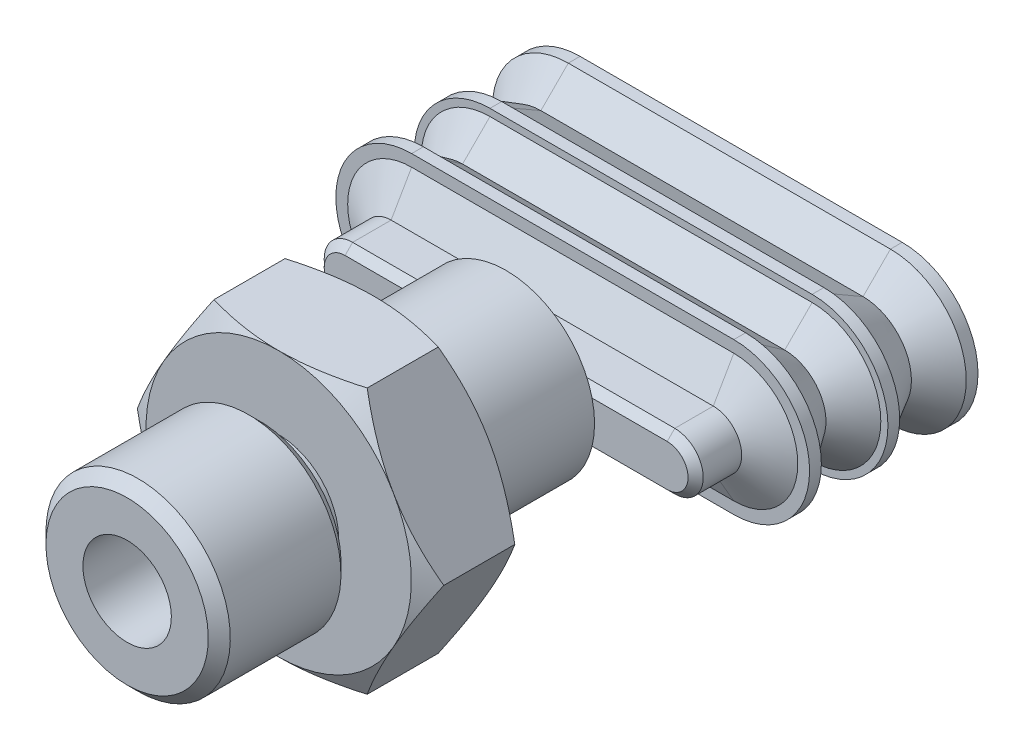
ISO-10303-21;
HEADER;
FILE_DESCRIPTION(('STEP AP214'),'2;1');
FILE_NAME('part.step','',(''),(''),'','','');
FILE_SCHEMA(('AUTOMOTIVE_DESIGN { 1 0 10303 214 1 1 1 1 }'));
ENDSEC;
DATA;
#1=APPLICATION_CONTEXT('core data for automotive mechanical design processes');
#2=APPLICATION_PROTOCOL_DEFINITION('international standard','automotive_design',2000,#1);
#3=PRODUCT_CONTEXT('',#1,'mechanical');
#4=PRODUCT('Part','Part','',(#3));
#5=PRODUCT_RELATED_PRODUCT_CATEGORY('part','',(#4));
#6=PRODUCT_DEFINITION_FORMATION('','',#4);
#7=PRODUCT_DEFINITION_CONTEXT('part definition',#1,'design');
#8=PRODUCT_DEFINITION('design','',#6,#7);
#9=PRODUCT_DEFINITION_SHAPE('','',#8);
#10=(LENGTH_UNIT() NAMED_UNIT(*) SI_UNIT(.MILLI.,.METRE.));
#11=(NAMED_UNIT(*) PLANE_ANGLE_UNIT() SI_UNIT($,.RADIAN.));
#12=(NAMED_UNIT(*) SI_UNIT($,.STERADIAN.) SOLID_ANGLE_UNIT());
#13=UNCERTAINTY_MEASURE_WITH_UNIT(LENGTH_MEASURE(1.E-05),#10,'distance_accuracy_value','');
#14=(GEOMETRIC_REPRESENTATION_CONTEXT(3) GLOBAL_UNCERTAINTY_ASSIGNED_CONTEXT((#13)) GLOBAL_UNIT_ASSIGNED_CONTEXT((#10,
#11,#12)) REPRESENTATION_CONTEXT('',''));
#15=CARTESIAN_POINT('',(0.,0.,0.));
#16=DIRECTION('',(0.,0.,1.));
#17=DIRECTION('',(1.,0.,0.));
#18=AXIS2_PLACEMENT_3D('',#15,#16,#17);
#19=CARTESIAN_POINT('',(0.,0.,2.35333333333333));
#20=DIRECTION('',(0.,0.,1.));
#21=DIRECTION('',(0.,1.,0.));
#22=AXIS2_PLACEMENT_3D('',#19,#20,#21);
#23=CYLINDRICAL_SURFACE('',#22,1.6);
#24=CARTESIAN_POINT('',(0.,0.,4.75333333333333));
#25=DIRECTION('',(0.,0.,1.));
#26=DIRECTION('',(-1.,0.,0.));
#27=AXIS2_PLACEMENT_3D('',#24,#25,#26);
#28=CIRCLE('',#27,1.6);
#29=CARTESIAN_POINT('',(1.28,-0.96,4.75333333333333));
#30=VERTEX_POINT('',#29);
#31=CARTESIAN_POINT('',(1.28,0.96,4.75333333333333));
#32=VERTEX_POINT('',#31);
#33=EDGE_CURVE('E1385',#30,#32,#28,.T.);
#34=ORIENTED_EDGE('',*,*,#33,.T.);
#35=DIRECTION('',(0.,0.,1.));
#36=VECTOR('',#35,1.);
#37=CARTESIAN_POINT('',(1.28,0.96,2.35333333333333));
#38=LINE('',#37,#36);
#39=CARTESIAN_POINT('',(1.28,0.96,2.35333333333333));
#40=VERTEX_POINT('',#39);
#41=EDGE_CURVE('E846',#40,#32,#38,.T.);
#42=ORIENTED_EDGE('',*,*,#41,.F.);
#43=CARTESIAN_POINT('',(0.,0.,2.35333333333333));
#44=DIRECTION('',(0.,0.,1.));
#45=DIRECTION('',(-1.,0.,0.));
#46=AXIS2_PLACEMENT_3D('',#43,#44,#45);
#47=CIRCLE('',#46,1.6);
#48=CARTESIAN_POINT('',(1.28,-0.96,2.35333333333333));
#49=VERTEX_POINT('',#48);
#50=EDGE_CURVE('E1529',#49,#40,#47,.T.);
#51=ORIENTED_EDGE('',*,*,#50,.F.);
#52=DIRECTION('',(0.,0.,1.));
#53=VECTOR('',#52,1.);
#54=CARTESIAN_POINT('',(1.28,-0.96,2.35333333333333));
#55=LINE('',#54,#53);
#56=EDGE_CURVE('E900',#49,#30,#55,.T.);
#57=ORIENTED_EDGE('',*,*,#56,.T.);
#58=EDGE_LOOP('',(#34,#42,#51,#57));
#59=FACE_BOUND('',#58,.T.);
#60=ADVANCED_FACE('F15',(#59),#23,.F.);
#61=CARTESIAN_POINT('',(-5.,0.96,2.35333333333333));
#62=DIRECTION('',(-1.,0.,0.));
#63=DIRECTION('',(0.,0.,1.));
#64=AXIS2_PLACEMENT_3D('',#61,#62,#63);
#65=PLANE('',#64);
#66=DIRECTION('',(0.,-1.,0.));
#67=VECTOR('',#66,1.);
#68=CARTESIAN_POINT('',(-5.,0.96,4.75333333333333));
#69=LINE('',#68,#67);
#70=CARTESIAN_POINT('',(-5.,0.96,4.75333333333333));
#71=VERTEX_POINT('',#70);
#72=CARTESIAN_POINT('',(-5.,-0.96,4.75333333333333));
#73=VERTEX_POINT('',#72);
#74=EDGE_CURVE('E937',#71,#73,#69,.T.);
#75=ORIENTED_EDGE('',*,*,#74,.F.);
#76=DIRECTION('',(0.,0.,1.));
#77=VECTOR('',#76,1.);
#78=CARTESIAN_POINT('',(-5.,0.96,2.35333333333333));
#79=LINE('',#78,#77);
#80=CARTESIAN_POINT('',(-5.,0.96,2.35333333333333));
#81=VERTEX_POINT('',#80);
#82=EDGE_CURVE('E1430',#81,#71,#79,.T.);
#83=ORIENTED_EDGE('',*,*,#82,.F.);
#84=DIRECTION('',(0.,-1.,0.));
#85=VECTOR('',#84,1.);
#86=CARTESIAN_POINT('',(-5.,0.96,2.35333333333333));
#87=LINE('',#86,#85);
#88=CARTESIAN_POINT('',(-5.,-0.96,2.35333333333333));
#89=VERTEX_POINT('',#88);
#90=EDGE_CURVE('E1266',#81,#89,#87,.T.);
#91=ORIENTED_EDGE('',*,*,#90,.T.);
#92=DIRECTION('',(0.,0.,1.));
#93=VECTOR('',#92,1.);
#94=CARTESIAN_POINT('',(-5.,-0.96,2.35333333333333));
#95=LINE('',#94,#93);
#96=EDGE_CURVE('E1463',#89,#73,#95,.T.);
#97=ORIENTED_EDGE('',*,*,#96,.T.);
#98=EDGE_LOOP('',(#75,#83,#91,#97));
#99=FACE_BOUND('',#98,.T.);
#100=ADVANCED_FACE('F1686',(#99),#65,.T.);
#101=CARTESIAN_POINT('',(-6.875,-0.96,2.35333333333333));
#102=DIRECTION('',(1.,0.,0.));
#103=DIRECTION('',(0.,1.,0.));
#104=AXIS2_PLACEMENT_3D('',#101,#102,#103);
#105=PLANE('',#104);
#106=DIRECTION('',(0.,1.,0.));
#107=VECTOR('',#106,1.);
#108=CARTESIAN_POINT('',(-6.875,-0.96,4.75333333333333));
#109=LINE('',#108,#107);
#110=CARTESIAN_POINT('',(-6.875,-0.96,4.75333333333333));
#111=VERTEX_POINT('',#110);
#112=CARTESIAN_POINT('',(-6.875,0.96,4.75333333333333));
#113=VERTEX_POINT('',#112);
#114=EDGE_CURVE('E940',#111,#113,#109,.T.);
#115=ORIENTED_EDGE('',*,*,#114,.F.);
#116=DIRECTION('',(0.,0.,1.));
#117=VECTOR('',#116,1.);
#118=CARTESIAN_POINT('',(-6.875,-0.96,2.35333333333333));
#119=LINE('',#118,#117);
#120=CARTESIAN_POINT('',(-6.875,-0.96,2.35333333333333));
#121=VERTEX_POINT('',#120);
#122=EDGE_CURVE('E1365',#121,#111,#119,.T.);
#123=ORIENTED_EDGE('',*,*,#122,.F.);
#124=DIRECTION('',(0.,1.,0.));
#125=VECTOR('',#124,1.);
#126=CARTESIAN_POINT('',(-6.875,-0.96,2.35333333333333));
#127=LINE('',#126,#125);
#128=CARTESIAN_POINT('',(-6.875,0.96,2.35333333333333));
#129=VERTEX_POINT('',#128);
#130=EDGE_CURVE('E819',#121,#129,#127,.T.);
#131=ORIENTED_EDGE('',*,*,#130,.T.);
#132=DIRECTION('',(0.,0.,1.));
#133=VECTOR('',#132,1.);
#134=CARTESIAN_POINT('',(-6.875,0.96,2.35333333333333));
#135=LINE('',#134,#133);
#136=EDGE_CURVE('E728',#129,#113,#135,.T.);
#137=ORIENTED_EDGE('',*,*,#136,.T.);
#138=EDGE_LOOP('',(#115,#123,#131,#137));
#139=FACE_BOUND('',#138,.T.);
#140=ADVANCED_FACE('F1692',(#139),#105,.T.);
#141=CARTESIAN_POINT('',(0.,0.,2.35333333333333));
#142=DIRECTION('',(0.,0.,1.));
#143=DIRECTION('',(0.,1.,0.));
#144=AXIS2_PLACEMENT_3D('',#141,#142,#143);
#145=CYLINDRICAL_SURFACE('',#144,1.6);
#146=CARTESIAN_POINT('',(0.,0.,4.75333333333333));
#147=DIRECTION('',(0.,0.,1.));
#148=DIRECTION('',(-1.,0.,0.));
#149=AXIS2_PLACEMENT_3D('',#146,#147,#148);
#150=CIRCLE('',#149,1.6);
#151=CARTESIAN_POINT('',(-1.28,0.96,4.75333333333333));
#152=VERTEX_POINT('',#151);
#153=CARTESIAN_POINT('',(-1.28,-0.96,4.75333333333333));
#154=VERTEX_POINT('',#153);
#155=EDGE_CURVE('E941',#152,#154,#150,.T.);
#156=ORIENTED_EDGE('',*,*,#155,.T.);
#157=DIRECTION('',(0.,0.,1.));
#158=VECTOR('',#157,1.);
#159=CARTESIAN_POINT('',(-1.28,-0.96,2.35333333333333));
#160=LINE('',#159,#158);
#161=CARTESIAN_POINT('',(-1.28,-0.96,2.35333333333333));
#162=VERTEX_POINT('',#161);
#163=EDGE_CURVE('E1296',#162,#154,#160,.T.);
#164=ORIENTED_EDGE('',*,*,#163,.F.);
#165=CARTESIAN_POINT('',(0.,0.,2.35333333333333));
#166=DIRECTION('',(0.,0.,1.));
#167=DIRECTION('',(-1.,0.,0.));
#168=AXIS2_PLACEMENT_3D('',#165,#166,#167);
#169=CIRCLE('',#168,1.6);
#170=CARTESIAN_POINT('',(-1.28,0.96,2.35333333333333));
#171=VERTEX_POINT('',#170);
#172=EDGE_CURVE('E1269',#171,#162,#169,.T.);
#173=ORIENTED_EDGE('',*,*,#172,.F.);
#174=DIRECTION('',(0.,0.,1.));
#175=VECTOR('',#174,1.);
#176=CARTESIAN_POINT('',(-1.28,0.96,2.35333333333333));
#177=LINE('',#176,#175);
#178=EDGE_CURVE('E1221',#171,#152,#177,.T.);
#179=ORIENTED_EDGE('',*,*,#178,.T.);
#180=EDGE_LOOP('',(#156,#164,#173,#179));
#181=FACE_BOUND('',#180,.T.);
#182=ADVANCED_FACE('F1707',(#181),#145,.F.);
#183=CARTESIAN_POINT('',(6.875,0.96,2.35333333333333));
#184=DIRECTION('',(-1.,0.,0.));
#185=DIRECTION('',(0.,0.,1.));
#186=AXIS2_PLACEMENT_3D('',#183,#184,#185);
#187=PLANE('',#186);
#188=DIRECTION('',(0.,-1.,0.));
#189=VECTOR('',#188,1.);
#190=CARTESIAN_POINT('',(6.875,0.96,4.75333333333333));
#191=LINE('',#190,#189);
#192=CARTESIAN_POINT('',(6.875,0.96,4.75333333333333));
#193=VERTEX_POINT('',#192);
#194=CARTESIAN_POINT('',(6.875,-0.96,4.75333333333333));
#195=VERTEX_POINT('',#194);
#196=EDGE_CURVE('E1265',#193,#195,#191,.T.);
#197=ORIENTED_EDGE('',*,*,#196,.F.);
#198=DIRECTION('',(0.,0.,1.));
#199=VECTOR('',#198,1.);
#200=CARTESIAN_POINT('',(6.875,0.96,2.35333333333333));
#201=LINE('',#200,#199);
#202=CARTESIAN_POINT('',(6.875,0.96,2.35333333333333));
#203=VERTEX_POINT('',#202);
#204=EDGE_CURVE('E1201',#203,#193,#201,.T.);
#205=ORIENTED_EDGE('',*,*,#204,.F.);
#206=DIRECTION('',(0.,-1.,0.));
#207=VECTOR('',#206,1.);
#208=CARTESIAN_POINT('',(6.875,0.96,2.35333333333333));
#209=LINE('',#208,#207);
#210=CARTESIAN_POINT('',(6.875,-0.96,2.35333333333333));
#211=VERTEX_POINT('',#210);
#212=EDGE_CURVE('E1433',#203,#211,#209,.T.);
#213=ORIENTED_EDGE('',*,*,#212,.T.);
#214=DIRECTION('',(0.,0.,1.));
#215=VECTOR('',#214,1.);
#216=CARTESIAN_POINT('',(6.875,-0.96,2.35333333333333));
#217=LINE('',#216,#215);
#218=EDGE_CURVE('E1177',#211,#195,#217,.T.);
#219=ORIENTED_EDGE('',*,*,#218,.T.);
#220=EDGE_LOOP('',(#197,#205,#213,#219));
#221=FACE_BOUND('',#220,.T.);
#222=ADVANCED_FACE('F1703',(#221),#187,.T.);
#223=CARTESIAN_POINT('',(5.,-0.96,2.35333333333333));
#224=DIRECTION('',(1.,0.,0.));
#225=DIRECTION('',(0.,1.,0.));
#226=AXIS2_PLACEMENT_3D('',#223,#224,#225);
#227=PLANE('',#226);
#228=DIRECTION('',(0.,1.,0.));
#229=VECTOR('',#228,1.);
#230=CARTESIAN_POINT('',(5.,-0.96,4.75333333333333));
#231=LINE('',#230,#229);
#232=CARTESIAN_POINT('',(5.,-0.96,4.75333333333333));
#233=VERTEX_POINT('',#232);
#234=CARTESIAN_POINT('',(5.,0.96,4.75333333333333));
#235=VERTEX_POINT('',#234);
#236=EDGE_CURVE('E1384',#233,#235,#231,.T.);
#237=ORIENTED_EDGE('',*,*,#236,.F.);
#238=DIRECTION('',(0.,0.,1.));
#239=VECTOR('',#238,1.);
#240=CARTESIAN_POINT('',(5.,-0.96,2.35333333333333));
#241=LINE('',#240,#239);
#242=CARTESIAN_POINT('',(5.,-0.96,2.35333333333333));
#243=VERTEX_POINT('',#242);
#244=EDGE_CURVE('E1196',#243,#233,#241,.T.);
#245=ORIENTED_EDGE('',*,*,#244,.F.);
#246=DIRECTION('',(0.,1.,0.));
#247=VECTOR('',#246,1.);
#248=CARTESIAN_POINT('',(5.,-0.96,2.35333333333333));
#249=LINE('',#248,#247);
#250=CARTESIAN_POINT('',(5.,0.96,2.35333333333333));
#251=VERTEX_POINT('',#250);
#252=EDGE_CURVE('E906',#243,#251,#249,.T.);
#253=ORIENTED_EDGE('',*,*,#252,.T.);
#254=DIRECTION('',(0.,0.,1.));
#255=VECTOR('',#254,1.);
#256=CARTESIAN_POINT('',(5.,0.96,2.35333333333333));
#257=LINE('',#256,#255);
#258=EDGE_CURVE('E845',#251,#235,#257,.T.);
#259=ORIENTED_EDGE('',*,*,#258,.T.);
#260=EDGE_LOOP('',(#237,#245,#253,#259));
#261=FACE_BOUND('',#260,.T.);
#262=ADVANCED_FACE('F1706',(#261),#227,.T.);
#263=CARTESIAN_POINT('',(-7.75,0.,2.35333333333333));
#264=DIRECTION('',(0.,0.,1.));
#265=DIRECTION('',(0.,1.,0.));
#266=AXIS2_PLACEMENT_3D('',#263,#264,#265);
#267=CYLINDRICAL_SURFACE('',#266,0.96);
#268=CARTESIAN_POINT('',(-7.75,0.,4.75333333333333));
#269=DIRECTION('',(0.,0.,1.));
#270=DIRECTION('',(-1.,0.,0.));
#271=AXIS2_PLACEMENT_3D('',#268,#269,#270);
#272=CIRCLE('',#271,0.96);
#273=CARTESIAN_POINT('',(-7.75,0.96,4.75333333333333));
#274=VERTEX_POINT('',#273);
#275=CARTESIAN_POINT('',(-7.75,-0.96,4.75333333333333));
#276=VERTEX_POINT('',#275);
#277=EDGE_CURVE('E1441',#274,#276,#272,.T.);
#278=ORIENTED_EDGE('',*,*,#277,.F.);
#279=DIRECTION('',(0.,0.,1.));
#280=VECTOR('',#279,1.);
#281=CARTESIAN_POINT('',(-7.75,0.96,2.35333333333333));
#282=LINE('',#281,#280);
#283=CARTESIAN_POINT('',(-7.75,0.96,2.35333333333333));
#284=VERTEX_POINT('',#283);
#285=EDGE_CURVE('E886',#284,#274,#282,.T.);
#286=ORIENTED_EDGE('',*,*,#285,.F.);
#287=CARTESIAN_POINT('',(-7.75,0.,2.35333333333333));
#288=DIRECTION('',(0.,0.,1.));
#289=DIRECTION('',(-1.,0.,0.));
#290=AXIS2_PLACEMENT_3D('',#287,#288,#289);
#291=CIRCLE('',#290,0.96);
#292=CARTESIAN_POINT('',(-7.75,-0.96,2.35333333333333));
#293=VERTEX_POINT('',#292);
#294=EDGE_CURVE('E822',#284,#293,#291,.T.);
#295=ORIENTED_EDGE('',*,*,#294,.T.);
#296=DIRECTION('',(0.,0.,1.));
#297=VECTOR('',#296,1.);
#298=CARTESIAN_POINT('',(-7.75,-0.96,2.35333333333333));
#299=LINE('',#298,#297);
#300=EDGE_CURVE('E896',#293,#276,#299,.T.);
#301=ORIENTED_EDGE('',*,*,#300,.T.);
#302=EDGE_LOOP('',(#278,#286,#295,#301));
#303=FACE_BOUND('',#302,.T.);
#304=ADVANCED_FACE('F2635',(#303),#267,.T.);
#305=CARTESIAN_POINT('',(7.75,0.,2.35333333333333));
#306=DIRECTION('',(0.,0.,1.));
#307=DIRECTION('',(0.,1.,0.));
#308=AXIS2_PLACEMENT_3D('',#305,#306,#307);
#309=CYLINDRICAL_SURFACE('',#308,0.96);
#310=CARTESIAN_POINT('',(7.75,0.,4.75333333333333));
#311=DIRECTION('',(0.,0.,1.));
#312=DIRECTION('',(-1.,0.,0.));
#313=AXIS2_PLACEMENT_3D('',#310,#311,#312);
#314=CIRCLE('',#313,0.96);
#315=CARTESIAN_POINT('',(7.75,-0.96,4.75333333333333));
#316=VERTEX_POINT('',#315);
#317=CARTESIAN_POINT('',(7.75,0.96,4.75333333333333));
#318=VERTEX_POINT('',#317);
#319=EDGE_CURVE('E1262',#316,#318,#314,.T.);
#320=ORIENTED_EDGE('',*,*,#319,.F.);
#321=DIRECTION('',(0.,0.,1.));
#322=VECTOR('',#321,1.);
#323=CARTESIAN_POINT('',(7.75,-0.96,2.35333333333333));
#324=LINE('',#323,#322);
#325=CARTESIAN_POINT('',(7.75,-0.96,2.35333333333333));
#326=VERTEX_POINT('',#325);
#327=EDGE_CURVE('E1176',#326,#316,#324,.T.);
#328=ORIENTED_EDGE('',*,*,#327,.F.);
#329=CARTESIAN_POINT('',(7.75,0.,2.35333333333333));
#330=DIRECTION('',(0.,0.,1.));
#331=DIRECTION('',(-1.,0.,0.));
#332=AXIS2_PLACEMENT_3D('',#329,#330,#331);
#333=CIRCLE('',#332,0.96);
#334=CARTESIAN_POINT('',(7.75,0.96,2.35333333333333));
#335=VERTEX_POINT('',#334);
#336=EDGE_CURVE('E823',#326,#335,#333,.T.);
#337=ORIENTED_EDGE('',*,*,#336,.T.);
#338=DIRECTION('',(0.,0.,1.));
#339=VECTOR('',#338,1.);
#340=CARTESIAN_POINT('',(7.75,0.96,2.35333333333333));
#341=LINE('',#340,#339);
#342=EDGE_CURVE('E911',#335,#318,#341,.T.);
#343=ORIENTED_EDGE('',*,*,#342,.T.);
#344=EDGE_LOOP('',(#320,#328,#337,#343));
#345=FACE_BOUND('',#344,.T.);
#346=ADVANCED_FACE('F2669',(#345),#309,.T.);
#347=CARTESIAN_POINT('',(-2.33333333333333,0.,22.4));
#348=DIRECTION('',(0.,0.,1.));
#349=DIRECTION('',(-1.,0.,0.));
#350=AXIS2_PLACEMENT_3D('',#347,#348,#349);
#351=PLANE('',#350);
#352=CARTESIAN_POINT('',(0.,0.,22.4));
#353=DIRECTION('',(0.,0.,-1.));
#354=DIRECTION('',(0.,-1.,0.));
#355=AXIS2_PLACEMENT_3D('',#352,#353,#354);
#356=CIRCLE('',#355,2.33333333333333);
#357=CARTESIAN_POINT('',(0.,-2.33333333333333,22.4));
#358=VERTEX_POINT('',#357);
#359=EDGE_CURVE('E10',#358,#358,#356,.T.);
#360=ORIENTED_EDGE('',*,*,#359,.F.);
#361=EDGE_LOOP('',(#360));
#362=FACE_BOUND('',#361,.T.);
#363=CARTESIAN_POINT('',(0.,0.,22.4));
#364=DIRECTION('',(0.,0.,1.));
#365=DIRECTION('',(0.,1.,0.));
#366=AXIS2_PLACEMENT_3D('',#363,#364,#365);
#367=CIRCLE('',#366,1.16666666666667);
#368=CARTESIAN_POINT('',(0.,1.16666666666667,22.4));
#369=VERTEX_POINT('',#368);
#370=EDGE_CURVE('E1097',#369,#369,#367,.T.);
#371=ORIENTED_EDGE('',*,*,#370,.F.);
#372=EDGE_LOOP('',(#371));
#373=FACE_BOUND('',#372,.T.);
#374=ADVANCED_FACE('F2674',(#362,#373),#351,.T.);
#375=CARTESIAN_POINT('',(0.,0.,22.4));
#376=DIRECTION('',(0.,0.,-1.));
#377=DIRECTION('',(0.,-1.,0.));
#378=AXIS2_PLACEMENT_3D('',#375,#376,#377);
#379=CYLINDRICAL_SURFACE('',#378,2.33333333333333);
#380=CARTESIAN_POINT('',(0.,0.,32.4));
#381=DIRECTION('',(0.,0.,-1.));
#382=DIRECTION('',(0.,-1.,0.));
#383=AXIS2_PLACEMENT_3D('',#380,#381,#382);
#384=CIRCLE('',#383,2.33333333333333);
#385=CARTESIAN_POINT('',(0.,-2.33333333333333,32.4));
#386=VERTEX_POINT('',#385);
#387=EDGE_CURVE('E865',#386,#386,#384,.T.);
#388=ORIENTED_EDGE('',*,*,#387,.F.);
#389=EDGE_LOOP('',(#388));
#390=FACE_BOUND('',#389,.T.);
#391=ORIENTED_EDGE('',*,*,#359,.T.);
#392=EDGE_LOOP('',(#391));
#393=FACE_BOUND('',#392,.T.);
#394=ADVANCED_FACE('F2148',(#390,#393),#379,.F.);
#395=CARTESIAN_POINT('',(0.,0.,24.4));
#396=DIRECTION('',(0.,0.,-1.));
#397=DIRECTION('',(0.,-1.,0.));
#398=AXIS2_PLACEMENT_3D('',#395,#396,#397);
#399=CONICAL_SURFACE('',#398,7.,1.04719755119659);
#400=CARTESIAN_POINT('',(6.06217782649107,3.50000000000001,24.4));
#401=CARTESIAN_POINT('',(5.97732774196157,3.64685865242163,24.4000591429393));
#402=CARTESIAN_POINT('',(5.8924433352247,3.79369469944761,24.3965268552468));
#403=CARTESIAN_POINT('',(5.72313210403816,4.08672138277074,24.3824159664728));
#404=CARTESIAN_POINT('',(5.63870466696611,4.2329126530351,24.3718579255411));
#405=CARTESIAN_POINT('',(5.4695898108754,4.52620130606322,24.3437068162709));
#406=CARTESIAN_POINT('',(5.38490671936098,4.67329523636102,24.3260522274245));
#407=CARTESIAN_POINT('',(5.21422739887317,4.96967618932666,24.2838325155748));
#408=CARTESIAN_POINT('',(5.12823851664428,5.11894870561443,24.2591370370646));
#409=CARTESIAN_POINT('',(4.96011312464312,5.41018289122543,24.204792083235));
#410=CARTESIAN_POINT('',(4.87796741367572,5.5521868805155,24.1753961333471));
#411=CARTESIAN_POINT('',(4.71311148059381,5.83725226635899,24.1108394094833));
#412=CARTESIAN_POINT('',(4.63040898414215,5.98030142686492,24.0756050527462));
#413=CARTESIAN_POINT('',(4.46398689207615,6.2682774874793,23.9994288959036));
#414=CARTESIAN_POINT('',(4.38027981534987,6.4131850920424,23.9583874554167));
#415=CARTESIAN_POINT('',(4.21141399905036,6.70559301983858,23.8706123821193));
#416=CARTESIAN_POINT('',(4.12627124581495,6.85306766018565,23.8237621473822));
#417=CARTESIAN_POINT('',(4.04145188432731,6.99999999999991,23.7747852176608));
#418=B_SPLINE_CURVE_WITH_KNOTS('',3,(#400,#401,#402,#403,#404,#405,#406,#407,#408,#409,#410,
#411,#412,#413,#414,#415,#416,#417),.UNSPECIFIED.,.F.,.F.,(4,2,2,2,2,2,2,2,4),(0.,
0.508782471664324,1.01608255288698,1.52787871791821,2.04984538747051,2.54974887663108,
3.05651334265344,3.57336423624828,4.10312902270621),.UNSPECIFIED.);
#419=CARTESIAN_POINT('',(6.06217782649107,3.5,24.4));
#420=VERTEX_POINT('',#419);
#421=CARTESIAN_POINT('',(4.04145188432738,7.,23.7747852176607));
#422=VERTEX_POINT('',#421);
#423=EDGE_CURVE('E2121',#420,#422,#418,.T.);
#424=ORIENTED_EDGE('',*,*,#423,.T.);
#425=CARTESIAN_POINT('',(4.04145188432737,7.00000000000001,23.7747852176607));
#426=CARTESIAN_POINT('',(3.87216566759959,6.9999901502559,23.823654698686));
#427=CARTESIAN_POINT('',(3.70225279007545,6.99997503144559,23.8704136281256));
#428=CARTESIAN_POINT('',(3.36538368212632,6.9999707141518,23.9580261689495));
#429=CARTESIAN_POINT('',(3.19845785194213,6.99998088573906,23.9989969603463));
#430=CARTESIAN_POINT('',(2.86674530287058,7.00005883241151,24.0750515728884));
#431=CARTESIAN_POINT('',(2.70198180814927,7.00012546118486,24.1102360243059));
#432=CARTESIAN_POINT('',(2.37367962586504,7.00030668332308,24.1747138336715));
#433=CARTESIAN_POINT('',(2.2101557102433,7.00042059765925,24.2040822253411));
#434=CARTESIAN_POINT('',(1.87409302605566,7.00038714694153,24.2585356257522));
#435=CARTESIAN_POINT('',(1.70150802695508,7.00022659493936,24.2833373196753));
#436=CARTESIAN_POINT('',(1.35877998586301,6.99989024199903,24.3257397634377));
#437=CARTESIAN_POINT('',(1.18865291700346,6.99971478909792,24.3434684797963));
#438=CARTESIAN_POINT('',(0.84921223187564,6.99960001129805,24.3717406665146));
#439=CARTESIAN_POINT('',(0.679903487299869,6.99965874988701,24.3823422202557));
#440=CARTESIAN_POINT('',(0.340397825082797,6.99983193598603,24.3965141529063));
#441=CARTESIAN_POINT('',(0.17019987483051,6.99994657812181,24.4000597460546));
#442=CARTESIAN_POINT('',(0.,7.,24.4));
#443=B_SPLINE_CURVE_WITH_KNOTS('',3,(#425,#426,#427,#428,#429,#430,#431,#432,#433,#434,#435,
#436,#437,#438,#439,#440,#441,#442),.UNSPECIFIED.,.F.,.F.,(4,2,2,2,2,2,2,2,4),(0.,
0.528607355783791,1.0441807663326,1.54953004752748,2.04786057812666,2.57081184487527,
3.08381851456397,3.59259200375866,4.10314954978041),.UNSPECIFIED.);
#444=CARTESIAN_POINT('',(0.,7.,24.4));
#445=VERTEX_POINT('',#444);
#446=EDGE_CURVE('E2117',#422,#445,#443,.T.);
#447=ORIENTED_EDGE('',*,*,#446,.T.);
#448=CARTESIAN_POINT('',(0.,0.,24.4));
#449=DIRECTION('',(0.,0.,-1.));
#450=DIRECTION('',(0.,-1.,0.));
#451=AXIS2_PLACEMENT_3D('',#448,#449,#450);
#452=CIRCLE('',#451,7.);
#453=EDGE_CURVE('E28',#445,#420,#452,.T.);
#454=ORIENTED_EDGE('',*,*,#453,.T.);
#455=EDGE_LOOP('',(#424,#447,#454));
#456=FACE_BOUND('',#455,.T.);
#457=ADVANCED_FACE('F2138',(#456),#399,.T.);
#458=CARTESIAN_POINT('',(-3.1616,0.,24.4));
#459=DIRECTION('',(0.,0.,-1.));
#460=DIRECTION('',(0.,-1.,0.));
#461=AXIS2_PLACEMENT_3D('',#458,#459,#460);
#462=PLANE('',#461);
#463=CARTESIAN_POINT('',(0.,0.,24.4));
#464=DIRECTION('',(0.,0.,-1.));
#465=DIRECTION('',(0.,-1.,0.));
#466=AXIS2_PLACEMENT_3D('',#463,#464,#465);
#467=CIRCLE('',#466,3.1616);
#468=CARTESIAN_POINT('',(0.,-3.1616,24.4));
#469=VERTEX_POINT('',#468);
#470=EDGE_CURVE('E1162',#469,#469,#467,.T.);
#471=ORIENTED_EDGE('',*,*,#470,.T.);
#472=EDGE_LOOP('',(#471));
#473=FACE_BOUND('',#472,.T.);
#474=CARTESIAN_POINT('',(0.,0.,24.4));
#475=DIRECTION('',(0.,0.,-1.));
#476=DIRECTION('',(0.,-1.,0.));
#477=AXIS2_PLACEMENT_3D('',#474,#475,#476);
#478=CIRCLE('',#477,7.);
#479=CARTESIAN_POINT('',(-6.06217782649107,-3.5,24.4));
#480=VERTEX_POINT('',#479);
#481=CARTESIAN_POINT('',(-6.06217782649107,3.5,24.4));
#482=VERTEX_POINT('',#481);
#483=EDGE_CURVE('E610',#480,#482,#478,.T.);
#484=ORIENTED_EDGE('',*,*,#483,.F.);
#485=CARTESIAN_POINT('',(0.,0.,24.4));
#486=DIRECTION('',(0.,0.,-1.));
#487=DIRECTION('',(0.,-1.,0.));
#488=AXIS2_PLACEMENT_3D('',#485,#486,#487);
#489=CIRCLE('',#488,7.);
#490=CARTESIAN_POINT('',(0.,-7.,24.4));
#491=VERTEX_POINT('',#490);
#492=EDGE_CURVE('E2000',#491,#480,#489,.T.);
#493=ORIENTED_EDGE('',*,*,#492,.F.);
#494=CARTESIAN_POINT('',(0.,0.,24.4));
#495=DIRECTION('',(0.,0.,-1.));
#496=DIRECTION('',(0.,-1.,0.));
#497=AXIS2_PLACEMENT_3D('',#494,#495,#496);
#498=CIRCLE('',#497,7.);
#499=CARTESIAN_POINT('',(6.06217782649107,-3.5,24.4));
#500=VERTEX_POINT('',#499);
#501=EDGE_CURVE('E2002',#500,#491,#498,.T.);
#502=ORIENTED_EDGE('',*,*,#501,.F.);
#503=CARTESIAN_POINT('',(0.,0.,24.4));
#504=DIRECTION('',(0.,0.,-1.));
#505=DIRECTION('',(0.,-1.,0.));
#506=AXIS2_PLACEMENT_3D('',#503,#504,#505);
#507=CIRCLE('',#506,7.);
#508=EDGE_CURVE('E2006',#420,#500,#507,.T.);
#509=ORIENTED_EDGE('',*,*,#508,.F.);
#510=ORIENTED_EDGE('',*,*,#453,.F.);
#511=CARTESIAN_POINT('',(0.,0.,24.4));
#512=DIRECTION('',(0.,0.,-1.));
#513=DIRECTION('',(0.,-1.,0.));
#514=AXIS2_PLACEMENT_3D('',#511,#512,#513);
#515=CIRCLE('',#514,7.);
#516=EDGE_CURVE('E1165',#482,#445,#515,.T.);
#517=ORIENTED_EDGE('',*,*,#516,.F.);
#518=EDGE_LOOP('',(#484,#493,#502,#509,#510,#517));
#519=FACE_BOUND('',#518,.T.);
#520=ADVANCED_FACE('F2050',(#473,#519),#462,.F.);
#521=CARTESIAN_POINT('',(0.,0.,24.4));
#522=DIRECTION('',(0.,0.,-1.));
#523=DIRECTION('',(0.,-1.,0.));
#524=AXIS2_PLACEMENT_3D('',#521,#522,#523);
#525=CONICAL_SURFACE('',#524,7.,1.04719755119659);
#526=ORIENTED_EDGE('',*,*,#483,.T.);
#527=CARTESIAN_POINT('',(-6.06217782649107,3.5,24.4));
#528=CARTESIAN_POINT('',(-6.14693610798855,3.35308834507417,24.4000591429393));
#529=CARTESIAN_POINT('',(-6.23165765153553,3.20615826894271,24.3965268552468));
#530=CARTESIAN_POINT('',(-6.40077058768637,2.91301709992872,24.3824159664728));
#531=CARTESIAN_POINT('',(-6.48516222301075,2.76680515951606,24.3718579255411));
#532=CARTESIAN_POINT('',(-6.65460021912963,2.47370307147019,24.3437068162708));
#533=CARTESIAN_POINT('',(-6.73964575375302,2.32681839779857,24.3260522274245));
#534=CARTESIAN_POINT('',(-6.91097952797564,2.03081529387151,24.2838325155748));
#535=CARTESIAN_POINT('',(-6.99725887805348,1.88171047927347,24.2591370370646));
#536=CARTESIAN_POINT('',(-7.16541238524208,1.59049252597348,24.2047920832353));
#537=CARTESIAN_POINT('',(-7.24731859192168,1.44835025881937,24.1753961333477));
#538=CARTESIAN_POINT('',(-7.41176449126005,1.16304813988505,24.1108394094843));
#539=CARTESIAN_POINT('',(-7.49429745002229,1.01990109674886,24.0756050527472));
#540=CARTESIAN_POINT('',(-7.66048098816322,0.731787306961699,23.9994288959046));
#541=CARTESIAN_POINT('',(-7.74412111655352,0.586841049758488,23.9583874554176));
#542=CARTESIAN_POINT('',(-7.91292090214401,0.294394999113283,23.8706123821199));
#543=CARTESIAN_POINT('',(-7.99806631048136,0.146921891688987,23.8237621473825));
#544=CARTESIAN_POINT('',(-8.08290376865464,0.,23.7747852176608));
#545=B_SPLINE_CURVE_WITH_KNOTS('',3,(#527,#528,#529,#530,#531,#532,#533,#534,#535,#536,#537,
#538,#539,#540,#541,#542,#543,#544),.UNSPECIFIED.,.F.,.F.,(4,2,2,2,2,2,2,2,4),(0.,
0.508782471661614,1.01608255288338,1.5278787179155,2.04984538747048,2.54974887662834,
3.05651334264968,3.57336423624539,4.1031290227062),.UNSPECIFIED.);
#546=CARTESIAN_POINT('',(-8.08290376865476,0.,23.7747852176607));
#547=VERTEX_POINT('',#546);
#548=EDGE_CURVE('E2068',#482,#547,#545,.T.);
#549=ORIENTED_EDGE('',*,*,#548,.T.);
#550=CARTESIAN_POINT('',(-8.08290376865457,0.,23.7747852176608));
#551=CARTESIAN_POINT('',(-7.99806360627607,-0.14692747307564,23.8237635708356));
#552=CARTESIAN_POINT('',(-7.91290738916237,-0.294400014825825,23.8706200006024));
#553=CARTESIAN_POINT('',(-7.74409607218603,-0.586805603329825,23.9584030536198));
#554=CARTESIAN_POINT('',(-7.66045557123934,-0.731711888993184,23.9994471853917));
#555=CARTESIAN_POINT('',(-7.49428850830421,-1.01971164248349,24.0756240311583));
#556=CARTESIAN_POINT('',(-7.41177255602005,-1.1627844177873,24.1108574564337));
#557=CARTESIAN_POINT('',(-7.24738166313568,-1.44790693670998,24.1754092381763));
#558=CARTESIAN_POINT('',(-7.16551353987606,-1.5899436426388,24.204802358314));
#559=CARTESIAN_POINT('',(-6.99743173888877,-1.88100360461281,24.2591457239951));
#560=CARTESIAN_POINT('',(-6.91118665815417,-2.03005677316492,24.2838404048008));
#561=CARTESIAN_POINT('',(-6.73990304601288,-2.32603439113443,24.3260596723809));
#562=CARTESIAN_POINT('',(-6.65487283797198,-2.47294528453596,24.3437119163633));
#563=CARTESIAN_POINT('',(-6.48542937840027,-2.76616683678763,24.3718619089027));
#564=CARTESIAN_POINT('',(-6.40101689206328,-2.91247229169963,24.3824180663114));
#565=CARTESIAN_POINT('',(-6.23181231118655,-3.20585997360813,24.3965286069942));
#566=CARTESIAN_POINT('',(-6.14701989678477,-3.3529431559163,24.4000592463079));
#567=CARTESIAN_POINT('',(-6.06217782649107,-3.5,24.4));
#568=B_SPLINE_CURVE_WITH_KNOTS('',3,(#550,#551,#552,#553,#554,#555,#556,#557,#558,#559,#560,
#561,#562,#563,#564,#565,#566,#567),.UNSPECIFIED.,.F.,.F.,(4,2,2,2,2,2,2,2,4),(0.,
0.52978402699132,1.0465366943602,1.55308704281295,2.05266281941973,2.57444501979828,
3.08628486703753,3.59385834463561,4.10314436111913),.UNSPECIFIED.);
#569=EDGE_CURVE('E2028',#547,#480,#568,.T.);
#570=ORIENTED_EDGE('',*,*,#569,.T.);
#571=EDGE_LOOP('',(#526,#549,#570));
#572=FACE_BOUND('',#571,.T.);
#573=ADVANCED_FACE('F1984',(#572),#525,.T.);
#574=CARTESIAN_POINT('',(0.,0.,24.4));
#575=DIRECTION('',(0.,0.,-1.));
#576=DIRECTION('',(0.,-1.,0.));
#577=AXIS2_PLACEMENT_3D('',#574,#575,#576);
#578=CONICAL_SURFACE('',#577,7.,1.04719755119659);
#579=ORIENTED_EDGE('',*,*,#492,.T.);
#580=CARTESIAN_POINT('',(-6.06217782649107,-3.5,24.4));
#581=CARTESIAN_POINT('',(-5.9773277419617,-3.6468586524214,24.4000591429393));
#582=CARTESIAN_POINT('',(-5.89244333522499,-3.79369469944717,24.3965268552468));
#583=CARTESIAN_POINT('',(-5.72313210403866,-4.08672138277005,24.3824159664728));
#584=CARTESIAN_POINT('',(-5.63870466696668,-4.23291265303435,24.3718579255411));
#585=CARTESIAN_POINT('',(-5.46958981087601,-4.5262013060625,24.3437068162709));
#586=CARTESIAN_POINT('',(-5.38490671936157,-4.67329523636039,24.3260522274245));
#587=CARTESIAN_POINT('',(-5.21422739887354,-4.96967618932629,24.2838325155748));
#588=CARTESIAN_POINT('',(-5.12823851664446,-5.11894870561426,24.2591370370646));
#589=CARTESIAN_POINT('',(-4.96011312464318,-5.41018289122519,24.2047920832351));
#590=CARTESIAN_POINT('',(-4.87796741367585,-5.55218688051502,24.1753961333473));
#591=CARTESIAN_POINT('',(-4.71311148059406,-5.83725226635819,24.1108394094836));
#592=CARTESIAN_POINT('',(-4.63040898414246,-5.98030142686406,24.0756050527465));
#593=CARTESIAN_POINT('',(-4.4639868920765,-6.26827748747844,23.9994288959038));
#594=CARTESIAN_POINT('',(-4.38027981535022,-6.41318509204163,23.958387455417));
#595=CARTESIAN_POINT('',(-4.21141399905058,-6.70559301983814,23.8706123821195));
#596=CARTESIAN_POINT('',(-4.12627124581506,-6.85306766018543,23.8237621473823));
#597=CARTESIAN_POINT('',(-4.04145188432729,-6.99999999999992,23.7747852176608));
#598=B_SPLINE_CURVE_WITH_KNOTS('',3,(#580,#581,#582,#583,#584,#585,#586,#587,#588,#589,#590,
#591,#592,#593,#594,#595,#596,#597),.UNSPECIFIED.,.F.,.F.,(4,2,2,2,2,2,2,2,4),(0.,
0.508782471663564,1.01608255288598,1.52787871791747,2.04984538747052,2.54974887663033,
3.0565133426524,3.57336423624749,4.10312902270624),.UNSPECIFIED.);
#599=CARTESIAN_POINT('',(-4.04145188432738,-7.,23.7747852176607));
#600=VERTEX_POINT('',#599);
#601=EDGE_CURVE('E1998',#480,#600,#598,.T.);
#602=ORIENTED_EDGE('',*,*,#601,.T.);
#603=CARTESIAN_POINT('',(-4.04145188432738,-7.,23.7747852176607));
#604=CARTESIAN_POINT('',(-3.87216566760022,-6.99999015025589,23.8236546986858));
#605=CARTESIAN_POINT('',(-3.70225279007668,-6.99997503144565,23.8704136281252));
#606=CARTESIAN_POINT('',(-3.36538368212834,-6.99997071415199,23.9580261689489));
#607=CARTESIAN_POINT('',(-3.19845785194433,-6.99998088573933,23.9989969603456));
#608=CARTESIAN_POINT('',(-2.86674530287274,-7.00005883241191,24.0750515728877));
#609=CARTESIAN_POINT('',(-2.70198180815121,-7.00012546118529,24.1102360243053));
#610=CARTESIAN_POINT('',(-2.37367962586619,-7.0003066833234,24.1747138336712));
#611=CARTESIAN_POINT('',(-2.21015571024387,-7.00042059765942,24.2040822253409));
#612=CARTESIAN_POINT('',(-1.87409302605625,-7.00038714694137,24.2585356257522));
#613=CARTESIAN_POINT('',(-1.70150802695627,-7.00022659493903,24.2833373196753));
#614=CARTESIAN_POINT('',(-1.35877998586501,-6.99989024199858,24.3257397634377));
#615=CARTESIAN_POINT('',(-1.18865291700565,-6.9997147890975,24.3434684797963));
#616=CARTESIAN_POINT('',(-0.849212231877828,-6.99960001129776,24.3717406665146));
#617=CARTESIAN_POINT('',(-0.679903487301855,-6.99965874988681,24.3823422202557));
#618=CARTESIAN_POINT('',(-0.340397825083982,-6.99983193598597,24.3965141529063));
#619=CARTESIAN_POINT('',(-0.170199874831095,-6.99994657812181,24.4000597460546));
#620=CARTESIAN_POINT('',(0.,-7.,24.4));
#621=B_SPLINE_CURVE_WITH_KNOTS('',3,(#603,#604,#605,#606,#607,#608,#609,#610,#611,#612,#613,
#614,#615,#616,#617,#618,#619,#620),.UNSPECIFIED.,.F.,.F.,(4,2,2,2,2,2,2,2,4),(0.,
0.528607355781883,1.04418076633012,1.54953004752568,2.04786057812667,2.5708118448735,
3.08381851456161,3.5925920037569,4.10314954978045),.UNSPECIFIED.);
#622=EDGE_CURVE('E1971',#600,#491,#621,.T.);
#623=ORIENTED_EDGE('',*,*,#622,.T.);
#624=EDGE_LOOP('',(#579,#602,#623));
#625=FACE_BOUND('',#624,.T.);
#626=ADVANCED_FACE('F1759',(#625),#578,.T.);
#627=CARTESIAN_POINT('',(0.,0.,24.4));
#628=DIRECTION('',(0.,0.,-1.));
#629=DIRECTION('',(0.,-1.,0.));
#630=AXIS2_PLACEMENT_3D('',#627,#628,#629);
#631=CONICAL_SURFACE('',#630,7.,1.04719755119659);
#632=ORIENTED_EDGE('',*,*,#501,.T.);
#633=CARTESIAN_POINT('',(0.,-7.,24.4));
#634=CARTESIAN_POINT('',(0.170186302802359,-6.99994661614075,24.400059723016));
#635=CARTESIAN_POINT('',(0.340370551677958,-6.99983662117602,24.3965120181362));
#636=CARTESIAN_POINT('',(0.679874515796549,-6.99967657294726,24.3823337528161));
#637=CARTESIAN_POINT('',(0.849195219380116,-6.99962632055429,24.3717269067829));
#638=CARTESIAN_POINT('',(1.18868657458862,-6.99975681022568,24.3434418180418));
#639=CARTESIAN_POINT('',(1.3588522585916,-6.99993951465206,24.3257043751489));
#640=CARTESIAN_POINT('',(1.70168562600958,-7.00028104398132,24.2832834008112));
#641=CARTESIAN_POINT('',(1.87433720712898,-7.0004393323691,24.2584708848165));
#642=CARTESIAN_POINT('',(2.21044341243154,-7.00046230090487,24.2040089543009));
#643=CARTESIAN_POINT('',(2.37394475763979,-7.00034059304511,24.1746458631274));
#644=CARTESIAN_POINT('',(2.70219967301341,-7.00014695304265,24.1101788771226));
#645=CARTESIAN_POINT('',(2.86693848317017,-7.00007574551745,24.0750000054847));
#646=CARTESIAN_POINT('',(3.19859946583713,-6.99998989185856,23.9989579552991));
#647=CARTESIAN_POINT('',(3.36549843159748,-6.99997641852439,23.9579942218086));
#648=CARTESIAN_POINT('',(3.70231135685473,-6.99997612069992,23.8703969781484));
#649=CARTESIAN_POINT('',(3.87219493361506,-6.99998997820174,23.8236463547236));
#650=CARTESIAN_POINT('',(4.04145188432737,-7.00000000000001,23.7747852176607));
#651=B_SPLINE_CURVE_WITH_KNOTS('',3,(#633,#634,#635,#636,#637,#638,#639,#640,#641,#642,#643,
#644,#645,#646,#647,#648,#649,#650),.UNSPECIFIED.,.F.,.F.,(4,2,2,2,2,2,2,2,4),(0.,
0.510516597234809,1.01932676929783,1.53245146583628,2.05560510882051,2.55386624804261,
3.05913960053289,3.5746297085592,4.10314572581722),.UNSPECIFIED.);
#652=CARTESIAN_POINT('',(4.04145188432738,-7.,23.7747852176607));
#653=VERTEX_POINT('',#652);
#654=EDGE_CURVE('E1788',#491,#653,#651,.T.);
#655=ORIENTED_EDGE('',*,*,#654,.T.);
#656=CARTESIAN_POINT('',(4.04145188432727,-6.99999999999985,23.7747852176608));
#657=CARTESIAN_POINT('',(4.12627472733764,-6.85306252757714,23.8237635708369));
#658=CARTESIAN_POINT('',(4.21141158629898,-6.70557880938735,23.870620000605));
#659=CARTESIAN_POINT('',(4.38023659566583,-6.41318112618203,23.9584030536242));
#660=CARTESIAN_POINT('',(4.46390886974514,-6.26829318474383,23.9994471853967));
#661=CARTESIAN_POINT('',(4.63024044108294,-5.9803884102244,24.0756240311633));
#662=CARTESIAN_POINT('',(4.71288712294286,-5.83739111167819,24.1108574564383));
#663=CARTESIAN_POINT('',(4.8776150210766,-5.55246316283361,24.1754092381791));
#664=CARTESIAN_POINT('',(4.9596883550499,-5.41054493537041,24.2048023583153));
#665=CARTESIAN_POINT('',(5.12771277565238,-5.11945184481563,24.2591457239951));
#666=CARTESIAN_POINT('',(5.21367406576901,-4.97023482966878,24.2838404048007));
#667=CARTESIAN_POINT('',(5.38435639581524,-4.67391006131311,24.3260596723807));
#668=CARTESIAN_POINT('',(5.46906985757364,-4.52681629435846,24.3437119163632));
#669=CARTESIAN_POINT('',(5.63828544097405,-4.23346317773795,24.3718619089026));
#670=CARTESIAN_POINT('',(5.72278343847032,-4.08720709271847,24.3824180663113));
#671=CARTESIAN_POINT('',(5.89226233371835,-3.79397778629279,24.3965286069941));
#672=CARTESIAN_POINT('',(5.97724389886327,-3.64700381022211,24.4000592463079));
#673=CARTESIAN_POINT('',(6.06217782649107,-3.50000000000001,24.4));
#674=B_SPLINE_CURVE_WITH_KNOTS('',3,(#656,#657,#658,#659,#660,#661,#662,#663,#664,#665,#666,
#667,#668,#669,#670,#671,#672,#673),.UNSPECIFIED.,.F.,.F.,(4,2,2,2,2,2,2,2,4),(0.,
0.529784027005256,1.04653669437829,1.55308704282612,2.05266281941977,2.57444501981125,
3.08628486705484,3.59385834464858,4.10314436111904),.UNSPECIFIED.);
#675=EDGE_CURVE('E1779',#653,#500,#674,.T.);
#676=ORIENTED_EDGE('',*,*,#675,.T.);
#677=EDGE_LOOP('',(#632,#655,#676));
#678=FACE_BOUND('',#677,.T.);
#679=ADVANCED_FACE('F987',(#678),#631,.T.);
#680=CARTESIAN_POINT('',(0.,0.,24.4));
#681=DIRECTION('',(0.,0.,-1.));
#682=DIRECTION('',(0.,-1.,0.));
#683=AXIS2_PLACEMENT_3D('',#680,#681,#682);
#684=CONICAL_SURFACE('',#683,7.,1.04719755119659);
#685=ORIENTED_EDGE('',*,*,#508,.T.);
#686=CARTESIAN_POINT('',(6.06217782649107,-3.50000000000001,24.4));
#687=CARTESIAN_POINT('',(6.14693610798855,-3.35308834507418,24.4000591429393));
#688=CARTESIAN_POINT('',(6.23165765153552,-3.20615826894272,24.3965268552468));
#689=CARTESIAN_POINT('',(6.40077058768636,-2.91301709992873,24.3824159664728));
#690=CARTESIAN_POINT('',(6.48516222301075,-2.76680515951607,24.3718579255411));
#691=CARTESIAN_POINT('',(6.65460021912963,-2.4737030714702,24.3437068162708));
#692=CARTESIAN_POINT('',(6.73964575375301,-2.32681839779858,24.3260522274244));
#693=CARTESIAN_POINT('',(6.91097952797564,-2.03081529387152,24.2838325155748));
#694=CARTESIAN_POINT('',(6.99725887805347,-1.88171047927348,24.2591370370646));
#695=CARTESIAN_POINT('',(7.16541238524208,-1.59049252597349,24.2047920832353));
#696=CARTESIAN_POINT('',(7.24731859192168,-1.44835025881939,24.1753961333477));
#697=CARTESIAN_POINT('',(7.41176449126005,-1.16304813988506,24.1108394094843));
#698=CARTESIAN_POINT('',(7.49429745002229,-1.01990109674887,24.0756050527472));
#699=CARTESIAN_POINT('',(7.66048098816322,-0.731787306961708,23.9994288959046));
#700=CARTESIAN_POINT('',(7.74412111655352,-0.586841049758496,23.9583874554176));
#701=CARTESIAN_POINT('',(7.912920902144,-0.294394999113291,23.8706123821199));
#702=CARTESIAN_POINT('',(7.99806631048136,-0.146921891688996,23.8237621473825));
#703=CARTESIAN_POINT('',(8.08290376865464,0.,23.7747852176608));
#704=B_SPLINE_CURVE_WITH_KNOTS('',3,(#686,#687,#688,#689,#690,#691,#692,#693,#694,#695,#696,
#697,#698,#699,#700,#701,#702,#703),.UNSPECIFIED.,.F.,.F.,(4,2,2,2,2,2,2,2,4),(0.,
0.508782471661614,1.01608255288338,1.5278787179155,2.04984538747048,2.54974887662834,
3.05651334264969,3.57336423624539,4.10312902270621),.UNSPECIFIED.);
#705=CARTESIAN_POINT('',(8.08290376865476,0.,23.7747852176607));
#706=VERTEX_POINT('',#705);
#707=EDGE_CURVE('E1009',#500,#706,#704,.T.);
#708=ORIENTED_EDGE('',*,*,#707,.T.);
#709=CARTESIAN_POINT('',(8.08290376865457,0.,23.7747852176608));
#710=CARTESIAN_POINT('',(7.99806360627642,0.14692747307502,23.8237635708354));
#711=CARTESIAN_POINT('',(7.91290738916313,0.294400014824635,23.870620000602));
#712=CARTESIAN_POINT('',(7.74409607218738,0.586805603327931,23.9584030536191));
#713=CARTESIAN_POINT('',(7.66045557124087,0.731711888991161,23.999447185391));
#714=CARTESIAN_POINT('',(7.49428850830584,1.01971164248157,24.0756240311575));
#715=CARTESIAN_POINT('',(7.4117725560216,1.16278441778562,24.1108574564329));
#716=CARTESIAN_POINT('',(7.24738166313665,1.44790693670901,24.1754092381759));
#717=CARTESIAN_POINT('',(7.16551353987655,1.58994364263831,24.2048023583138));
#718=CARTESIAN_POINT('',(6.99743173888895,1.88100360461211,24.2591457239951));
#719=CARTESIAN_POINT('',(6.91118665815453,2.03005677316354,24.2838404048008));
#720=CARTESIAN_POINT('',(6.73990304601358,2.32603439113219,24.326059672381));
#721=CARTESIAN_POINT('',(6.65487283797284,2.47294528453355,24.3437119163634));
#722=CARTESIAN_POINT('',(6.48542937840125,2.76616683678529,24.3718619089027));
#723=CARTESIAN_POINT('',(6.40101689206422,2.91247229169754,24.3824180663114));
#724=CARTESIAN_POINT('',(6.23181231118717,3.20585997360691,24.3965286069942));
#725=CARTESIAN_POINT('',(6.1470198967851,3.35294315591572,24.4000592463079));
#726=CARTESIAN_POINT('',(6.06217782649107,3.50000000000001,24.4));
#727=B_SPLINE_CURVE_WITH_KNOTS('',3,(#709,#710,#711,#712,#713,#714,#715,#716,#717,#718,#719,
#720,#721,#722,#723,#724,#725,#726),.UNSPECIFIED.,.F.,.F.,(4,2,2,2,2,2,2,2,4),(0.,
0.529784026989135,1.04653669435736,1.55308704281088,2.05266281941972,2.57444501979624,
3.08628486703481,3.59385834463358,4.10314436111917),.UNSPECIFIED.);
#728=EDGE_CURVE('E866',#706,#420,#727,.T.);
#729=ORIENTED_EDGE('',*,*,#728,.T.);
#730=EDGE_LOOP('',(#685,#708,#729));
#731=FACE_BOUND('',#730,.T.);
#732=ADVANCED_FACE('F976',(#731),#684,.T.);
#733=CARTESIAN_POINT('',(0.,0.,24.4));
#734=DIRECTION('',(0.,0.,-1.));
#735=DIRECTION('',(0.,-1.,0.));
#736=AXIS2_PLACEMENT_3D('',#733,#734,#735);
#737=CONICAL_SURFACE('',#736,7.,1.04719755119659);
#738=CARTESIAN_POINT('',(0.,7.,24.4));
#739=CARTESIAN_POINT('',(-0.170186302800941,6.99994661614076,24.400059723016));
#740=CARTESIAN_POINT('',(-0.340370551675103,6.99983662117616,24.3965120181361));
#741=CARTESIAN_POINT('',(-0.679874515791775,6.99967657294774,24.382333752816));
#742=CARTESIAN_POINT('',(-0.849195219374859,6.99962632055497,24.3717269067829));
#743=CARTESIAN_POINT('',(-1.18868657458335,6.99975681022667,24.3434418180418));
#744=CARTESIAN_POINT('',(-1.35885225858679,6.99993951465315,24.3257043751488));
#745=CARTESIAN_POINT('',(-1.70168562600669,7.00028104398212,24.2832834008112));
#746=CARTESIAN_POINT('',(-1.87433720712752,7.00043933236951,24.2584708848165));
#747=CARTESIAN_POINT('',(-2.21044341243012,7.0004623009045,24.2040089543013));
#748=CARTESIAN_POINT('',(-2.37394475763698,7.00034059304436,24.1746458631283));
#749=CARTESIAN_POINT('',(-2.70219967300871,7.00014695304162,24.1101788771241));
#750=CARTESIAN_POINT('',(-2.86693848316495,7.00007574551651,24.0750000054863));
#751=CARTESIAN_POINT('',(-3.19859946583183,6.9999898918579,23.9989579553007));
#752=CARTESIAN_POINT('',(-3.36549843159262,6.99997641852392,23.9579942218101));
#753=CARTESIAN_POINT('',(-3.70231135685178,6.99997612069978,23.8703969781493));
#754=CARTESIAN_POINT('',(-3.87219493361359,6.99998997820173,23.8236463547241));
#755=CARTESIAN_POINT('',(-4.04145188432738,7.,23.7747852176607));
#756=B_SPLINE_CURVE_WITH_KNOTS('',3,(#738,#739,#740,#741,#742,#743,#744,#745,#746,#747,#748,
#749,#750,#751,#752,#753,#754,#755),.UNSPECIFIED.,.F.,.F.,(4,2,2,2,2,2,2,2,4),(0.,
0.510516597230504,1.01932676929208,1.53245146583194,2.05560510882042,2.55386624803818,
3.05913960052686,3.57462970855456,4.1031457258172),.UNSPECIFIED.);
#757=CARTESIAN_POINT('',(-4.04145188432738,7.,23.7747852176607));
#758=VERTEX_POINT('',#757);
#759=EDGE_CURVE('E624',#445,#758,#756,.T.);
#760=ORIENTED_EDGE('',*,*,#759,.T.);
#761=CARTESIAN_POINT('',(-4.04145188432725,6.99999999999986,23.7747852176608));
#762=CARTESIAN_POINT('',(-4.12627472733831,6.85306252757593,23.8237635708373));
#763=CARTESIAN_POINT('',(-4.21141158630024,6.70557880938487,23.8706200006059));
#764=CARTESIAN_POINT('',(-4.38023659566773,6.41318112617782,23.9584030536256));
#765=CARTESIAN_POINT('',(-4.46390886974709,6.26829318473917,23.9994471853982));
#766=CARTESIAN_POINT('',(-4.63024044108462,5.98038841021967,24.0756240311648));
#767=CARTESIAN_POINT('',(-4.71288712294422,5.83739111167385,24.1108574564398));
#768=CARTESIAN_POINT('',(-4.8776150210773,5.55246316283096,24.17540923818));
#769=CARTESIAN_POINT('',(-4.95968835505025,5.41054493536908,24.2048023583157));
#770=CARTESIAN_POINT('',(-5.1277127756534,5.11945184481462,24.2591457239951));
#771=CARTESIAN_POINT('',(-5.21367406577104,4.97023482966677,24.2838404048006));
#772=CARTESIAN_POINT('',(-5.38435639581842,4.67391006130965,24.3260596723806));
#773=CARTESIAN_POINT('',(-5.46906985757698,4.52681629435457,24.3437119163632));
#774=CARTESIAN_POINT('',(-5.63828544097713,4.23346317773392,24.3718619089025));
#775=CARTESIAN_POINT('',(-5.72278343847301,4.08720709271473,24.3824180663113));
#776=CARTESIAN_POINT('',(-5.89226233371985,3.79397778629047,24.3965286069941));
#777=CARTESIAN_POINT('',(-5.97724389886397,3.64700381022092,24.4000592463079));
#778=CARTESIAN_POINT('',(-6.06217782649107,3.5,24.4));
#779=B_SPLINE_CURVE_WITH_KNOTS('',3,(#761,#762,#763,#764,#765,#766,#767,#768,#769,#770,#771,
#772,#773,#774,#775,#776,#777,#778),.UNSPECIFIED.,.F.,.F.,(4,2,2,2,2,2,2,2,4),(0.,
0.529784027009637,1.04653669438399,1.5530870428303,2.05266281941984,2.57444501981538,
3.08628486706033,3.59385834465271,4.10314436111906),.UNSPECIFIED.);
#780=EDGE_CURVE('E2069',#758,#482,#779,.T.);
#781=ORIENTED_EDGE('',*,*,#780,.T.);
#782=ORIENTED_EDGE('',*,*,#516,.T.);
#783=EDGE_LOOP('',(#760,#781,#782));
#784=FACE_BOUND('',#783,.T.);
#785=ADVANCED_FACE('F986',(#784),#737,.T.);
#786=CARTESIAN_POINT('',(0.,0.,12.4));
#787=DIRECTION('',(0.,0.,-1.));
#788=DIRECTION('',(0.,-1.,0.));
#789=AXIS2_PLACEMENT_3D('',#786,#787,#788);
#790=CYLINDRICAL_SURFACE('',#789,3.1616);
#791=CARTESIAN_POINT('',(0.,0.,25.4));
#792=DIRECTION('',(0.,0.,-1.));
#793=DIRECTION('',(0.,-1.,0.));
#794=AXIS2_PLACEMENT_3D('',#791,#792,#793);
#795=CIRCLE('',#794,3.1616);
#796=CARTESIAN_POINT('',(0.,-3.1616,25.4));
#797=VERTEX_POINT('',#796);
#798=EDGE_CURVE('E1166',#797,#797,#795,.T.);
#799=ORIENTED_EDGE('',*,*,#798,.T.);
#800=EDGE_LOOP('',(#799));
#801=FACE_BOUND('',#800,.T.);
#802=ORIENTED_EDGE('',*,*,#470,.F.);
#803=EDGE_LOOP('',(#802));
#804=FACE_BOUND('',#803,.T.);
#805=ADVANCED_FACE('F1682',(#801,#804),#790,.T.);
#806=CARTESIAN_POINT('',(-4.283,0.,25.4));
#807=DIRECTION('',(0.,0.,1.));
#808=DIRECTION('',(-1.,0.,0.));
#809=AXIS2_PLACEMENT_3D('',#806,#807,#808);
#810=PLANE('',#809);
#811=CARTESIAN_POINT('',(0.,0.,25.4));
#812=DIRECTION('',(0.,0.,-1.));
#813=DIRECTION('',(0.,-1.,0.));
#814=AXIS2_PLACEMENT_3D('',#811,#812,#813);
#815=CIRCLE('',#814,4.283);
#816=CARTESIAN_POINT('',(0.,-4.283,25.4));
#817=VERTEX_POINT('',#816);
#818=EDGE_CURVE('E1213',#817,#817,#815,.T.);
#819=ORIENTED_EDGE('',*,*,#818,.T.);
#820=EDGE_LOOP('',(#819));
#821=FACE_BOUND('',#820,.T.);
#822=ORIENTED_EDGE('',*,*,#798,.F.);
#823=EDGE_LOOP('',(#822));
#824=FACE_BOUND('',#823,.T.);
#825=ADVANCED_FACE('F1667',(#821,#824),#810,.F.);
#826=CARTESIAN_POINT('',(0.,0.,25.981));
#827=DIRECTION('',(0.,0.,1.));
#828=DIRECTION('',(0.,1.,0.));
#829=AXIS2_PLACEMENT_3D('',#826,#827,#828);
#830=CONICAL_SURFACE('',#829,4.864,0.78539816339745);
#831=CARTESIAN_POINT('',(0.,0.,25.981));
#832=DIRECTION('',(0.,0.,-1.));
#833=DIRECTION('',(0.,-1.,0.));
#834=AXIS2_PLACEMENT_3D('',#831,#832,#833);
#835=CIRCLE('',#834,4.864);
#836=CARTESIAN_POINT('',(0.,-4.864,25.981));
#837=VERTEX_POINT('',#836);
#838=EDGE_CURVE('E1352',#837,#837,#835,.T.);
#839=ORIENTED_EDGE('',*,*,#838,.T.);
#840=EDGE_LOOP('',(#839));
#841=FACE_BOUND('',#840,.T.);
#842=ORIENTED_EDGE('',*,*,#818,.F.);
#843=EDGE_LOOP('',(#842));
#844=FACE_BOUND('',#843,.T.);
#845=ADVANCED_FACE('F1670',(#841,#844),#830,.T.);
#846=CARTESIAN_POINT('',(0.,0.,12.4));
#847=DIRECTION('',(0.,0.,-1.));
#848=DIRECTION('',(0.,-1.,0.));
#849=AXIS2_PLACEMENT_3D('',#846,#847,#848);
#850=CYLINDRICAL_SURFACE('',#849,4.864);
#851=CARTESIAN_POINT('',(0.,0.,31.819));
#852=DIRECTION('',(0.,0.,-1.));
#853=DIRECTION('',(0.,-1.,0.));
#854=AXIS2_PLACEMENT_3D('',#851,#852,#853);
#855=CIRCLE('',#854,4.864);
#856=CARTESIAN_POINT('',(0.,-4.864,31.819));
#857=VERTEX_POINT('',#856);
#858=EDGE_CURVE('E926',#857,#857,#855,.T.);
#859=ORIENTED_EDGE('',*,*,#858,.T.);
#860=EDGE_LOOP('',(#859));
#861=FACE_BOUND('',#860,.T.);
#862=ORIENTED_EDGE('',*,*,#838,.F.);
#863=EDGE_LOOP('',(#862));
#864=FACE_BOUND('',#863,.T.);
#865=ADVANCED_FACE('F1672',(#861,#864),#850,.T.);
#866=CARTESIAN_POINT('',(0.,0.,32.4));
#867=DIRECTION('',(0.,0.,-1.));
#868=DIRECTION('',(0.,-1.,0.));
#869=AXIS2_PLACEMENT_3D('',#866,#867,#868);
#870=CONICAL_SURFACE('',#869,4.283,0.785398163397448);
#871=CARTESIAN_POINT('',(0.,0.,32.4));
#872=DIRECTION('',(0.,0.,-1.));
#873=DIRECTION('',(0.,-1.,0.));
#874=AXIS2_PLACEMENT_3D('',#871,#872,#873);
#875=CIRCLE('',#874,4.283);
#876=CARTESIAN_POINT('',(0.,-4.283,32.4));
#877=VERTEX_POINT('',#876);
#878=EDGE_CURVE('E862',#877,#877,#875,.T.);
#879=ORIENTED_EDGE('',*,*,#878,.T.);
#880=EDGE_LOOP('',(#879));
#881=FACE_BOUND('',#880,.T.);
#882=ORIENTED_EDGE('',*,*,#858,.F.);
#883=EDGE_LOOP('',(#882));
#884=FACE_BOUND('',#883,.T.);
#885=ADVANCED_FACE('F1679',(#881,#884),#870,.T.);
#886=CARTESIAN_POINT('',(0.,0.,32.4));
#887=DIRECTION('',(0.,0.,-1.));
#888=DIRECTION('',(0.,-1.,0.));
#889=AXIS2_PLACEMENT_3D('',#886,#887,#888);
#890=PLANE('',#889);
#891=ORIENTED_EDGE('',*,*,#387,.T.);
#892=EDGE_LOOP('',(#891));
#893=FACE_BOUND('',#892,.T.);
#894=ORIENTED_EDGE('',*,*,#878,.F.);
#895=EDGE_LOOP('',(#894));
#896=FACE_BOUND('',#895,.T.);
#897=ADVANCED_FACE('F2714',(#893,#896),#890,.F.);
#898=CARTESIAN_POINT('',(8.08290376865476,0.,24.4));
#899=DIRECTION('',(-0.866025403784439,-0.5,0.));
#900=DIRECTION('',(0.,0.,-1.));
#901=AXIS2_PLACEMENT_3D('',#898,#899,#900);
#902=PLANE('',#901);
#903=DIRECTION('',(0.,0.,-1.));
#904=VECTOR('',#903,1.);
#905=CARTESIAN_POINT('',(8.08290376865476,0.,24.4));
#906=LINE('',#905,#904);
#907=CARTESIAN_POINT('',(8.08290376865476,0.,20.0252147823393));
#908=VERTEX_POINT('',#907);
#909=EDGE_CURVE('E1095',#706,#908,#906,.T.);
#910=ORIENTED_EDGE('',*,*,#909,.T.);
#911=CARTESIAN_POINT('',(6.06217782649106,3.5,19.4));
#912=CARTESIAN_POINT('',(6.14693610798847,3.3530883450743,19.3999408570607));
#913=CARTESIAN_POINT('',(6.23165765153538,3.20615826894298,19.4034731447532));
#914=CARTESIAN_POINT('',(6.40077058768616,2.91301709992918,19.4175840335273));
#915=CARTESIAN_POINT('',(6.48516222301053,2.76680515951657,19.4281420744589));
#916=CARTESIAN_POINT('',(6.65460021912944,2.47370307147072,19.4562931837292));
#917=CARTESIAN_POINT('',(6.73964575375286,2.32681839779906,19.4739477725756));
#918=CARTESIAN_POINT('',(6.91097952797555,2.03081529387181,19.5161674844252));
#919=CARTESIAN_POINT('',(6.99725887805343,1.88171047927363,19.5408629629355));
#920=CARTESIAN_POINT('',(7.16541238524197,1.59049252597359,19.5952079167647));
#921=CARTESIAN_POINT('',(7.24731859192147,1.44835025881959,19.6246038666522));
#922=CARTESIAN_POINT('',(7.41176449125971,1.1630481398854,19.6891605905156));
#923=CARTESIAN_POINT('',(7.49429745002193,1.01990109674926,19.7243949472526));
#924=CARTESIAN_POINT('',(7.66048098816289,0.731787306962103,19.8005711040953));
#925=CARTESIAN_POINT('',(7.74412111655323,0.586841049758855,19.8416125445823));
#926=CARTESIAN_POINT('',(7.91292090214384,0.294394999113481,19.92938761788));
#927=CARTESIAN_POINT('',(7.99806631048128,0.146921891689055,19.9762378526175));
#928=CARTESIAN_POINT('',(8.08290376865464,0.,20.0252147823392));
#929=B_SPLINE_CURVE_WITH_KNOTS('',3,(#911,#912,#913,#914,#915,#916,#917,#918,#919,#920,#921,
#922,#923,#924,#925,#926,#927,#928),.UNSPECIFIED.,.F.,.F.,(4,2,2,2,2,2,2,2,4),(0.,
0.508782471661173,1.01608255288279,1.52787871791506,2.04984538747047,2.5497488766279,
3.0565133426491,3.57336423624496,4.10312902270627),.UNSPECIFIED.);
#930=CARTESIAN_POINT('',(6.06217782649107,3.5,19.4));
#931=VERTEX_POINT('',#930);
#932=EDGE_CURVE('E1089',#931,#908,#929,.T.);
#933=ORIENTED_EDGE('',*,*,#932,.F.);
#934=CARTESIAN_POINT('',(4.04145188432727,6.99999999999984,20.0252147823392));
#935=CARTESIAN_POINT('',(4.12627472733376,6.85306252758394,19.9762364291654));
#936=CARTESIAN_POINT('',(4.21141158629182,6.70557880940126,19.9293799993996));
#937=CARTESIAN_POINT('',(4.38023659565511,6.4131811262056,19.8415969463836));
#938=CARTESIAN_POINT('',(4.46390886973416,6.26829318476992,19.800552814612));
#939=CARTESIAN_POINT('',(4.6302404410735,5.98038841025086,19.7243759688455));
#940=CARTESIAN_POINT('',(4.71288712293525,5.83739111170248,19.6891425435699));
#941=CARTESIAN_POINT('',(4.8776150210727,5.55246316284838,19.6245907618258));
#942=CARTESIAN_POINT('',(4.95968835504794,5.41054493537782,19.595197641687));
#943=CARTESIAN_POINT('',(5.12771277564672,5.11945184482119,19.540854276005));
#944=CARTESIAN_POINT('',(5.21367406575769,4.97023482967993,19.5161595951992));
#945=CARTESIAN_POINT('',(5.38435639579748,4.67391006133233,19.4739403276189));
#946=CARTESIAN_POINT('',(5.46906985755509,4.52681629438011,19.4562880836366));
#947=CARTESIAN_POINT('',(5.63828544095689,4.23346317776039,19.4281380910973));
#948=CARTESIAN_POINT('',(5.72278343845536,4.08720709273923,19.4175819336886));
#949=CARTESIAN_POINT('',(5.89226233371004,3.79397778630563,19.4034713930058));
#950=CARTESIAN_POINT('',(5.9772438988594,3.64700381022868,19.3999407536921));
#951=CARTESIAN_POINT('',(6.06217782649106,3.5,19.4));
#952=B_SPLINE_CURVE_WITH_KNOTS('',3,(#934,#935,#936,#937,#938,#939,#940,#941,#942,#943,#944,
#945,#946,#947,#948,#949,#950,#951),.UNSPECIFIED.,.F.,.F.,(4,2,2,2,2,2,2,2,4),(0.,
0.529784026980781,1.04653669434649,1.55308704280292,2.05266281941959,2.57444501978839,
3.08628486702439,3.59385834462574,4.10314436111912),.UNSPECIFIED.);
#953=CARTESIAN_POINT('',(4.04145188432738,7.,20.0252147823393));
#954=VERTEX_POINT('',#953);
#955=EDGE_CURVE('E1092',#954,#931,#952,.T.);
#956=ORIENTED_EDGE('',*,*,#955,.F.);
#957=DIRECTION('',(0.,0.,-1.));
#958=VECTOR('',#957,1.);
#959=CARTESIAN_POINT('',(4.04145188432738,7.,24.4));
#960=LINE('',#959,#958);
#961=EDGE_CURVE('E2076',#422,#954,#960,.T.);
#962=ORIENTED_EDGE('',*,*,#961,.F.);
#963=ORIENTED_EDGE('',*,*,#423,.F.);
#964=ORIENTED_EDGE('',*,*,#728,.F.);
#965=EDGE_LOOP('',(#910,#933,#956,#962,#963,#964));
#966=FACE_BOUND('',#965,.T.);
#967=ADVANCED_FACE('F1090',(#966),#902,.F.);
#968=CARTESIAN_POINT('',(4.04145188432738,7.,24.4));
#969=DIRECTION('',(0.,-1.,0.));
#970=DIRECTION('',(0.,0.,-1.));
#971=AXIS2_PLACEMENT_3D('',#968,#969,#970);
#972=PLANE('',#971);
#973=ORIENTED_EDGE('',*,*,#961,.T.);
#974=CARTESIAN_POINT('',(0.,6.99999999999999,19.4));
#975=CARTESIAN_POINT('',(0.170186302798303,6.99994661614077,19.399940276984));
#976=CARTESIAN_POINT('',(0.340370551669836,6.99983662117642,19.4034879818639));
#977=CARTESIAN_POINT('',(0.679874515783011,6.99967657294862,19.417666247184));
#978=CARTESIAN_POINT('',(0.849195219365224,6.99962632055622,19.4282730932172));
#979=CARTESIAN_POINT('',(1.18868657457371,6.99975681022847,19.4565581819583));
#980=CARTESIAN_POINT('',(1.35885225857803,6.99993951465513,19.4742956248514));
#981=CARTESIAN_POINT('',(1.70168562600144,7.00028104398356,19.5167165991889));
#982=CARTESIAN_POINT('',(1.87433720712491,7.00043933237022,19.5415291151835));
#983=CARTESIAN_POINT('',(2.2104434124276,7.00046230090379,19.5959910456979));
#984=CARTESIAN_POINT('',(2.37394475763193,7.00034059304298,19.6253541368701));
#985=CARTESIAN_POINT('',(2.70219967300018,7.00014695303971,19.6898211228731));
#986=CARTESIAN_POINT('',(2.86693848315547,7.00007574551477,19.7249999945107));
#987=CARTESIAN_POINT('',(3.19859946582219,6.99998989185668,19.8010420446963));
#988=CARTESIAN_POINT('',(3.36549843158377,6.99997641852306,19.8420057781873));
#989=CARTESIAN_POINT('',(3.70231135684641,6.99997612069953,19.9296030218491));
#990=CARTESIAN_POINT('',(3.87219493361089,6.99998997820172,19.9763536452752));
#991=CARTESIAN_POINT('',(4.04145188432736,7.00000000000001,20.0252147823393));
#992=B_SPLINE_CURVE_WITH_KNOTS('',3,(#974,#975,#976,#977,#978,#979,#980,#981,#982,#983,#984,
#985,#986,#987,#988,#989,#990,#991),.UNSPECIFIED.,.F.,.F.,(4,2,2,2,2,2,2,2,4),(0.,
0.510516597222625,1.0193267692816,1.53245146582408,2.05560510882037,2.55386624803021,
3.05913960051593,3.57462970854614,4.10314572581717),.UNSPECIFIED.);
#993=CARTESIAN_POINT('',(0.,7.,19.4));
#994=VERTEX_POINT('',#993);
#995=EDGE_CURVE('E3381',#994,#954,#992,.T.);
#996=ORIENTED_EDGE('',*,*,#995,.F.);
#997=CARTESIAN_POINT('',(-4.04145188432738,7.,20.0252147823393));
#998=CARTESIAN_POINT('',(-3.872165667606,6.99999015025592,19.9763453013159));
#999=CARTESIAN_POINT('',(-3.70225279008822,6.9999750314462,19.9295863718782));
#1000=CARTESIAN_POINT('',(-3.36538368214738,6.99997071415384,19.8419738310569));
#1001=CARTESIAN_POINT('',(-3.19845785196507,6.99998088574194,19.8010030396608));
#1002=CARTESIAN_POINT('',(-2.86674530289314,7.00005883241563,19.7249484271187));
#1003=CARTESIAN_POINT('',(-2.70198180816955,7.00012546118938,19.6897639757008));
#1004=CARTESIAN_POINT('',(-2.37367962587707,7.00030668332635,19.6252861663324));
#1005=CARTESIAN_POINT('',(-2.21015571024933,7.0004205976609,19.5959177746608));
#1006=CARTESIAN_POINT('',(-1.8740930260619,7.0003871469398,19.5414643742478));
#1007=CARTESIAN_POINT('',(-1.7015080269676,7.0002265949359,19.5166626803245));
#1008=CARTESIAN_POINT('',(-1.35877998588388,6.9998902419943,19.474260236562));
#1009=CARTESIAN_POINT('',(-1.18865291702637,6.99971478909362,19.4565315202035));
#1010=CARTESIAN_POINT('',(-0.849212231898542,6.99960001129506,19.4282593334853));
#1011=CARTESIAN_POINT('',(-0.679903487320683,6.99965874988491,19.4176577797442));
#1012=CARTESIAN_POINT('',(-0.340397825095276,6.99983193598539,19.4034858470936));
#1013=CARTESIAN_POINT('',(-0.170199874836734,6.99994657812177,19.3999402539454));
#1014=CARTESIAN_POINT('',(0.,6.99999999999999,19.4));
#1015=B_SPLINE_CURVE_WITH_KNOTS('',3,(#997,#998,#999,#1000,#1001,#1002,#1003,#1004,#1005,#1006,
#1007,#1008,#1009,#1010,#1011,#1012,#1013,#1014),.UNSPECIFIED.,.F.,.F.,(4,2,2,2,2,2,2,2,4),(0.,
0.528607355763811,1.04418076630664,1.54953004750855,2.04786057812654,2.57081184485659,
3.08381851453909,3.59259200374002,4.1031495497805),.UNSPECIFIED.);
#1016=CARTESIAN_POINT('',(-4.04145188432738,7.,20.0252147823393));
#1017=VERTEX_POINT('',#1016);
#1018=EDGE_CURVE('E818',#1017,#994,#1015,.T.);
#1019=ORIENTED_EDGE('',*,*,#1018,.F.);
#1020=DIRECTION('',(0.,0.,-1.));
#1021=VECTOR('',#1020,1.);
#1022=CARTESIAN_POINT('',(-4.04145188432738,7.,24.4));
#1023=LINE('',#1022,#1021);
#1024=EDGE_CURVE('E2073',#758,#1017,#1023,.T.);
#1025=ORIENTED_EDGE('',*,*,#1024,.F.);
#1026=ORIENTED_EDGE('',*,*,#759,.F.);
#1027=ORIENTED_EDGE('',*,*,#446,.F.);
#1028=EDGE_LOOP('',(#973,#996,#1019,#1025,#1026,#1027));
#1029=FACE_BOUND('',#1028,.T.);
#1030=ADVANCED_FACE('F2115',(#1029),#972,.F.);
#1031=CARTESIAN_POINT('',(-4.04145188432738,7.,24.4));
#1032=DIRECTION('',(0.866025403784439,-0.5,0.));
#1033=DIRECTION('',(0.5,0.866025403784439,0.));
#1034=AXIS2_PLACEMENT_3D('',#1031,#1032,#1033);
#1035=PLANE('',#1034);
#1036=ORIENTED_EDGE('',*,*,#1024,.T.);
#1037=CARTESIAN_POINT('',(-6.06217782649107,3.49999999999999,19.4));
#1038=CARTESIAN_POINT('',(-5.977327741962,3.64685865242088,19.3999408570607));
#1039=CARTESIAN_POINT('',(-5.89244333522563,3.79369469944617,19.4034731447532));
#1040=CARTESIAN_POINT('',(-5.72313210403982,4.08672138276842,19.4175840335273));
#1041=CARTESIAN_POINT('',(-5.63870466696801,4.2329126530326,19.4281420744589));
#1042=CARTESIAN_POINT('',(-5.46958981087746,4.52620130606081,19.4562931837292));
#1043=CARTESIAN_POINT('',(-5.38490671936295,4.67329523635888,19.4739477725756));
#1044=CARTESIAN_POINT('',(-5.21422739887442,4.96967618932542,19.5161674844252));
#1045=CARTESIAN_POINT('',(-5.1282385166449,5.11894870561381,19.5408629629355));
#1046=CARTESIAN_POINT('',(-4.96011312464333,5.41018289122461,19.5952079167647));
#1047=CARTESIAN_POINT('',(-4.87796741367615,5.55218688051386,19.6246038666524));
#1048=CARTESIAN_POINT('',(-4.71311148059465,5.83725226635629,19.6891605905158));
#1049=CARTESIAN_POINT('',(-4.6304089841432,5.98030142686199,19.7243949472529));
#1050=CARTESIAN_POINT('',(-4.46398689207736,6.2682774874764,19.8005711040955));
#1051=CARTESIAN_POINT('',(-4.38027981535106,6.41318509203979,19.8416125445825));
#1052=CARTESIAN_POINT('',(-4.21141399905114,6.70559301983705,19.9293876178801));
#1053=CARTESIAN_POINT('',(-4.12627124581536,6.8530676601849,19.9762378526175));
#1054=CARTESIAN_POINT('',(-4.04145188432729,6.99999999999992,20.0252147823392));
#1055=B_SPLINE_CURVE_WITH_KNOTS('',3,(#1037,#1038,#1039,#1040,#1041,#1042,#1043,#1044,#1045,
#1046,#1047,#1048,#1049,#1050,#1051,#1052,#1053,#1054),.UNSPECIFIED.,.F.,.F.,(4,2,2,2,2,2,2,2,
4),(0.,0.508782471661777,1.0160825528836,1.52787871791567,2.04984538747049,2.54974887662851,
3.05651334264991,3.57336423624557,4.10312902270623),.UNSPECIFIED.);
#1056=CARTESIAN_POINT('',(-6.06217782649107,3.5,19.4));
#1057=VERTEX_POINT('',#1056);
#1058=EDGE_CURVE('E2301',#1057,#1017,#1055,.T.);
#1059=ORIENTED_EDGE('',*,*,#1058,.F.);
#1060=CARTESIAN_POINT('',(-8.08290376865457,0.,20.0252147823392));
#1061=CARTESIAN_POINT('',(-7.99806360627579,0.146927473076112,19.9762364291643));
#1062=CARTESIAN_POINT('',(-7.91290738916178,0.294400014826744,19.9293799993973));
#1063=CARTESIAN_POINT('',(-7.74409607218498,0.586805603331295,19.8415969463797));
#1064=CARTESIAN_POINT('',(-7.66045557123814,0.731711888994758,19.8005528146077));
#1065=CARTESIAN_POINT('',(-7.49428850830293,1.01971164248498,19.7243759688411));
#1066=CARTESIAN_POINT('',(-7.41177255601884,1.1627844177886,19.6891425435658));
#1067=CARTESIAN_POINT('',(-7.24738166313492,1.44790693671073,19.6245907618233));
#1068=CARTESIAN_POINT('',(-7.16551353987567,1.58994364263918,19.5951976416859));
#1069=CARTESIAN_POINT('',(-6.99743173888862,1.88100360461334,19.540854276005));
#1070=CARTESIAN_POINT('',(-6.91118665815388,2.03005677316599,19.5161595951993));
#1071=CARTESIAN_POINT('',(-6.73990304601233,2.32603439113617,19.4739403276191));
#1072=CARTESIAN_POINT('',(-6.65487283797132,2.47294528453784,19.4562880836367));
#1073=CARTESIAN_POINT('',(-6.48542937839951,2.76616683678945,19.4281380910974));
#1074=CARTESIAN_POINT('',(-6.40101689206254,2.91247229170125,19.4175819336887));
#1075=CARTESIAN_POINT('',(-6.23181231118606,3.20585997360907,19.4034713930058));
#1076=CARTESIAN_POINT('',(-6.1470198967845,3.35294315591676,19.3999407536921));
#1077=CARTESIAN_POINT('',(-6.06217782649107,3.49999999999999,19.4));
#1078=B_SPLINE_CURVE_WITH_KNOTS('',3,(#1060,#1061,#1062,#1063,#1064,#1065,#1066,#1067,#1068,
#1069,#1070,#1071,#1072,#1073,#1074,#1075,#1076,#1077),.UNSPECIFIED.,.F.,.F.,(4,2,2,2,2,2,2,2,
4),(0.,0.52978402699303,1.04653669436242,1.55308704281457,2.05266281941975,2.57444501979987,
3.08628486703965,3.5938583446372,4.10314436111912),.UNSPECIFIED.);
#1079=CARTESIAN_POINT('',(-8.08290376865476,0.,20.0252147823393));
#1080=VERTEX_POINT('',#1079);
#1081=EDGE_CURVE('E2294',#1080,#1057,#1078,.T.);
#1082=ORIENTED_EDGE('',*,*,#1081,.F.);
#1083=DIRECTION('',(0.,0.,-1.));
#1084=VECTOR('',#1083,1.);
#1085=CARTESIAN_POINT('',(-8.08290376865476,0.,24.4));
#1086=LINE('',#1085,#1084);
#1087=EDGE_CURVE('E2017',#547,#1080,#1086,.T.);
#1088=ORIENTED_EDGE('',*,*,#1087,.F.);
#1089=ORIENTED_EDGE('',*,*,#548,.F.);
#1090=ORIENTED_EDGE('',*,*,#780,.F.);
#1091=EDGE_LOOP('',(#1036,#1059,#1082,#1088,#1089,#1090));
#1092=FACE_BOUND('',#1091,.T.);
#1093=ADVANCED_FACE('F1939',(#1092),#1035,.F.);
#1094=CARTESIAN_POINT('',(-8.08290376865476,0.,24.4));
#1095=DIRECTION('',(0.866025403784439,0.5,0.));
#1096=DIRECTION('',(0.,0.,1.));
#1097=AXIS2_PLACEMENT_3D('',#1094,#1095,#1096);
#1098=PLANE('',#1097);
#1099=ORIENTED_EDGE('',*,*,#1087,.T.);
#1100=CARTESIAN_POINT('',(-6.06217782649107,-3.49999999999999,19.4));
#1101=CARTESIAN_POINT('',(-6.14693610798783,-3.35308834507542,19.3999408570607));
#1102=CARTESIAN_POINT('',(-6.2316576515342,-3.20615826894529,19.4034731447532));
#1103=CARTESIAN_POINT('',(-6.40077058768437,-2.91301709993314,19.4175840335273));
#1104=CARTESIAN_POINT('',(-6.48516222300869,-2.766805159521,19.428142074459));
#1105=CARTESIAN_POINT('',(-6.65460021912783,-2.47370307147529,19.4562931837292));
#1106=CARTESIAN_POINT('',(-6.73964575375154,-2.32681839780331,19.4739477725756));
#1107=CARTESIAN_POINT('',(-6.91097952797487,-2.03081529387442,19.5161674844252));
#1108=CARTESIAN_POINT('',(-6.99725887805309,-1.88171047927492,19.5408629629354));
#1109=CARTESIAN_POINT('',(-7.16541238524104,-1.5904925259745,19.5952079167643));
#1110=CARTESIAN_POINT('',(-7.24731859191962,-1.44835025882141,19.6246038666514));
#1111=CARTESIAN_POINT('',(-7.41176449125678,-1.1630481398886,19.6891605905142));
#1112=CARTESIAN_POINT('',(-7.49429745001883,-1.01990109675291,19.7243949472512));
#1113=CARTESIAN_POINT('',(-7.66048098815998,-0.731787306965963,19.8005711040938));
#1114=CARTESIAN_POINT('',(-7.74412111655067,-0.586841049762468,19.8416125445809));
#1115=CARTESIAN_POINT('',(-7.9129209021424,-0.294394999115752,19.9293876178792));
#1116=CARTESIAN_POINT('',(-7.99806631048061,-0.146921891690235,19.9762378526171));
#1117=CARTESIAN_POINT('',(-8.08290376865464,0.,20.0252147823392));
#1118=B_SPLINE_CURVE_WITH_KNOTS('',3,(#1100,#1101,#1102,#1103,#1104,#1105,#1106,#1107,#1108,
#1109,#1110,#1111,#1112,#1113,#1114,#1115,#1116,#1117),.UNSPECIFIED.,.F.,.F.,(4,2,2,2,2,2,2,2,
4),(0.,0.508782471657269,1.01608255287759,1.52787871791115,2.04984538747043,2.54974887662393,
3.05651334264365,3.57336423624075,4.10312902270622),.UNSPECIFIED.);
#1119=CARTESIAN_POINT('',(-6.06217782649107,-3.5,19.4));
#1120=VERTEX_POINT('',#1119);
#1121=EDGE_CURVE('E2300',#1120,#1080,#1118,.T.);
#1122=ORIENTED_EDGE('',*,*,#1121,.F.);
#1123=CARTESIAN_POINT('',(-4.04145188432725,-6.99999999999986,20.0252147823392));
#1124=CARTESIAN_POINT('',(-4.12627472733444,-6.85306252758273,19.976236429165));
#1125=CARTESIAN_POINT('',(-4.21141158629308,-6.70557880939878,19.9293799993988));
#1126=CARTESIAN_POINT('',(-4.38023659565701,-6.41318112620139,19.8415969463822));
#1127=CARTESIAN_POINT('',(-4.46390886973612,-6.26829318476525,19.8005528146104));
#1128=CARTESIAN_POINT('',(-4.63024044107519,-5.98038841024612,19.7243759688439));
#1129=CARTESIAN_POINT('',(-4.71288712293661,-5.83739111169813,19.6891425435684));
#1130=CARTESIAN_POINT('',(-4.87761502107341,-5.55246316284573,19.6245907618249));
#1131=CARTESIAN_POINT('',(-4.9596883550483,-5.41054493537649,19.5951976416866));
#1132=CARTESIAN_POINT('',(-5.12771277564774,-5.11945184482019,19.540854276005));
#1133=CARTESIAN_POINT('',(-5.21367406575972,-4.97023482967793,19.5161595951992));
#1134=CARTESIAN_POINT('',(-5.38435639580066,-4.67391006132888,19.473940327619));
#1135=CARTESIAN_POINT('',(-5.46906985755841,-4.52681629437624,19.4562880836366));
#1136=CARTESIAN_POINT('',(-5.63828544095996,-4.23346317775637,19.4281380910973));
#1137=CARTESIAN_POINT('',(-5.72278343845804,-4.08720709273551,19.4175819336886));
#1138=CARTESIAN_POINT('',(-5.89226233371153,-3.79397778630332,19.4034713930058));
#1139=CARTESIAN_POINT('',(-5.9772438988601,-3.6470038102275,19.3999407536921));
#1140=CARTESIAN_POINT('',(-6.06217782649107,-3.49999999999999,19.4));
#1141=B_SPLINE_CURVE_WITH_KNOTS('',3,(#1123,#1124,#1125,#1126,#1127,#1128,#1129,#1130,#1131,
#1132,#1133,#1134,#1135,#1136,#1137,#1138,#1139,#1140),.UNSPECIFIED.,.F.,.F.,(4,2,2,2,2,2,2,2,
4),(0.,0.52978402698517,1.0465366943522,1.5530870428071,2.05266281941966,2.57444501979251,
3.08628486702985,3.59385834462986,4.10314436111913),.UNSPECIFIED.);
#1142=CARTESIAN_POINT('',(-4.04145188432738,-7.,20.0252147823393));
#1143=VERTEX_POINT('',#1142);
#1144=EDGE_CURVE('E1890',#1143,#1120,#1141,.T.);
#1145=ORIENTED_EDGE('',*,*,#1144,.F.);
#1146=DIRECTION('',(0.,0.,-1.));
#1147=VECTOR('',#1146,1.);
#1148=CARTESIAN_POINT('',(-4.04145188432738,-7.,24.4));
#1149=LINE('',#1148,#1147);
#1150=EDGE_CURVE('E1784',#600,#1143,#1149,.T.);
#1151=ORIENTED_EDGE('',*,*,#1150,.F.);
#1152=ORIENTED_EDGE('',*,*,#601,.F.);
#1153=ORIENTED_EDGE('',*,*,#569,.F.);
#1154=EDGE_LOOP('',(#1099,#1122,#1145,#1151,#1152,#1153));
#1155=FACE_BOUND('',#1154,.T.);
#1156=ADVANCED_FACE('F1810',(#1155),#1098,.F.);
#1157=CARTESIAN_POINT('',(-4.04145188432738,-7.,24.4));
#1158=DIRECTION('',(0.,1.,0.));
#1159=DIRECTION('',(-1.,0.,0.));
#1160=AXIS2_PLACEMENT_3D('',#1157,#1158,#1159);
#1161=PLANE('',#1160);
#1162=ORIENTED_EDGE('',*,*,#1150,.T.);
#1163=CARTESIAN_POINT('',(0.,-6.99999999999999,19.4));
#1164=CARTESIAN_POINT('',(-0.170186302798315,-6.99994661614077,19.399940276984));
#1165=CARTESIAN_POINT('',(-0.340370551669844,-6.99983662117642,19.4034879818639));
#1166=CARTESIAN_POINT('',(-0.679874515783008,-6.99967657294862,19.417666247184));
#1167=CARTESIAN_POINT('',(-0.849195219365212,-6.99962632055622,19.4282730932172));
#1168=CARTESIAN_POINT('',(-1.18868657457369,-6.99975681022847,19.4565581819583));
#1169=CARTESIAN_POINT('',(-1.35885225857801,-6.99993951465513,19.4742956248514));
#1170=CARTESIAN_POINT('',(-1.70168562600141,-7.00028104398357,19.5167165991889));
#1171=CARTESIAN_POINT('',(-1.87433720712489,-7.00043933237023,19.5415291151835));
#1172=CARTESIAN_POINT('',(-2.21044341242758,-7.0004623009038,19.5959910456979));
#1173=CARTESIAN_POINT('',(-2.37394475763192,-7.00034059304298,19.6253541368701));
#1174=CARTESIAN_POINT('',(-2.70219967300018,-7.0001469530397,19.6898211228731));
#1175=CARTESIAN_POINT('',(-2.86693848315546,-7.00007574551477,19.7249999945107));
#1176=CARTESIAN_POINT('',(-3.19859946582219,-6.99998989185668,19.8010420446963));
#1177=CARTESIAN_POINT('',(-3.36549843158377,-6.99997641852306,19.8420057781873));
#1178=CARTESIAN_POINT('',(-3.70231135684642,-6.99997612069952,19.9296030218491));
#1179=CARTESIAN_POINT('',(-3.8721949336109,-6.99998997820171,19.9763536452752));
#1180=CARTESIAN_POINT('',(-4.04145188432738,-7.,20.0252147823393));
#1181=B_SPLINE_CURVE_WITH_KNOTS('',3,(#1163,#1164,#1165,#1166,#1167,#1168,#1169,#1170,#1171,
#1172,#1173,#1174,#1175,#1176,#1177,#1178,#1179,#1180),.UNSPECIFIED.,.F.,.F.,(4,2,2,2,2,2,2,2,
4),(0.,0.510516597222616,1.01932676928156,1.53245146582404,2.05560510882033,2.55386624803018,
3.05913960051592,3.57462970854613,4.10314572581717),.UNSPECIFIED.);
#1182=CARTESIAN_POINT('',(0.,-7.,19.4));
#1183=VERTEX_POINT('',#1182);
#1184=EDGE_CURVE('E1883',#1183,#1143,#1181,.T.);
#1185=ORIENTED_EDGE('',*,*,#1184,.F.);
#1186=CARTESIAN_POINT('',(4.04145188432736,-7.00000000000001,20.0252147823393));
#1187=CARTESIAN_POINT('',(3.87216566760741,-6.99999015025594,19.9763453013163));
#1188=CARTESIAN_POINT('',(3.70225279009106,-6.99997503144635,19.9295863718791));
#1189=CARTESIAN_POINT('',(3.36538368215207,-6.9999707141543,19.8419738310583));
#1190=CARTESIAN_POINT('',(3.19845785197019,-6.99998088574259,19.8010030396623));
#1191=CARTESIAN_POINT('',(2.86674530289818,-7.00005883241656,19.7249484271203));
#1192=CARTESIAN_POINT('',(2.70198180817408,-7.0001254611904,19.6897639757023));
#1193=CARTESIAN_POINT('',(2.37367962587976,-7.00030668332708,19.6252861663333));
#1194=CARTESIAN_POINT('',(2.21015571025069,-7.00042059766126,19.5959177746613));
#1195=CARTESIAN_POINT('',(1.87409302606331,-7.00038714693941,19.5414643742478));
#1196=CARTESIAN_POINT('',(1.7015080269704,-7.00022659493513,19.5166626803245));
#1197=CARTESIAN_POINT('',(1.35877998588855,-6.99989024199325,19.4742602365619));
#1198=CARTESIAN_POINT('',(1.18865291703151,-6.99971478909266,19.4565315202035));
#1199=CARTESIAN_POINT('',(0.849212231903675,-6.99960001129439,19.4282593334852));
#1200=CARTESIAN_POINT('',(0.67990348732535,-6.99965874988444,19.4176577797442));
#1201=CARTESIAN_POINT('',(0.340397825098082,-6.99983193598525,19.4034858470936));
#1202=CARTESIAN_POINT('',(0.170199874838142,-6.99994657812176,19.3999402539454));
#1203=CARTESIAN_POINT('',(0.,-6.99999999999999,19.4));
#1204=B_SPLINE_CURVE_WITH_KNOTS('',3,(#1186,#1187,#1188,#1189,#1190,#1191,#1192,#1193,#1194,
#1195,#1196,#1197,#1198,#1199,#1200,#1201,#1202,#1203),.UNSPECIFIED.,.F.,.F.,(4,2,2,2,2,2,2,2,
4),(0.,0.528607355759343,1.04418076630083,1.5495300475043,2.04786057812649,2.5708118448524,
3.0838185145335,3.59259200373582,4.10314954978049),.UNSPECIFIED.);
#1205=CARTESIAN_POINT('',(4.04145188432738,-7.,20.0252147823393));
#1206=VERTEX_POINT('',#1205);
#1207=EDGE_CURVE('E1790',#1206,#1183,#1204,.T.);
#1208=ORIENTED_EDGE('',*,*,#1207,.F.);
#1209=DIRECTION('',(0.,0.,-1.));
#1210=VECTOR('',#1209,1.);
#1211=CARTESIAN_POINT('',(4.04145188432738,-7.,24.4));
#1212=LINE('',#1211,#1210);
#1213=EDGE_CURVE('E1495',#653,#1206,#1212,.T.);
#1214=ORIENTED_EDGE('',*,*,#1213,.F.);
#1215=ORIENTED_EDGE('',*,*,#654,.F.);
#1216=ORIENTED_EDGE('',*,*,#622,.F.);
#1217=EDGE_LOOP('',(#1162,#1185,#1208,#1214,#1215,#1216));
#1218=FACE_BOUND('',#1217,.T.);
#1219=ADVANCED_FACE('F1026',(#1218),#1161,.F.);
#1220=CARTESIAN_POINT('',(4.04145188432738,-7.,24.4));
#1221=DIRECTION('',(-0.866025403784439,0.5,0.));
#1222=DIRECTION('',(0.,0.,-1.));
#1223=AXIS2_PLACEMENT_3D('',#1220,#1221,#1222);
#1224=PLANE('',#1223);
#1225=ORIENTED_EDGE('',*,*,#1213,.T.);
#1226=CARTESIAN_POINT('',(6.06217782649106,-3.5,19.4));
#1227=CARTESIAN_POINT('',(5.97732774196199,-3.64685865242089,19.3999408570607));
#1228=CARTESIAN_POINT('',(5.89244333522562,-3.79369469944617,19.4034731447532));
#1229=CARTESIAN_POINT('',(5.72313210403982,-4.08672138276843,19.4175840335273));
#1230=CARTESIAN_POINT('',(5.63870466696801,-4.2329126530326,19.4281420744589));
#1231=CARTESIAN_POINT('',(5.46958981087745,-4.52620130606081,19.4562931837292));
#1232=CARTESIAN_POINT('',(5.38490671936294,-4.67329523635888,19.4739477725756));
#1233=CARTESIAN_POINT('',(5.21422739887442,-4.96967618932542,19.5161674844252));
#1234=CARTESIAN_POINT('',(5.12823851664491,-5.11894870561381,19.5408629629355));
#1235=CARTESIAN_POINT('',(4.96011312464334,-5.4101828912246,19.5952079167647));
#1236=CARTESIAN_POINT('',(4.87796741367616,-5.55218688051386,19.6246038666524));
#1237=CARTESIAN_POINT('',(4.71311148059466,-5.83725226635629,19.6891605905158));
#1238=CARTESIAN_POINT('',(4.6304089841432,-5.98030142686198,19.7243949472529));
#1239=CARTESIAN_POINT('',(4.46398689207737,-6.2682774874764,19.8005711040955));
#1240=CARTESIAN_POINT('',(4.38027981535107,-6.41318509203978,19.8416125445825));
#1241=CARTESIAN_POINT('',(4.21141399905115,-6.70559301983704,19.9293876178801));
#1242=CARTESIAN_POINT('',(4.12627124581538,-6.85306766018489,19.9762378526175));
#1243=CARTESIAN_POINT('',(4.04145188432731,-6.99999999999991,20.0252147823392));
#1244=B_SPLINE_CURVE_WITH_KNOTS('',3,(#1226,#1227,#1228,#1229,#1230,#1231,#1232,#1233,#1234,
#1235,#1236,#1237,#1238,#1239,#1240,#1241,#1242,#1243),.UNSPECIFIED.,.F.,.F.,(4,2,2,2,2,2,2,2,
4),(0.,0.508782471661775,1.01608255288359,1.52787871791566,2.04984538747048,2.54974887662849,
3.05651334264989,3.57336423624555,4.1031290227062),.UNSPECIFIED.);
#1245=CARTESIAN_POINT('',(6.06217782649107,-3.5,19.4));
#1246=VERTEX_POINT('',#1245);
#1247=EDGE_CURVE('E1836',#1246,#1206,#1244,.T.);
#1248=ORIENTED_EDGE('',*,*,#1247,.F.);
#1249=CARTESIAN_POINT('',(8.08290376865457,0.,20.0252147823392));
#1250=CARTESIAN_POINT('',(7.99806360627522,-0.146927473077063,19.9762364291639));
#1251=CARTESIAN_POINT('',(7.91290738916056,-0.294400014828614,19.9293799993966));
#1252=CARTESIAN_POINT('',(7.74409607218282,-0.5868056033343,19.8415969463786));
#1253=CARTESIAN_POINT('',(7.66045557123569,-0.731711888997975,19.8005528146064));
#1254=CARTESIAN_POINT('',(7.49428850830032,-1.01971164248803,19.7243759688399));
#1255=CARTESIAN_POINT('',(7.41177255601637,-1.16278441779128,19.6891425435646));
#1256=CARTESIAN_POINT('',(7.24738166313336,-1.44790693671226,19.6245907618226));
#1257=CARTESIAN_POINT('',(7.16551353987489,-1.58994364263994,19.5951976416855));
#1258=CARTESIAN_POINT('',(6.99743173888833,-1.88100360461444,19.5408542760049));
#1259=CARTESIAN_POINT('',(6.91118665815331,-2.03005677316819,19.5161595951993));
#1260=CARTESIAN_POINT('',(6.73990304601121,-2.32603439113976,19.4739403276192));
#1261=CARTESIAN_POINT('',(6.65487283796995,-2.4729452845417,19.4562880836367));
#1262=CARTESIAN_POINT('',(6.48542937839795,-2.7661668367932,19.4281380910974));
#1263=CARTESIAN_POINT('',(6.40101689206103,-2.91247229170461,19.4175819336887));
#1264=CARTESIAN_POINT('',(6.23181231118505,-3.20585997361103,19.4034713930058));
#1265=CARTESIAN_POINT('',(6.14701989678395,-3.35294315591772,19.3999407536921));
#1266=CARTESIAN_POINT('',(6.06217782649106,-3.5,19.4));
#1267=B_SPLINE_CURVE_WITH_KNOTS('',3,(#1249,#1250,#1251,#1252,#1253,#1254,#1255,#1256,#1257,
#1258,#1259,#1260,#1261,#1262,#1263,#1264,#1265,#1266),.UNSPECIFIED.,.F.,.F.,(4,2,2,2,2,2,2,2,
4),(0.,0.52978402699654,1.04653669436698,1.5530870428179,2.05266281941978,2.57444501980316,
3.08628486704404,3.5938583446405,4.10314436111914),.UNSPECIFIED.);
#1268=EDGE_CURVE('E1055',#908,#1246,#1267,.T.);
#1269=ORIENTED_EDGE('',*,*,#1268,.F.);
#1270=ORIENTED_EDGE('',*,*,#909,.F.);
#1271=ORIENTED_EDGE('',*,*,#707,.F.);
#1272=ORIENTED_EDGE('',*,*,#675,.F.);
#1273=EDGE_LOOP('',(#1225,#1248,#1269,#1270,#1271,#1272));
#1274=FACE_BOUND('',#1273,.T.);
#1275=ADVANCED_FACE('F1015',(#1274),#1224,.F.);
#1276=CARTESIAN_POINT('',(0.,0.,12.4));
#1277=DIRECTION('',(0.,0.,-1.));
#1278=DIRECTION('',(0.,-1.,0.));
#1279=AXIS2_PLACEMENT_3D('',#1276,#1277,#1278);
#1280=CYLINDRICAL_SURFACE('',#1279,4.66666666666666);
#1281=CARTESIAN_POINT('',(0.,0.,19.4));
#1282=DIRECTION('',(0.,0.,-1.));
#1283=DIRECTION('',(0.,-1.,0.));
#1284=AXIS2_PLACEMENT_3D('',#1281,#1282,#1283);
#1285=CIRCLE('',#1284,4.66666666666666);
#1286=CARTESIAN_POINT('',(0.,-4.66666666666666,19.4));
#1287=VERTEX_POINT('',#1286);
#1288=EDGE_CURVE('E1492',#1287,#1287,#1285,.T.);
#1289=ORIENTED_EDGE('',*,*,#1288,.T.);
#1290=EDGE_LOOP('',(#1289));
#1291=FACE_BOUND('',#1290,.T.);
#1292=CARTESIAN_POINT('',(0.,0.,12.4));
#1293=DIRECTION('',(0.,0.,-1.));
#1294=DIRECTION('',(0.,-1.,0.));
#1295=AXIS2_PLACEMENT_3D('',#1292,#1293,#1294);
#1296=CIRCLE('',#1295,4.66666666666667);
#1297=CARTESIAN_POINT('',(-4.53517119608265,1.1,12.4));
#1298=VERTEX_POINT('',#1297);
#1299=CARTESIAN_POINT('',(4.53517119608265,1.1,12.4));
#1300=VERTEX_POINT('',#1299);
#1301=EDGE_CURVE('E830',#1298,#1300,#1296,.T.);
#1302=ORIENTED_EDGE('',*,*,#1301,.F.);
#1303=CARTESIAN_POINT('',(0.,0.,12.4));
#1304=DIRECTION('',(0.,0.,1.));
#1305=DIRECTION('',(-1.,0.,0.));
#1306=AXIS2_PLACEMENT_3D('',#1303,#1304,#1305);
#1307=CIRCLE('',#1306,4.66666666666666);
#1308=CARTESIAN_POINT('',(-4.53517119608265,-1.1,12.4));
#1309=VERTEX_POINT('',#1308);
#1310=EDGE_CURVE('E1378',#1298,#1309,#1307,.T.);
#1311=ORIENTED_EDGE('',*,*,#1310,.T.);
#1312=CARTESIAN_POINT('',(0.,0.,12.4));
#1313=DIRECTION('',(0.,0.,-1.));
#1314=DIRECTION('',(0.,-1.,0.));
#1315=AXIS2_PLACEMENT_3D('',#1312,#1313,#1314);
#1316=CIRCLE('',#1315,4.66666666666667);
#1317=CARTESIAN_POINT('',(4.53517119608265,-1.1,12.4));
#1318=VERTEX_POINT('',#1317);
#1319=EDGE_CURVE('E834',#1318,#1309,#1316,.T.);
#1320=ORIENTED_EDGE('',*,*,#1319,.F.);
#1321=CARTESIAN_POINT('',(0.,0.,12.4));
#1322=DIRECTION('',(0.,0.,1.));
#1323=DIRECTION('',(-1.,0.,0.));
#1324=AXIS2_PLACEMENT_3D('',#1321,#1322,#1323);
#1325=CIRCLE('',#1324,4.66666666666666);
#1326=EDGE_CURVE('E813',#1318,#1300,#1325,.T.);
#1327=ORIENTED_EDGE('',*,*,#1326,.T.);
#1328=EDGE_LOOP('',(#1302,#1311,#1320,#1327));
#1329=FACE_BOUND('',#1328,.T.);
#1330=ADVANCED_FACE('F1025',(#1291,#1329),#1280,.T.);
#1331=CARTESIAN_POINT('',(-7.,0.,19.4));
#1332=DIRECTION('',(0.,0.,1.));
#1333=DIRECTION('',(-1.,0.,0.));
#1334=AXIS2_PLACEMENT_3D('',#1331,#1332,#1333);
#1335=PLANE('',#1334);
#1336=CARTESIAN_POINT('',(0.,0.,19.4));
#1337=DIRECTION('',(0.,0.,-1.));
#1338=DIRECTION('',(0.,-1.,0.));
#1339=AXIS2_PLACEMENT_3D('',#1336,#1337,#1338);
#1340=CIRCLE('',#1339,7.);
#1341=EDGE_CURVE('E1879',#1183,#1120,#1340,.T.);
#1342=ORIENTED_EDGE('',*,*,#1341,.T.);
#1343=CARTESIAN_POINT('',(0.,0.,19.4));
#1344=DIRECTION('',(0.,0.,-1.));
#1345=DIRECTION('',(0.,-1.,0.));
#1346=AXIS2_PLACEMENT_3D('',#1343,#1344,#1345);
#1347=CIRCLE('',#1346,7.);
#1348=EDGE_CURVE('E2342',#1120,#1057,#1347,.T.);
#1349=ORIENTED_EDGE('',*,*,#1348,.T.);
#1350=CARTESIAN_POINT('',(0.,0.,19.4));
#1351=DIRECTION('',(0.,0.,-1.));
#1352=DIRECTION('',(0.,-1.,0.));
#1353=AXIS2_PLACEMENT_3D('',#1350,#1351,#1352);
#1354=CIRCLE('',#1353,7.);
#1355=EDGE_CURVE('E2299',#1057,#994,#1354,.T.);
#1356=ORIENTED_EDGE('',*,*,#1355,.T.);
#1357=CARTESIAN_POINT('',(0.,0.,19.4));
#1358=DIRECTION('',(0.,0.,-1.));
#1359=DIRECTION('',(0.,-1.,0.));
#1360=AXIS2_PLACEMENT_3D('',#1357,#1358,#1359);
#1361=CIRCLE('',#1360,7.);
#1362=EDGE_CURVE('E833',#994,#931,#1361,.T.);
#1363=ORIENTED_EDGE('',*,*,#1362,.T.);
#1364=CARTESIAN_POINT('',(0.,0.,19.4));
#1365=DIRECTION('',(0.,0.,-1.));
#1366=DIRECTION('',(0.,-1.,0.));
#1367=AXIS2_PLACEMENT_3D('',#1364,#1365,#1366);
#1368=CIRCLE('',#1367,7.);
#1369=EDGE_CURVE('E1102',#931,#1246,#1368,.T.);
#1370=ORIENTED_EDGE('',*,*,#1369,.T.);
#1371=CARTESIAN_POINT('',(0.,0.,19.4));
#1372=DIRECTION('',(0.,0.,-1.));
#1373=DIRECTION('',(0.,-1.,0.));
#1374=AXIS2_PLACEMENT_3D('',#1371,#1372,#1373);
#1375=CIRCLE('',#1374,7.);
#1376=EDGE_CURVE('E1827',#1246,#1183,#1375,.T.);
#1377=ORIENTED_EDGE('',*,*,#1376,.T.);
#1378=EDGE_LOOP('',(#1342,#1349,#1356,#1363,#1370,#1377));
#1379=FACE_BOUND('',#1378,.T.);
#1380=ORIENTED_EDGE('',*,*,#1288,.F.);
#1381=EDGE_LOOP('',(#1380));
#1382=FACE_BOUND('',#1381,.T.);
#1383=ADVANCED_FACE('F1701',(#1379,#1382),#1335,.F.);
#1384=CARTESIAN_POINT('',(0.,0.,20.2082903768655));
#1385=DIRECTION('',(0.,0.,1.));
#1386=DIRECTION('',(0.,1.,0.));
#1387=AXIS2_PLACEMENT_3D('',#1384,#1385,#1386);
#1388=CONICAL_SURFACE('',#1387,8.4,1.0471975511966);
#1389=ORIENTED_EDGE('',*,*,#1362,.F.);
#1390=ORIENTED_EDGE('',*,*,#995,.T.);
#1391=ORIENTED_EDGE('',*,*,#955,.T.);
#1392=EDGE_LOOP('',(#1389,#1390,#1391));
#1393=FACE_BOUND('',#1392,.T.);
#1394=ADVANCED_FACE('F3188',(#1393),#1388,.T.);
#1395=CARTESIAN_POINT('',(-4.66666666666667,0.,12.4));
#1396=DIRECTION('',(0.,0.,1.));
#1397=DIRECTION('',(-1.,0.,0.));
#1398=AXIS2_PLACEMENT_3D('',#1395,#1396,#1397);
#1399=PLANE('',#1398);
#1400=CARTESIAN_POINT('',(0.,0.,12.4));
#1401=DIRECTION('',(0.,0.,-1.));
#1402=DIRECTION('',(0.,1.,0.));
#1403=AXIS2_PLACEMENT_3D('',#1400,#1401,#1402);
#1404=CIRCLE('',#1403,1.16666666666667);
#1405=CARTESIAN_POINT('',(-0.388730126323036,1.1,12.4));
#1406=VERTEX_POINT('',#1405);
#1407=CARTESIAN_POINT('',(0.388730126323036,1.1,12.4));
#1408=VERTEX_POINT('',#1407);
#1409=EDGE_CURVE('E1104',#1406,#1408,#1404,.T.);
#1410=ORIENTED_EDGE('',*,*,#1409,.F.);
#1411=DIRECTION('',(1.,0.,0.));
#1412=VECTOR('',#1411,1.);
#1413=CARTESIAN_POINT('',(-8.5,1.1,12.4));
#1414=LINE('',#1413,#1412);
#1415=EDGE_CURVE('E1149',#1298,#1406,#1414,.T.);
#1416=ORIENTED_EDGE('',*,*,#1415,.F.);
#1417=ORIENTED_EDGE('',*,*,#1301,.T.);
#1418=DIRECTION('',(1.,0.,0.));
#1419=VECTOR('',#1418,1.);
#1420=CARTESIAN_POINT('',(-8.5,1.1,12.4));
#1421=LINE('',#1420,#1419);
#1422=EDGE_CURVE('E777',#1408,#1300,#1421,.T.);
#1423=ORIENTED_EDGE('',*,*,#1422,.F.);
#1424=EDGE_LOOP('',(#1410,#1416,#1417,#1423));
#1425=FACE_BOUND('',#1424,.T.);
#1426=ADVANCED_FACE('F2708',(#1425),#1399,.F.);
#1427=CARTESIAN_POINT('',(-4.66666666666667,0.,12.4));
#1428=DIRECTION('',(0.,0.,1.));
#1429=DIRECTION('',(-1.,0.,0.));
#1430=AXIS2_PLACEMENT_3D('',#1427,#1428,#1429);
#1431=PLANE('',#1430);
#1432=CARTESIAN_POINT('',(0.,0.,12.4));
#1433=DIRECTION('',(0.,0.,-1.));
#1434=DIRECTION('',(0.,1.,0.));
#1435=AXIS2_PLACEMENT_3D('',#1432,#1433,#1434);
#1436=CIRCLE('',#1435,1.16666666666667);
#1437=CARTESIAN_POINT('',(0.388730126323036,-1.1,12.4));
#1438=VERTEX_POINT('',#1437);
#1439=CARTESIAN_POINT('',(-0.388730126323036,-1.1,12.4));
#1440=VERTEX_POINT('',#1439);
#1441=EDGE_CURVE('E1411',#1438,#1440,#1436,.T.);
#1442=ORIENTED_EDGE('',*,*,#1441,.F.);
#1443=DIRECTION('',(1.,0.,0.));
#1444=VECTOR('',#1443,1.);
#1445=CARTESIAN_POINT('',(-8.5,-1.1,12.4));
#1446=LINE('',#1445,#1444);
#1447=EDGE_CURVE('E782',#1438,#1318,#1446,.T.);
#1448=ORIENTED_EDGE('',*,*,#1447,.T.);
#1449=ORIENTED_EDGE('',*,*,#1319,.T.);
#1450=DIRECTION('',(1.,0.,0.));
#1451=VECTOR('',#1450,1.);
#1452=CARTESIAN_POINT('',(-8.5,-1.1,12.4));
#1453=LINE('',#1452,#1451);
#1454=EDGE_CURVE('E1189',#1309,#1440,#1453,.T.);
#1455=ORIENTED_EDGE('',*,*,#1454,.T.);
#1456=EDGE_LOOP('',(#1442,#1448,#1449,#1455));
#1457=FACE_BOUND('',#1456,.T.);
#1458=ADVANCED_FACE('F1648',(#1457),#1431,.F.);
#1459=CARTESIAN_POINT('',(8.5,0.,12.));
#1460=DIRECTION('',(0.,0.,-1.));
#1461=DIRECTION('',(-1.,0.,0.));
#1462=AXIS2_PLACEMENT_3D('',#1459,#1460,#1461);
#1463=CONICAL_SURFACE('',#1462,1.5,0.785398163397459);
#1464=CARTESIAN_POINT('',(8.5,0.,12.4));
#1465=DIRECTION('',(0.,0.,1.));
#1466=DIRECTION('',(1.,0.,0.));
#1467=AXIS2_PLACEMENT_3D('',#1464,#1465,#1466);
#1468=CIRCLE('',#1467,1.1);
#1469=CARTESIAN_POINT('',(8.5,-1.1,12.4));
#1470=VERTEX_POINT('',#1469);
#1471=CARTESIAN_POINT('',(8.5,1.1,12.4));
#1472=VERTEX_POINT('',#1471);
#1473=EDGE_CURVE('E932',#1470,#1472,#1468,.T.);
#1474=ORIENTED_EDGE('',*,*,#1473,.F.);
#1475=DIRECTION('',(0.,0.707106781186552,0.707106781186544));
#1476=VECTOR('',#1475,1.);
#1477=CARTESIAN_POINT('',(8.5,-1.5,12.));
#1478=LINE('',#1477,#1476);
#1479=CARTESIAN_POINT('',(8.5,-1.5,12.));
#1480=VERTEX_POINT('',#1479);
#1481=EDGE_CURVE('E1137',#1480,#1470,#1478,.T.);
#1482=ORIENTED_EDGE('',*,*,#1481,.F.);
#1483=CARTESIAN_POINT('',(8.5,0.,12.));
#1484=DIRECTION('',(0.,0.,1.));
#1485=DIRECTION('',(1.,0.,0.));
#1486=AXIS2_PLACEMENT_3D('',#1483,#1484,#1485);
#1487=CIRCLE('',#1486,1.5);
#1488=CARTESIAN_POINT('',(8.5,1.5,12.));
#1489=VERTEX_POINT('',#1488);
#1490=EDGE_CURVE('E766',#1480,#1489,#1487,.T.);
#1491=ORIENTED_EDGE('',*,*,#1490,.T.);
#1492=DIRECTION('',(0.,0.70710678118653,-0.707106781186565));
#1493=VECTOR('',#1492,1.);
#1494=CARTESIAN_POINT('',(8.5,1.1,12.4));
#1495=LINE('',#1494,#1493);
#1496=EDGE_CURVE('E781',#1472,#1489,#1495,.T.);
#1497=ORIENTED_EDGE('',*,*,#1496,.F.);
#1498=EDGE_LOOP('',(#1474,#1482,#1491,#1497));
#1499=FACE_BOUND('',#1498,.T.);
#1500=ADVANCED_FACE('F988',(#1499),#1463,.T.);
#1501=CARTESIAN_POINT('',(8.5,0.,12.4));
#1502=DIRECTION('',(0.,0.,1.));
#1503=DIRECTION('',(1.,0.,0.));
#1504=AXIS2_PLACEMENT_3D('',#1501,#1502,#1503);
#1505=CYLINDRICAL_SURFACE('',#1504,1.5);
#1506=ORIENTED_EDGE('',*,*,#1490,.F.);
#1507=DIRECTION('',(0.,0.,1.));
#1508=VECTOR('',#1507,1.);
#1509=CARTESIAN_POINT('',(8.5,-1.5,9.96919842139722));
#1510=LINE('',#1509,#1508);
#1511=CARTESIAN_POINT('',(8.5,-1.5,9.9691984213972));
#1512=VERTEX_POINT('',#1511);
#1513=EDGE_CURVE('E801',#1512,#1480,#1510,.T.);
#1514=ORIENTED_EDGE('',*,*,#1513,.F.);
#1515=CARTESIAN_POINT('',(8.5,0.,9.9691984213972));
#1516=DIRECTION('',(0.,0.,1.));
#1517=DIRECTION('',(1.,0.,0.));
#1518=AXIS2_PLACEMENT_3D('',#1515,#1516,#1517);
#1519=CIRCLE('',#1518,1.5);
#1520=CARTESIAN_POINT('',(8.5,1.5,9.9691984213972));
#1521=VERTEX_POINT('',#1520);
#1522=EDGE_CURVE('E763',#1512,#1521,#1519,.T.);
#1523=ORIENTED_EDGE('',*,*,#1522,.T.);
#1524=DIRECTION('',(0.,0.,-1.));
#1525=VECTOR('',#1524,1.);
#1526=CARTESIAN_POINT('',(8.5,1.5,12.));
#1527=LINE('',#1526,#1525);
#1528=EDGE_CURVE('E949',#1489,#1521,#1527,.T.);
#1529=ORIENTED_EDGE('',*,*,#1528,.F.);
#1530=EDGE_LOOP('',(#1506,#1514,#1523,#1529));
#1531=FACE_BOUND('',#1530,.T.);
#1532=ADVANCED_FACE('F2101',(#1531),#1505,.T.);
#1533=CARTESIAN_POINT('',(8.5,0.,8.88666666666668));
#1534=DIRECTION('',(0.,0.,-1.));
#1535=DIRECTION('',(-1.,0.,0.));
#1536=AXIS2_PLACEMENT_3D('',#1533,#1534,#1535);
#1537=CONICAL_SURFACE('',#1536,3.375,1.04719755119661);
#1538=ORIENTED_EDGE('',*,*,#1522,.F.);
#1539=DIRECTION('',(0.,0.866025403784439,0.5));
#1540=VECTOR('',#1539,1.);
#1541=CARTESIAN_POINT('',(8.5,-3.375,8.88666666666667));
#1542=LINE('',#1541,#1540);
#1543=CARTESIAN_POINT('',(8.5,-3.375,8.88666666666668));
#1544=VERTEX_POINT('',#1543);
#1545=EDGE_CURVE('E799',#1544,#1512,#1542,.T.);
#1546=ORIENTED_EDGE('',*,*,#1545,.F.);
#1547=CARTESIAN_POINT('',(8.5,0.,8.88666666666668));
#1548=DIRECTION('',(0.,0.,1.));
#1549=DIRECTION('',(1.,0.,0.));
#1550=AXIS2_PLACEMENT_3D('',#1547,#1548,#1549);
#1551=CIRCLE('',#1550,3.375);
#1552=CARTESIAN_POINT('',(8.5,3.375,8.88666666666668));
#1553=VERTEX_POINT('',#1552);
#1554=EDGE_CURVE('E891',#1544,#1553,#1551,.T.);
#1555=ORIENTED_EDGE('',*,*,#1554,.T.);
#1556=DIRECTION('',(0.,0.866025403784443,-0.499999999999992));
#1557=VECTOR('',#1556,1.);
#1558=CARTESIAN_POINT('',(8.5,1.5,9.9691984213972));
#1559=LINE('',#1558,#1557);
#1560=EDGE_CURVE('E835',#1521,#1553,#1559,.T.);
#1561=ORIENTED_EDGE('',*,*,#1560,.F.);
#1562=EDGE_LOOP('',(#1538,#1546,#1555,#1561));
#1563=FACE_BOUND('',#1562,.T.);
#1564=ADVANCED_FACE('F1697',(#1563),#1537,.T.);
#1565=CARTESIAN_POINT('',(8.5,0.,12.4));
#1566=DIRECTION('',(0.,0.,1.));
#1567=DIRECTION('',(1.,0.,0.));
#1568=AXIS2_PLACEMENT_3D('',#1565,#1566,#1567);
#1569=CYLINDRICAL_SURFACE('',#1568,4.);
#1570=CARTESIAN_POINT('',(8.5,0.,8.88666666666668));
#1571=DIRECTION('',(0.,0.,1.));
#1572=DIRECTION('',(1.,0.,0.));
#1573=AXIS2_PLACEMENT_3D('',#1570,#1571,#1572);
#1574=CIRCLE('',#1573,4.);
#1575=CARTESIAN_POINT('',(8.5,-4.,8.88666666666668));
#1576=VERTEX_POINT('',#1575);
#1577=CARTESIAN_POINT('',(8.5,4.,8.88666666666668));
#1578=VERTEX_POINT('',#1577);
#1579=EDGE_CURVE('E890',#1576,#1578,#1574,.T.);
#1580=ORIENTED_EDGE('',*,*,#1579,.F.);
#1581=DIRECTION('',(0.,0.,1.));
#1582=VECTOR('',#1581,1.);
#1583=CARTESIAN_POINT('',(8.5,-4.,8.26666666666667));
#1584=LINE('',#1583,#1582);
#1585=CARTESIAN_POINT('',(8.5,-4.,8.26666666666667));
#1586=VERTEX_POINT('',#1585);
#1587=EDGE_CURVE('E1161',#1586,#1576,#1584,.T.);
#1588=ORIENTED_EDGE('',*,*,#1587,.F.);
#1589=CARTESIAN_POINT('',(8.5,0.,8.26666666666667));
#1590=DIRECTION('',(0.,0.,1.));
#1591=DIRECTION('',(1.,0.,0.));
#1592=AXIS2_PLACEMENT_3D('',#1589,#1590,#1591);
#1593=CIRCLE('',#1592,4.);
#1594=CARTESIAN_POINT('',(8.5,4.,8.26666666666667));
#1595=VERTEX_POINT('',#1594);
#1596=EDGE_CURVE('E1358',#1586,#1595,#1593,.T.);
#1597=ORIENTED_EDGE('',*,*,#1596,.T.);
#1598=DIRECTION('',(0.,0.,-1.));
#1599=VECTOR('',#1598,1.);
#1600=CARTESIAN_POINT('',(8.5,4.,8.88666666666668));
#1601=LINE('',#1600,#1599);
#1602=EDGE_CURVE('E931',#1578,#1595,#1601,.T.);
#1603=ORIENTED_EDGE('',*,*,#1602,.F.);
#1604=EDGE_LOOP('',(#1580,#1588,#1597,#1603));
#1605=FACE_BOUND('',#1604,.T.);
#1606=ADVANCED_FACE('F2619',(#1605),#1569,.T.);
#1607=CARTESIAN_POINT('',(8.5,0.,6.2));
#1608=DIRECTION('',(0.,0.,1.));
#1609=DIRECTION('',(1.,0.,0.));
#1610=AXIS2_PLACEMENT_3D('',#1607,#1608,#1609);
#1611=CONICAL_SURFACE('',#1610,2.17833333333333,0.610865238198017);
#1612=CARTESIAN_POINT('',(8.5,0.,8.26666666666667));
#1613=DIRECTION('',(0.,0.,1.));
#1614=DIRECTION('',(1.,0.,0.));
#1615=AXIS2_PLACEMENT_3D('',#1612,#1613,#1614);
#1616=CIRCLE('',#1615,3.62542891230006);
#1617=CARTESIAN_POINT('',(8.5,-3.62542891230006,8.26666666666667));
#1618=VERTEX_POINT('',#1617);
#1619=CARTESIAN_POINT('',(8.5,3.62542891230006,8.26666666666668));
#1620=VERTEX_POINT('',#1619);
#1621=EDGE_CURVE('E1238',#1618,#1620,#1616,.T.);
#1622=ORIENTED_EDGE('',*,*,#1621,.F.);
#1623=DIRECTION('',(0.,-0.573576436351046,0.819152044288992));
#1624=VECTOR('',#1623,1.);
#1625=CARTESIAN_POINT('',(8.5,-2.17833333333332,6.2));
#1626=LINE('',#1625,#1624);
#1627=CARTESIAN_POINT('',(8.5,-2.17833333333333,6.2));
#1628=VERTEX_POINT('',#1627);
#1629=EDGE_CURVE('E877',#1628,#1618,#1626,.T.);
#1630=ORIENTED_EDGE('',*,*,#1629,.F.);
#1631=CARTESIAN_POINT('',(8.5,0.,6.2));
#1632=DIRECTION('',(0.,0.,1.));
#1633=DIRECTION('',(1.,0.,0.));
#1634=AXIS2_PLACEMENT_3D('',#1631,#1632,#1633);
#1635=CIRCLE('',#1634,2.17833333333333);
#1636=CARTESIAN_POINT('',(8.5,2.17833333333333,6.2));
#1637=VERTEX_POINT('',#1636);
#1638=EDGE_CURVE('E767',#1628,#1637,#1635,.T.);
#1639=ORIENTED_EDGE('',*,*,#1638,.T.);
#1640=DIRECTION('',(0.,-0.573576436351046,-0.819152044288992));
#1641=VECTOR('',#1640,1.);
#1642=CARTESIAN_POINT('',(8.5,3.62542891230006,8.26666666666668));
#1643=LINE('',#1642,#1641);
#1644=EDGE_CURVE('E789',#1620,#1637,#1643,.T.);
#1645=ORIENTED_EDGE('',*,*,#1644,.F.);
#1646=EDGE_LOOP('',(#1622,#1630,#1639,#1645));
#1647=FACE_BOUND('',#1646,.T.);
#1648=ADVANCED_FACE('F2624',(#1647),#1611,.T.);
#1649=CARTESIAN_POINT('',(8.5,0.,4.75333333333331));
#1650=DIRECTION('',(0.,0.,-1.));
#1651=DIRECTION('',(-1.,0.,0.));
#1652=AXIS2_PLACEMENT_3D('',#1649,#1650,#1651);
#1653=CONICAL_SURFACE('',#1652,3.625,0.785398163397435);
#1654=ORIENTED_EDGE('',*,*,#1638,.F.);
#1655=DIRECTION('',(0.,0.707106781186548,0.707106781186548));
#1656=VECTOR('',#1655,1.);
#1657=CARTESIAN_POINT('',(8.5,-3.625,4.75333333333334));
#1658=LINE('',#1657,#1656);
#1659=CARTESIAN_POINT('',(8.5,-3.625,4.75333333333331));
#1660=VERTEX_POINT('',#1659);
#1661=EDGE_CURVE('E960',#1660,#1628,#1658,.T.);
#1662=ORIENTED_EDGE('',*,*,#1661,.F.);
#1663=CARTESIAN_POINT('',(8.5,0.,4.75333333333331));
#1664=DIRECTION('',(0.,0.,1.));
#1665=DIRECTION('',(1.,0.,0.));
#1666=AXIS2_PLACEMENT_3D('',#1663,#1664,#1665);
#1667=CIRCLE('',#1666,3.625);
#1668=CARTESIAN_POINT('',(8.5,3.625,4.75333333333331));
#1669=VERTEX_POINT('',#1668);
#1670=EDGE_CURVE('E325',#1660,#1669,#1667,.T.);
#1671=ORIENTED_EDGE('',*,*,#1670,.T.);
#1672=DIRECTION('',(0.,0.707106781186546,-0.707106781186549));
#1673=VECTOR('',#1672,1.);
#1674=CARTESIAN_POINT('',(8.5,2.17833333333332,6.2));
#1675=LINE('',#1674,#1673);
#1676=EDGE_CURVE('E1132',#1637,#1669,#1675,.T.);
#1677=ORIENTED_EDGE('',*,*,#1676,.F.);
#1678=EDGE_LOOP('',(#1654,#1662,#1671,#1677));
#1679=FACE_BOUND('',#1678,.T.);
#1680=ADVANCED_FACE('F2497',(#1679),#1653,.T.);
#1681=CARTESIAN_POINT('',(8.5,0.,12.4));
#1682=DIRECTION('',(0.,0.,1.));
#1683=DIRECTION('',(1.,0.,0.));
#1684=AXIS2_PLACEMENT_3D('',#1681,#1682,#1683);
#1685=CYLINDRICAL_SURFACE('',#1684,4.);
#1686=CARTESIAN_POINT('',(8.5,0.,4.75333333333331));
#1687=DIRECTION('',(0.,0.,1.));
#1688=DIRECTION('',(1.,0.,0.));
#1689=AXIS2_PLACEMENT_3D('',#1686,#1687,#1688);
#1690=CIRCLE('',#1689,4.);
#1691=CARTESIAN_POINT('',(8.5,-4.,4.75333333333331));
#1692=VERTEX_POINT('',#1691);
#1693=CARTESIAN_POINT('',(8.5,4.,4.75333333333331));
#1694=VERTEX_POINT('',#1693);
#1695=EDGE_CURVE('E1457',#1692,#1694,#1690,.T.);
#1696=ORIENTED_EDGE('',*,*,#1695,.F.);
#1697=DIRECTION('',(0.,0.,1.));
#1698=VECTOR('',#1697,1.);
#1699=CARTESIAN_POINT('',(8.5,-4.,4.13333333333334));
#1700=LINE('',#1699,#1698);
#1701=CARTESIAN_POINT('',(8.5,-4.,4.13333333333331));
#1702=VERTEX_POINT('',#1701);
#1703=EDGE_CURVE('E1167',#1702,#1692,#1700,.T.);
#1704=ORIENTED_EDGE('',*,*,#1703,.F.);
#1705=CARTESIAN_POINT('',(8.5,0.,4.13333333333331));
#1706=DIRECTION('',(0.,0.,1.));
#1707=DIRECTION('',(1.,0.,0.));
#1708=AXIS2_PLACEMENT_3D('',#1705,#1706,#1707);
#1709=CIRCLE('',#1708,4.);
#1710=CARTESIAN_POINT('',(8.5,4.,4.13333333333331));
#1711=VERTEX_POINT('',#1710);
#1712=EDGE_CURVE('E867',#1702,#1711,#1709,.T.);
#1713=ORIENTED_EDGE('',*,*,#1712,.T.);
#1714=DIRECTION('',(0.,0.,-1.));
#1715=VECTOR('',#1714,1.);
#1716=CARTESIAN_POINT('',(8.5,4.,4.75333333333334));
#1717=LINE('',#1716,#1715);
#1718=EDGE_CURVE('E1309',#1694,#1711,#1717,.T.);
#1719=ORIENTED_EDGE('',*,*,#1718,.F.);
#1720=EDGE_LOOP('',(#1696,#1704,#1713,#1719));
#1721=FACE_BOUND('',#1720,.T.);
#1722=ADVANCED_FACE('F1715',(#1721),#1685,.T.);
#1723=CARTESIAN_POINT('',(8.5,0.,2.06666666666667));
#1724=DIRECTION('',(0.,0.,1.));
#1725=DIRECTION('',(1.,0.,0.));
#1726=AXIS2_PLACEMENT_3D('',#1723,#1724,#1725);
#1727=CONICAL_SURFACE('',#1726,2.55333333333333,0.5235987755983);
#1728=CARTESIAN_POINT('',(8.5,0.,4.13333333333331));
#1729=DIRECTION('',(0.,0.,1.));
#1730=DIRECTION('',(1.,0.,0.));
#1731=AXIS2_PLACEMENT_3D('',#1728,#1729,#1730);
#1732=CIRCLE('',#1731,3.74652388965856);
#1733=CARTESIAN_POINT('',(8.5,-3.74652388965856,4.13333333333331));
#1734=VERTEX_POINT('',#1733);
#1735=CARTESIAN_POINT('',(8.5,3.74652388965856,4.13333333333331));
#1736=VERTEX_POINT('',#1735);
#1737=EDGE_CURVE('E1210',#1734,#1736,#1732,.T.);
#1738=ORIENTED_EDGE('',*,*,#1737,.F.);
#1739=DIRECTION('',(0.,-0.5,0.866025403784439));
#1740=VECTOR('',#1739,1.);
#1741=CARTESIAN_POINT('',(8.5,-2.55333333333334,2.06666666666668));
#1742=LINE('',#1741,#1740);
#1743=CARTESIAN_POINT('',(8.5,-2.55333333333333,2.06666666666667));
#1744=VERTEX_POINT('',#1743);
#1745=EDGE_CURVE('E750',#1744,#1734,#1742,.T.);
#1746=ORIENTED_EDGE('',*,*,#1745,.F.);
#1747=CARTESIAN_POINT('',(8.5,0.,2.06666666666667));
#1748=DIRECTION('',(0.,0.,1.));
#1749=DIRECTION('',(1.,0.,0.));
#1750=AXIS2_PLACEMENT_3D('',#1747,#1748,#1749);
#1751=CIRCLE('',#1750,2.55333333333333);
#1752=CARTESIAN_POINT('',(8.5,2.55333333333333,2.06666666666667));
#1753=VERTEX_POINT('',#1752);
#1754=EDGE_CURVE('E1288',#1744,#1753,#1751,.T.);
#1755=ORIENTED_EDGE('',*,*,#1754,.T.);
#1756=DIRECTION('',(0.,-0.5,-0.86602540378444));
#1757=VECTOR('',#1756,1.);
#1758=CARTESIAN_POINT('',(8.5,3.74652388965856,4.13333333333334));
#1759=LINE('',#1758,#1757);
#1760=EDGE_CURVE('E734',#1736,#1753,#1759,.T.);
#1761=ORIENTED_EDGE('',*,*,#1760,.F.);
#1762=EDGE_LOOP('',(#1738,#1746,#1755,#1761));
#1763=FACE_BOUND('',#1762,.T.);
#1764=ADVANCED_FACE('F1712',(#1763),#1727,.T.);
#1765=CARTESIAN_POINT('',(8.5,0.,0.62));
#1766=DIRECTION('',(0.,0.,-1.));
#1767=DIRECTION('',(-1.,0.,0.));
#1768=AXIS2_PLACEMENT_3D('',#1765,#1766,#1767);
#1769=CONICAL_SURFACE('',#1768,4.,0.785398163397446);
#1770=ORIENTED_EDGE('',*,*,#1754,.F.);
#1771=DIRECTION('',(0.,0.707106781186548,0.707106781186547));
#1772=VECTOR('',#1771,1.);
#1773=CARTESIAN_POINT('',(8.5,-4.,0.620000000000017));
#1774=LINE('',#1773,#1772);
#1775=CARTESIAN_POINT('',(8.5,-4.,0.62));
#1776=VERTEX_POINT('',#1775);
#1777=EDGE_CURVE('E776',#1776,#1744,#1774,.T.);
#1778=ORIENTED_EDGE('',*,*,#1777,.F.);
#1779=CARTESIAN_POINT('',(8.5,0.,0.62));
#1780=DIRECTION('',(0.,0.,1.));
#1781=DIRECTION('',(1.,0.,0.));
#1782=AXIS2_PLACEMENT_3D('',#1779,#1780,#1781);
#1783=CIRCLE('',#1782,4.);
#1784=CARTESIAN_POINT('',(8.5,4.,0.62));
#1785=VERTEX_POINT('',#1784);
#1786=EDGE_CURVE('E771',#1776,#1785,#1783,.T.);
#1787=ORIENTED_EDGE('',*,*,#1786,.T.);
#1788=DIRECTION('',(0.,0.70710678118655,-0.707106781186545));
#1789=VECTOR('',#1788,1.);
#1790=CARTESIAN_POINT('',(8.5,2.55333333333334,2.06666666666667));
#1791=LINE('',#1790,#1789);
#1792=EDGE_CURVE('E856',#1753,#1785,#1791,.T.);
#1793=ORIENTED_EDGE('',*,*,#1792,.F.);
#1794=EDGE_LOOP('',(#1770,#1778,#1787,#1793));
#1795=FACE_BOUND('',#1794,.T.);
#1796=ADVANCED_FACE('F1714',(#1795),#1769,.T.);
#1797=CARTESIAN_POINT('',(8.5,0.,12.4));
#1798=DIRECTION('',(0.,0.,1.));
#1799=DIRECTION('',(1.,0.,0.));
#1800=AXIS2_PLACEMENT_3D('',#1797,#1798,#1799);
#1801=CYLINDRICAL_SURFACE('',#1800,4.);
#1802=ORIENTED_EDGE('',*,*,#1786,.F.);
#1803=DIRECTION('',(0.,0.,1.));
#1804=VECTOR('',#1803,1.);
#1805=CARTESIAN_POINT('',(8.5,-4.,0.));
#1806=LINE('',#1805,#1804);
#1807=CARTESIAN_POINT('',(8.5,-4.,0.));
#1808=VERTEX_POINT('',#1807);
#1809=EDGE_CURVE('E1182',#1808,#1776,#1806,.T.);
#1810=ORIENTED_EDGE('',*,*,#1809,.F.);
#1811=CARTESIAN_POINT('',(8.5,0.,0.));
#1812=DIRECTION('',(0.,0.,1.));
#1813=DIRECTION('',(1.,0.,0.));
#1814=AXIS2_PLACEMENT_3D('',#1811,#1812,#1813);
#1815=CIRCLE('',#1814,4.);
#1816=CARTESIAN_POINT('',(8.5,4.,0.));
#1817=VERTEX_POINT('',#1816);
#1818=EDGE_CURVE('E768',#1808,#1817,#1815,.T.);
#1819=ORIENTED_EDGE('',*,*,#1818,.T.);
#1820=DIRECTION('',(0.,0.,-1.));
#1821=VECTOR('',#1820,1.);
#1822=CARTESIAN_POINT('',(8.5,4.,0.620000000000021));
#1823=LINE('',#1822,#1821);
#1824=EDGE_CURVE('E783',#1785,#1817,#1823,.T.);
#1825=ORIENTED_EDGE('',*,*,#1824,.F.);
#1826=EDGE_LOOP('',(#1802,#1810,#1819,#1825));
#1827=FACE_BOUND('',#1826,.T.);
#1828=ADVANCED_FACE('F1941',(#1827),#1801,.T.);
#1829=CARTESIAN_POINT('',(8.5,0.,2.03962782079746));
#1830=DIRECTION('',(0.,0.,-1.));
#1831=DIRECTION('',(-1.,0.,0.));
#1832=AXIS2_PLACEMENT_3D('',#1829,#1830,#1831);
#1833=CONICAL_SURFACE('',#1832,1.96037217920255,0.785398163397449);
#1834=ORIENTED_EDGE('',*,*,#1818,.F.);
#1835=DIRECTION('',(0.,-0.707106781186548,-0.707106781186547));
#1836=VECTOR('',#1835,1.);
#1837=CARTESIAN_POINT('',(8.5,-1.96037217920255,2.03962782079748));
#1838=LINE('',#1837,#1836);
#1839=CARTESIAN_POINT('',(8.5,-1.96037217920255,2.03962782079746));
#1840=VERTEX_POINT('',#1839);
#1841=EDGE_CURVE('E1261',#1840,#1808,#1838,.T.);
#1842=ORIENTED_EDGE('',*,*,#1841,.F.);
#1843=CARTESIAN_POINT('',(8.5,0.,2.03962782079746));
#1844=DIRECTION('',(0.,0.,1.));
#1845=DIRECTION('',(1.,0.,0.));
#1846=AXIS2_PLACEMENT_3D('',#1843,#1844,#1845);
#1847=CIRCLE('',#1846,1.96037217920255);
#1848=CARTESIAN_POINT('',(8.5,1.96037217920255,2.03962782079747));
#1849=VERTEX_POINT('',#1848);
#1850=EDGE_CURVE('E772',#1840,#1849,#1847,.T.);
#1851=ORIENTED_EDGE('',*,*,#1850,.T.);
#1852=DIRECTION('',(0.,-0.707106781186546,0.707106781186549));
#1853=VECTOR('',#1852,1.);
#1854=CARTESIAN_POINT('',(8.5,4.,0.));
#1855=LINE('',#1854,#1853);
#1856=EDGE_CURVE('E727',#1817,#1849,#1855,.T.);
#1857=ORIENTED_EDGE('',*,*,#1856,.F.);
#1858=EDGE_LOOP('',(#1834,#1842,#1851,#1857));
#1859=FACE_BOUND('',#1858,.T.);
#1860=ADVANCED_FACE('F3153',(#1859),#1833,.F.);
#1861=CARTESIAN_POINT('',(8.5,0.,4.36709219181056));
#1862=DIRECTION('',(0.,0.,1.));
#1863=DIRECTION('',(1.,0.,0.));
#1864=AXIS2_PLACEMENT_3D('',#1861,#1862,#1863);
#1865=CONICAL_SURFACE('',#1864,3.30413436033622,0.523598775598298);
#1866=ORIENTED_EDGE('',*,*,#1850,.F.);
#1867=DIRECTION('',(0.,0.5,-0.866025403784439));
#1868=VECTOR('',#1867,1.);
#1869=CARTESIAN_POINT('',(8.5,-3.30413436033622,4.36709219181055));
#1870=LINE('',#1869,#1868);
#1871=CARTESIAN_POINT('',(8.5,-3.30413436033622,4.36709219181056));
#1872=VERTEX_POINT('',#1871);
#1873=EDGE_CURVE('E758',#1872,#1840,#1870,.T.);
#1874=ORIENTED_EDGE('',*,*,#1873,.F.);
#1875=CARTESIAN_POINT('',(8.5,0.,4.36709219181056));
#1876=DIRECTION('',(0.,0.,1.));
#1877=DIRECTION('',(1.,0.,0.));
#1878=AXIS2_PLACEMENT_3D('',#1875,#1876,#1877);
#1879=CIRCLE('',#1878,3.30413436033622);
#1880=CARTESIAN_POINT('',(8.5,3.30413436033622,4.36709219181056));
#1881=VERTEX_POINT('',#1880);
#1882=EDGE_CURVE('E907',#1872,#1881,#1879,.T.);
#1883=ORIENTED_EDGE('',*,*,#1882,.T.);
#1884=DIRECTION('',(0.,0.5,0.866025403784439));
#1885=VECTOR('',#1884,1.);
#1886=CARTESIAN_POINT('',(8.5,1.96037217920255,2.03962782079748));
#1887=LINE('',#1886,#1885);
#1888=EDGE_CURVE('E1243',#1849,#1881,#1887,.T.);
#1889=ORIENTED_EDGE('',*,*,#1888,.F.);
#1890=EDGE_LOOP('',(#1866,#1874,#1883,#1889));
#1891=FACE_BOUND('',#1890,.T.);
#1892=ADVANCED_FACE('F3130',(#1891),#1865,.F.);
#1893=CARTESIAN_POINT('',(8.5,0.,6.14311312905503));
#1894=DIRECTION('',(0.,0.,-1.));
#1895=DIRECTION('',(-1.,0.,0.));
#1896=AXIS2_PLACEMENT_3D('',#1893,#1894,#1895);
#1897=CONICAL_SURFACE('',#1896,1.52811342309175,0.785398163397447);
#1898=ORIENTED_EDGE('',*,*,#1882,.F.);
#1899=DIRECTION('',(0.,-0.707106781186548,-0.707106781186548));
#1900=VECTOR('',#1899,1.);
#1901=CARTESIAN_POINT('',(8.5,-1.52811342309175,6.14311312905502));
#1902=LINE('',#1901,#1900);
#1903=CARTESIAN_POINT('',(8.5,-1.52811342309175,6.14311312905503));
#1904=VERTEX_POINT('',#1903);
#1905=EDGE_CURVE('E745',#1904,#1872,#1902,.T.);
#1906=ORIENTED_EDGE('',*,*,#1905,.F.);
#1907=CARTESIAN_POINT('',(8.5,0.,6.14311312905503));
#1908=DIRECTION('',(0.,0.,1.));
#1909=DIRECTION('',(1.,0.,0.));
#1910=AXIS2_PLACEMENT_3D('',#1907,#1908,#1909);
#1911=CIRCLE('',#1910,1.52811342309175);
#1912=CARTESIAN_POINT('',(8.5,1.52811342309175,6.14311312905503));
#1913=VERTEX_POINT('',#1912);
#1914=EDGE_CURVE('E910',#1904,#1913,#1911,.T.);
#1915=ORIENTED_EDGE('',*,*,#1914,.T.);
#1916=DIRECTION('',(0.,-0.707106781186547,0.707106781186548));
#1917=VECTOR('',#1916,1.);
#1918=CARTESIAN_POINT('',(8.5,3.30413436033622,4.36709219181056));
#1919=LINE('',#1918,#1917);
#1920=EDGE_CURVE('E851',#1881,#1913,#1919,.T.);
#1921=ORIENTED_EDGE('',*,*,#1920,.F.);
#1922=EDGE_LOOP('',(#1898,#1906,#1915,#1921));
#1923=FACE_BOUND('',#1922,.T.);
#1924=ADVANCED_FACE('F1918',(#1923),#1897,.F.);
#1925=CARTESIAN_POINT('',(8.5,0.,8.26666666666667));
#1926=DIRECTION('',(0.,0.,1.));
#1927=DIRECTION('',(1.,0.,0.));
#1928=AXIS2_PLACEMENT_3D('',#1925,#1926,#1927);
#1929=CONICAL_SURFACE('',#1928,3.01504161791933,0.610865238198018);
#1930=ORIENTED_EDGE('',*,*,#1914,.F.);
#1931=DIRECTION('',(0.,0.573576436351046,-0.819152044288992));
#1932=VECTOR('',#1931,1.);
#1933=CARTESIAN_POINT('',(8.5,-3.01504161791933,8.26666666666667));
#1934=LINE('',#1933,#1932);
#1935=CARTESIAN_POINT('',(8.5,-3.01504161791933,8.26666666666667));
#1936=VERTEX_POINT('',#1935);
#1937=EDGE_CURVE('E704',#1936,#1904,#1934,.T.);
#1938=ORIENTED_EDGE('',*,*,#1937,.F.);
#1939=CARTESIAN_POINT('',(8.5,0.,8.26666666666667));
#1940=DIRECTION('',(0.,0.,1.));
#1941=DIRECTION('',(1.,0.,0.));
#1942=AXIS2_PLACEMENT_3D('',#1939,#1940,#1941);
#1943=CIRCLE('',#1942,3.01504161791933);
#1944=CARTESIAN_POINT('',(8.5,3.01504161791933,8.26666666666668));
#1945=VERTEX_POINT('',#1944);
#1946=EDGE_CURVE('E1122',#1936,#1945,#1943,.T.);
#1947=ORIENTED_EDGE('',*,*,#1946,.T.);
#1948=DIRECTION('',(0.,0.573576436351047,0.819152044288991));
#1949=VECTOR('',#1948,1.);
#1950=CARTESIAN_POINT('',(8.5,1.52811342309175,6.14311312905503));
#1951=LINE('',#1950,#1949);
#1952=EDGE_CURVE('E954',#1913,#1945,#1951,.T.);
#1953=ORIENTED_EDGE('',*,*,#1952,.F.);
#1954=EDGE_LOOP('',(#1930,#1938,#1947,#1953));
#1955=FACE_BOUND('',#1954,.T.);
#1956=ADVANCED_FACE('F2573',(#1955),#1929,.F.);
#1957=CARTESIAN_POINT('',(8.5,0.,12.4));
#1958=DIRECTION('',(0.,0.,1.));
#1959=DIRECTION('',(1.,0.,0.));
#1960=AXIS2_PLACEMENT_3D('',#1957,#1958,#1959);
#1961=CYLINDRICAL_SURFACE('',#1960,1.25);
#1962=CARTESIAN_POINT('',(8.5,0.,8.26666666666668));
#1963=DIRECTION('',(0.,0.,1.));
#1964=DIRECTION('',(1.,0.,0.));
#1965=AXIS2_PLACEMENT_3D('',#1962,#1963,#1964);
#1966=CIRCLE('',#1965,1.25);
#1967=CARTESIAN_POINT('',(8.5,-1.25,8.26666666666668));
#1968=VERTEX_POINT('',#1967);
#1969=CARTESIAN_POINT('',(8.5,1.25,8.26666666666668));
#1970=VERTEX_POINT('',#1969);
#1971=EDGE_CURVE('E694',#1968,#1970,#1966,.T.);
#1972=ORIENTED_EDGE('',*,*,#1971,.F.);
#1973=DIRECTION('',(0.,0.,1.));
#1974=VECTOR('',#1973,1.);
#1975=CARTESIAN_POINT('',(8.5,-1.25,4.75333333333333));
#1976=LINE('',#1975,#1974);
#1977=CARTESIAN_POINT('',(8.5,-1.25,4.75333333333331));
#1978=VERTEX_POINT('',#1977);
#1979=EDGE_CURVE('E716',#1978,#1968,#1976,.T.);
#1980=ORIENTED_EDGE('',*,*,#1979,.F.);
#1981=CARTESIAN_POINT('',(8.5,0.,4.75333333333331));
#1982=DIRECTION('',(0.,0.,1.));
#1983=DIRECTION('',(1.,0.,0.));
#1984=AXIS2_PLACEMENT_3D('',#1981,#1982,#1983);
#1985=CIRCLE('',#1984,1.25);
#1986=CARTESIAN_POINT('',(8.5,1.25,4.75333333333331));
#1987=VERTEX_POINT('',#1986);
#1988=EDGE_CURVE('E693',#1978,#1987,#1985,.T.);
#1989=ORIENTED_EDGE('',*,*,#1988,.T.);
#1990=DIRECTION('',(0.,0.,-1.));
#1991=VECTOR('',#1990,1.);
#1992=CARTESIAN_POINT('',(8.5,1.25,8.26666666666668));
#1993=LINE('',#1992,#1991);
#1994=EDGE_CURVE('E807',#1970,#1987,#1993,.T.);
#1995=ORIENTED_EDGE('',*,*,#1994,.F.);
#1996=EDGE_LOOP('',(#1972,#1980,#1989,#1995));
#1997=FACE_BOUND('',#1996,.T.);
#1998=ADVANCED_FACE('F1748',(#1997),#1961,.T.);
#1999=CARTESIAN_POINT('',(-8.5,-1.25,4.75333333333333));
#2000=DIRECTION('',(0.,0.,1.));
#2001=DIRECTION('',(-1.,0.,0.));
#2002=AXIS2_PLACEMENT_3D('',#1999,#2000,#2001);
#2003=PLANE('',#2002);
#2004=CARTESIAN_POINT('',(0.,0.,4.75333333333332));
#2005=DIRECTION('',(0.,0.,-1.));
#2006=DIRECTION('',(1.,0.,0.));
#2007=AXIS2_PLACEMENT_3D('',#2004,#2005,#2006);
#2008=CIRCLE('',#2007,1.16666666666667);
#2009=CARTESIAN_POINT('',(1.16666666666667,0.,4.75333333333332));
#2010=VERTEX_POINT('',#2009);
#2011=EDGE_CURVE('E902',#2010,#2010,#2008,.T.);
#2012=ORIENTED_EDGE('',*,*,#2011,.F.);
#2013=EDGE_LOOP('',(#2012));
#2014=FACE_BOUND('',#2013,.T.);
#2015=DIRECTION('',(1.,0.,0.));
#2016=VECTOR('',#2015,1.);
#2017=CARTESIAN_POINT('',(-7.75,-0.96,4.75333333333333));
#2018=LINE('',#2017,#2016);
#2019=EDGE_CURVE('E901',#276,#111,#2018,.T.);
#2020=ORIENTED_EDGE('',*,*,#2019,.T.);
#2021=ORIENTED_EDGE('',*,*,#114,.T.);
#2022=DIRECTION('',(-1.,0.,0.));
#2023=VECTOR('',#2022,1.);
#2024=CARTESIAN_POINT('',(7.75,0.96,4.75333333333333));
#2025=LINE('',#2024,#2023);
#2026=EDGE_CURVE('E733',#113,#274,#2025,.T.);
#2027=ORIENTED_EDGE('',*,*,#2026,.T.);
#2028=ORIENTED_EDGE('',*,*,#277,.T.);
#2029=EDGE_LOOP('',(#2020,#2021,#2027,#2028));
#2030=FACE_BOUND('',#2029,.T.);
#2031=DIRECTION('',(1.,0.,0.));
#2032=VECTOR('',#2031,1.);
#2033=CARTESIAN_POINT('',(-7.75,-0.96,4.75333333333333));
#2034=LINE('',#2033,#2032);
#2035=EDGE_CURVE('E1460',#73,#154,#2034,.T.);
#2036=ORIENTED_EDGE('',*,*,#2035,.T.);
#2037=ORIENTED_EDGE('',*,*,#155,.F.);
#2038=DIRECTION('',(-1.,0.,0.));
#2039=VECTOR('',#2038,1.);
#2040=CARTESIAN_POINT('',(7.75,0.96,4.75333333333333));
#2041=LINE('',#2040,#2039);
#2042=EDGE_CURVE('E1410',#152,#71,#2041,.T.);
#2043=ORIENTED_EDGE('',*,*,#2042,.T.);
#2044=ORIENTED_EDGE('',*,*,#74,.T.);
#2045=EDGE_LOOP('',(#2036,#2037,#2043,#2044));
#2046=FACE_BOUND('',#2045,.T.);
#2047=ORIENTED_EDGE('',*,*,#196,.T.);
#2048=DIRECTION('',(1.,0.,0.));
#2049=VECTOR('',#2048,1.);
#2050=CARTESIAN_POINT('',(-7.75,-0.96,4.75333333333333));
#2051=LINE('',#2050,#2049);
#2052=EDGE_CURVE('E720',#195,#316,#2051,.T.);
#2053=ORIENTED_EDGE('',*,*,#2052,.T.);
#2054=ORIENTED_EDGE('',*,*,#319,.T.);
#2055=DIRECTION('',(-1.,0.,0.));
#2056=VECTOR('',#2055,1.);
#2057=CARTESIAN_POINT('',(7.75,0.96,4.75333333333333));
#2058=LINE('',#2057,#2056);
#2059=EDGE_CURVE('E915',#318,#193,#2058,.T.);
#2060=ORIENTED_EDGE('',*,*,#2059,.T.);
#2061=EDGE_LOOP('',(#2047,#2053,#2054,#2060));
#2062=FACE_BOUND('',#2061,.T.);
#2063=DIRECTION('',(1.,0.,0.));
#2064=VECTOR('',#2063,1.);
#2065=CARTESIAN_POINT('',(-7.75,-0.96,4.75333333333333));
#2066=LINE('',#2065,#2064);
#2067=EDGE_CURVE('E1200',#30,#233,#2066,.T.);
#2068=ORIENTED_EDGE('',*,*,#2067,.T.);
#2069=ORIENTED_EDGE('',*,*,#236,.T.);
#2070=DIRECTION('',(-1.,0.,0.));
#2071=VECTOR('',#2070,1.);
#2072=CARTESIAN_POINT('',(7.75,0.96,4.75333333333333));
#2073=LINE('',#2072,#2071);
#2074=EDGE_CURVE('E841',#235,#32,#2073,.T.);
#2075=ORIENTED_EDGE('',*,*,#2074,.T.);
#2076=ORIENTED_EDGE('',*,*,#33,.F.);
#2077=EDGE_LOOP('',(#2068,#2069,#2075,#2076));
#2078=FACE_BOUND('',#2077,.T.);
#2079=ORIENTED_EDGE('',*,*,#1988,.F.);
#2080=DIRECTION('',(1.,0.,0.));
#2081=VECTOR('',#2080,1.);
#2082=CARTESIAN_POINT('',(-8.5,-1.25,4.75333333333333));
#2083=LINE('',#2082,#2081);
#2084=CARTESIAN_POINT('',(-8.5,-1.25,4.75333333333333));
#2085=VERTEX_POINT('',#2084);
#2086=EDGE_CURVE('E697',#2085,#1978,#2083,.T.);
#2087=ORIENTED_EDGE('',*,*,#2086,.F.);
#2088=CARTESIAN_POINT('',(-8.5,0.,4.75333333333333));
#2089=DIRECTION('',(0.,0.,-1.));
#2090=DIRECTION('',(-1.,0.,0.));
#2091=AXIS2_PLACEMENT_3D('',#2088,#2089,#2090);
#2092=CIRCLE('',#2091,1.25);
#2093=CARTESIAN_POINT('',(-8.5,1.25,4.75333333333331));
#2094=VERTEX_POINT('',#2093);
#2095=EDGE_CURVE('E680',#2085,#2094,#2092,.T.);
#2096=ORIENTED_EDGE('',*,*,#2095,.T.);
#2097=DIRECTION('',(1.,0.,0.));
#2098=VECTOR('',#2097,1.);
#2099=CARTESIAN_POINT('',(-8.5,1.25,4.75333333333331));
#2100=LINE('',#2099,#2098);
#2101=EDGE_CURVE('E811',#2094,#1987,#2100,.T.);
#2102=ORIENTED_EDGE('',*,*,#2101,.T.);
#2103=EDGE_LOOP('',(#2079,#2087,#2096,#2102));
#2104=FACE_BOUND('',#2103,.T.);
#2105=ADVANCED_FACE('F698',(#2014,#2030,#2046,#2062,#2078,#2104),#2003,.F.);
#2106=CARTESIAN_POINT('',(-8.5,0.,4.75333333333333));
#2107=DIRECTION('',(0.,0.,-1.));
#2108=DIRECTION('',(-1.,0.,0.));
#2109=AXIS2_PLACEMENT_3D('',#2106,#2107,#2108);
#2110=CYLINDRICAL_SURFACE('',#2109,1.25);
#2111=ORIENTED_EDGE('',*,*,#2095,.F.);
#2112=DIRECTION('',(0.,0.,-1.));
#2113=VECTOR('',#2112,1.);
#2114=CARTESIAN_POINT('',(-8.5,-1.25,8.26666666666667));
#2115=LINE('',#2114,#2113);
#2116=CARTESIAN_POINT('',(-8.5,-1.25,8.26666666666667));
#2117=VERTEX_POINT('',#2116);
#2118=EDGE_CURVE('E685',#2117,#2085,#2115,.T.);
#2119=ORIENTED_EDGE('',*,*,#2118,.F.);
#2120=CARTESIAN_POINT('',(-8.5,0.,8.26666666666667));
#2121=DIRECTION('',(0.,0.,-1.));
#2122=DIRECTION('',(-1.,0.,0.));
#2123=AXIS2_PLACEMENT_3D('',#2120,#2121,#2122);
#2124=CIRCLE('',#2123,1.25);
#2125=CARTESIAN_POINT('',(-8.5,1.25,8.26666666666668));
#2126=VERTEX_POINT('',#2125);
#2127=EDGE_CURVE('E1293',#2117,#2126,#2124,.T.);
#2128=ORIENTED_EDGE('',*,*,#2127,.T.);
#2129=DIRECTION('',(0.,0.,-1.));
#2130=VECTOR('',#2129,1.);
#2131=CARTESIAN_POINT('',(-8.5,1.25,8.26666666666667));
#2132=LINE('',#2131,#2130);
#2133=EDGE_CURVE('E688',#2126,#2094,#2132,.T.);
#2134=ORIENTED_EDGE('',*,*,#2133,.T.);
#2135=EDGE_LOOP('',(#2111,#2119,#2128,#2134));
#2136=FACE_BOUND('',#2135,.T.);
#2137=ADVANCED_FACE('F682',(#2136),#2110,.T.);
#2138=CARTESIAN_POINT('',(-8.5,-3.01504161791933,8.26666666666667));
#2139=DIRECTION('',(0.,0.,1.));
#2140=DIRECTION('',(-1.,0.,0.));
#2141=AXIS2_PLACEMENT_3D('',#2138,#2139,#2140);
#2142=PLANE('',#2141);
#2143=ORIENTED_EDGE('',*,*,#2127,.F.);
#2144=DIRECTION('',(1.,0.,0.));
#2145=VECTOR('',#2144,1.);
#2146=CARTESIAN_POINT('',(-8.5,-1.25,8.26666666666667));
#2147=LINE('',#2146,#2145);
#2148=EDGE_CURVE('E708',#2117,#1968,#2147,.T.);
#2149=ORIENTED_EDGE('',*,*,#2148,.T.);
#2150=ORIENTED_EDGE('',*,*,#1971,.T.);
#2151=DIRECTION('',(1.,0.,0.));
#2152=VECTOR('',#2151,1.);
#2153=CARTESIAN_POINT('',(-8.5,1.25,8.26666666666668));
#2154=LINE('',#2153,#2152);
#2155=EDGE_CURVE('E1153',#2126,#1970,#2154,.T.);
#2156=ORIENTED_EDGE('',*,*,#2155,.F.);
#2157=EDGE_LOOP('',(#2143,#2149,#2150,#2156));
#2158=FACE_BOUND('',#2157,.T.);
#2159=ORIENTED_EDGE('',*,*,#1946,.F.);
#2160=DIRECTION('',(1.,0.,0.));
#2161=VECTOR('',#2160,1.);
#2162=CARTESIAN_POINT('',(-8.5,-3.01504161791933,8.26666666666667));
#2163=LINE('',#2162,#2161);
#2164=CARTESIAN_POINT('',(-8.5,-3.01504161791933,8.26666666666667));
#2165=VERTEX_POINT('',#2164);
#2166=EDGE_CURVE('E828',#2165,#1936,#2163,.T.);
#2167=ORIENTED_EDGE('',*,*,#2166,.F.);
#2168=CARTESIAN_POINT('',(-8.5,0.,8.26666666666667));
#2169=DIRECTION('',(0.,0.,-1.));
#2170=DIRECTION('',(-1.,0.,0.));
#2171=AXIS2_PLACEMENT_3D('',#2168,#2169,#2170);
#2172=CIRCLE('',#2171,3.01504161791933);
#2173=CARTESIAN_POINT('',(-8.5,3.01504161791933,8.26666666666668));
#2174=VERTEX_POINT('',#2173);
#2175=EDGE_CURVE('E1119',#2165,#2174,#2172,.T.);
#2176=ORIENTED_EDGE('',*,*,#2175,.T.);
#2177=DIRECTION('',(1.,0.,0.));
#2178=VECTOR('',#2177,1.);
#2179=CARTESIAN_POINT('',(-8.5,3.01504161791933,8.26666666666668));
#2180=LINE('',#2179,#2178);
#2181=EDGE_CURVE('E950',#2174,#1945,#2180,.T.);
#2182=ORIENTED_EDGE('',*,*,#2181,.T.);
#2183=EDGE_LOOP('',(#2159,#2167,#2176,#2182));
#2184=FACE_BOUND('',#2183,.T.);
#2185=ADVANCED_FACE('F2686',(#2158,#2184),#2142,.F.);
#2186=CARTESIAN_POINT('',(-8.5,0.,6.14311312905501));
#2187=DIRECTION('',(0.,0.,1.));
#2188=DIRECTION('',(1.,0.,0.));
#2189=AXIS2_PLACEMENT_3D('',#2186,#2187,#2188);
#2190=CONICAL_SURFACE('',#2189,1.52811342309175,0.610865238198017);
#2191=ORIENTED_EDGE('',*,*,#2175,.F.);
#2192=DIRECTION('',(0.,-0.573576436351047,0.819152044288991));
#2193=VECTOR('',#2192,1.);
#2194=CARTESIAN_POINT('',(-8.5,-1.52811342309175,6.14311312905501));
#2195=LINE('',#2194,#2193);
#2196=CARTESIAN_POINT('',(-8.5,-1.52811342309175,6.14311312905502));
#2197=VERTEX_POINT('',#2196);
#2198=EDGE_CURVE('E824',#2197,#2165,#2195,.T.);
#2199=ORIENTED_EDGE('',*,*,#2198,.F.);
#2200=CARTESIAN_POINT('',(-8.5,0.,6.14311312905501));
#2201=DIRECTION('',(0.,0.,-1.));
#2202=DIRECTION('',(-1.,0.,0.));
#2203=AXIS2_PLACEMENT_3D('',#2200,#2201,#2202);
#2204=CIRCLE('',#2203,1.52811342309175);
#2205=CARTESIAN_POINT('',(-8.5,1.52811342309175,6.14311312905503));
#2206=VERTEX_POINT('',#2205);
#2207=EDGE_CURVE('E1123',#2197,#2206,#2204,.T.);
#2208=ORIENTED_EDGE('',*,*,#2207,.T.);
#2209=DIRECTION('',(0.,0.573576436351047,0.819152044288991));
#2210=VECTOR('',#2209,1.);
#2211=CARTESIAN_POINT('',(-8.5,1.52811342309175,6.14311312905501));
#2212=LINE('',#2211,#2210);
#2213=EDGE_CURVE('E812',#2206,#2174,#2212,.T.);
#2214=ORIENTED_EDGE('',*,*,#2213,.T.);
#2215=EDGE_LOOP('',(#2191,#2199,#2208,#2214));
#2216=FACE_BOUND('',#2215,.T.);
#2217=ADVANCED_FACE('F2680',(#2216),#2190,.F.);
#2218=CARTESIAN_POINT('',(-8.5,0.,4.36709219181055));
#2219=DIRECTION('',(0.,0.,-1.));
#2220=DIRECTION('',(-1.,0.,0.));
#2221=AXIS2_PLACEMENT_3D('',#2218,#2219,#2220);
#2222=CONICAL_SURFACE('',#2221,3.30413436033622,0.785398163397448);
#2223=ORIENTED_EDGE('',*,*,#2207,.F.);
#2224=DIRECTION('',(0.,0.707106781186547,0.707106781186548));
#2225=VECTOR('',#2224,1.);
#2226=CARTESIAN_POINT('',(-8.5,-3.30413436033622,4.36709219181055));
#2227=LINE('',#2226,#2225);
#2228=CARTESIAN_POINT('',(-8.5,-3.30413436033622,4.36709219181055));
#2229=VERTEX_POINT('',#2228);
#2230=EDGE_CURVE('E744',#2229,#2197,#2227,.T.);
#2231=ORIENTED_EDGE('',*,*,#2230,.F.);
#2232=CARTESIAN_POINT('',(-8.5,0.,4.36709219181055));
#2233=DIRECTION('',(0.,0.,-1.));
#2234=DIRECTION('',(-1.,0.,0.));
#2235=AXIS2_PLACEMENT_3D('',#2232,#2233,#2234);
#2236=CIRCLE('',#2235,3.30413436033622);
#2237=CARTESIAN_POINT('',(-8.5,3.30413436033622,4.36709219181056));
#2238=VERTEX_POINT('',#2237);
#2239=EDGE_CURVE('E1312',#2229,#2238,#2236,.T.);
#2240=ORIENTED_EDGE('',*,*,#2239,.T.);
#2241=DIRECTION('',(0.,-0.707106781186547,0.707106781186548));
#2242=VECTOR('',#2241,1.);
#2243=CARTESIAN_POINT('',(-8.5,3.30413436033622,4.36709219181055));
#2244=LINE('',#2243,#2242);
#2245=EDGE_CURVE('E1391',#2238,#2206,#2244,.T.);
#2246=ORIENTED_EDGE('',*,*,#2245,.T.);
#2247=EDGE_LOOP('',(#2223,#2231,#2240,#2246));
#2248=FACE_BOUND('',#2247,.T.);
#2249=ADVANCED_FACE('F2685',(#2248),#2222,.F.);
#2250=CARTESIAN_POINT('',(-8.5,0.,2.03962782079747));
#2251=DIRECTION('',(0.,0.,1.));
#2252=DIRECTION('',(1.,0.,0.));
#2253=AXIS2_PLACEMENT_3D('',#2250,#2251,#2252);
#2254=CONICAL_SURFACE('',#2253,1.96037217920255,0.523598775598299);
#2255=ORIENTED_EDGE('',*,*,#2239,.F.);
#2256=DIRECTION('',(0.,-0.5,0.866025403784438));
#2257=VECTOR('',#2256,1.);
#2258=CARTESIAN_POINT('',(-8.5,-1.96037217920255,2.03962782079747));
#2259=LINE('',#2258,#2257);
#2260=CARTESIAN_POINT('',(-8.5,-1.96037217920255,2.03962782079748));
#2261=VERTEX_POINT('',#2260);
#2262=EDGE_CURVE('E1257',#2261,#2229,#2259,.T.);
#2263=ORIENTED_EDGE('',*,*,#2262,.F.);
#2264=CARTESIAN_POINT('',(-8.5,0.,2.03962782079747));
#2265=DIRECTION('',(0.,0.,-1.));
#2266=DIRECTION('',(-1.,0.,0.));
#2267=AXIS2_PLACEMENT_3D('',#2264,#2265,#2266);
#2268=CIRCLE('',#2267,1.96037217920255);
#2269=CARTESIAN_POINT('',(-8.5,1.96037217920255,2.03962782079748));
#2270=VERTEX_POINT('',#2269);
#2271=EDGE_CURVE('E1276',#2261,#2270,#2268,.T.);
#2272=ORIENTED_EDGE('',*,*,#2271,.T.);
#2273=DIRECTION('',(0.,0.5,0.866025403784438));
#2274=VECTOR('',#2273,1.);
#2275=CARTESIAN_POINT('',(-8.5,1.96037217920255,2.03962782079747));
#2276=LINE('',#2275,#2274);
#2277=EDGE_CURVE('E847',#2270,#2238,#2276,.T.);
#2278=ORIENTED_EDGE('',*,*,#2277,.T.);
#2279=EDGE_LOOP('',(#2255,#2263,#2272,#2278));
#2280=FACE_BOUND('',#2279,.T.);
#2281=ADVANCED_FACE('F1728',(#2280),#2254,.F.);
#2282=CARTESIAN_POINT('',(-8.5,0.,0.));
#2283=DIRECTION('',(0.,0.,-1.));
#2284=DIRECTION('',(-1.,0.,0.));
#2285=AXIS2_PLACEMENT_3D('',#2282,#2283,#2284);
#2286=CONICAL_SURFACE('',#2285,4.,0.785398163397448);
#2287=ORIENTED_EDGE('',*,*,#2271,.F.);
#2288=DIRECTION('',(0.,0.707106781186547,0.707106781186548));
#2289=VECTOR('',#2288,1.);
#2290=CARTESIAN_POINT('',(-8.5,-4.,0.));
#2291=LINE('',#2290,#2289);
#2292=CARTESIAN_POINT('',(-8.5,-4.,0.));
#2293=VERTEX_POINT('',#2292);
#2294=EDGE_CURVE('E1178',#2293,#2261,#2291,.T.);
#2295=ORIENTED_EDGE('',*,*,#2294,.F.);
#2296=CARTESIAN_POINT('',(-8.5,0.,0.));
#2297=DIRECTION('',(0.,0.,-1.));
#2298=DIRECTION('',(-1.,0.,0.));
#2299=AXIS2_PLACEMENT_3D('',#2296,#2297,#2298);
#2300=CIRCLE('',#2299,4.);
#2301=CARTESIAN_POINT('',(-8.5,4.,0.));
#2302=VERTEX_POINT('',#2301);
#2303=EDGE_CURVE('E881',#2293,#2302,#2300,.T.);
#2304=ORIENTED_EDGE('',*,*,#2303,.T.);
#2305=DIRECTION('',(0.,-0.707106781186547,0.707106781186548));
#2306=VECTOR('',#2305,1.);
#2307=CARTESIAN_POINT('',(-8.5,4.,0.));
#2308=LINE('',#2307,#2306);
#2309=EDGE_CURVE('E726',#2302,#2270,#2308,.T.);
#2310=ORIENTED_EDGE('',*,*,#2309,.T.);
#2311=EDGE_LOOP('',(#2287,#2295,#2304,#2310));
#2312=FACE_BOUND('',#2311,.T.);
#2313=ADVANCED_FACE('F1724',(#2312),#2286,.F.);
#2314=CARTESIAN_POINT('',(-8.5,0.,4.75333333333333));
#2315=DIRECTION('',(0.,0.,-1.));
#2316=DIRECTION('',(-1.,0.,0.));
#2317=AXIS2_PLACEMENT_3D('',#2314,#2315,#2316);
#2318=CYLINDRICAL_SURFACE('',#2317,4.);
#2319=ORIENTED_EDGE('',*,*,#2303,.F.);
#2320=DIRECTION('',(0.,0.,-1.));
#2321=VECTOR('',#2320,1.);
#2322=CARTESIAN_POINT('',(-8.5,-4.,0.62000000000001));
#2323=LINE('',#2322,#2321);
#2324=CARTESIAN_POINT('',(-8.5,-4.,0.620000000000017));
#2325=VERTEX_POINT('',#2324);
#2326=EDGE_CURVE('E1321',#2325,#2293,#2323,.T.);
#2327=ORIENTED_EDGE('',*,*,#2326,.F.);
#2328=CARTESIAN_POINT('',(-8.5,0.,0.620000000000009));
#2329=DIRECTION('',(0.,0.,-1.));
#2330=DIRECTION('',(-1.,0.,0.));
#2331=AXIS2_PLACEMENT_3D('',#2328,#2329,#2330);
#2332=CIRCLE('',#2331,4.);
#2333=CARTESIAN_POINT('',(-8.5,4.,0.620000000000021));
#2334=VERTEX_POINT('',#2333);
#2335=EDGE_CURVE('E878',#2325,#2334,#2332,.T.);
#2336=ORIENTED_EDGE('',*,*,#2335,.T.);
#2337=DIRECTION('',(0.,0.,-1.));
#2338=VECTOR('',#2337,1.);
#2339=CARTESIAN_POINT('',(-8.5,4.,0.620000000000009));
#2340=LINE('',#2339,#2338);
#2341=EDGE_CURVE('E919',#2334,#2302,#2340,.T.);
#2342=ORIENTED_EDGE('',*,*,#2341,.T.);
#2343=EDGE_LOOP('',(#2319,#2327,#2336,#2342));
#2344=FACE_BOUND('',#2343,.T.);
#2345=ADVANCED_FACE('F1727',(#2344),#2318,.T.);
#2346=CARTESIAN_POINT('',(-8.5,0.,2.06666666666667));
#2347=DIRECTION('',(0.,0.,-1.));
#2348=DIRECTION('',(-1.,0.,0.));
#2349=AXIS2_PLACEMENT_3D('',#2346,#2347,#2348);
#2350=CONICAL_SURFACE('',#2349,2.55333333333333,0.785398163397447);
#2351=ORIENTED_EDGE('',*,*,#2335,.F.);
#2352=DIRECTION('',(0.,-0.707106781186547,-0.707106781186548));
#2353=VECTOR('',#2352,1.);
#2354=CARTESIAN_POINT('',(-8.5,-2.55333333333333,2.06666666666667));
#2355=LINE('',#2354,#2353);
#2356=CARTESIAN_POINT('',(-8.5,-2.55333333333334,2.06666666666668));
#2357=VERTEX_POINT('',#2356);
#2358=EDGE_CURVE('E746',#2357,#2325,#2355,.T.);
#2359=ORIENTED_EDGE('',*,*,#2358,.F.);
#2360=CARTESIAN_POINT('',(-8.5,0.,2.06666666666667));
#2361=DIRECTION('',(0.,0.,-1.));
#2362=DIRECTION('',(-1.,0.,0.));
#2363=AXIS2_PLACEMENT_3D('',#2360,#2361,#2362);
#2364=CIRCLE('',#2363,2.55333333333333);
#2365=CARTESIAN_POINT('',(-8.5,2.55333333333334,2.06666666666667));
#2366=VERTEX_POINT('',#2365);
#2367=EDGE_CURVE('E882',#2357,#2366,#2364,.T.);
#2368=ORIENTED_EDGE('',*,*,#2367,.T.);
#2369=DIRECTION('',(0.,0.707106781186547,-0.707106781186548));
#2370=VECTOR('',#2369,1.);
#2371=CARTESIAN_POINT('',(-8.5,2.55333333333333,2.06666666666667));
#2372=LINE('',#2371,#2370);
#2373=EDGE_CURVE('E788',#2366,#2334,#2372,.T.);
#2374=ORIENTED_EDGE('',*,*,#2373,.T.);
#2375=EDGE_LOOP('',(#2351,#2359,#2368,#2374));
#2376=FACE_BOUND('',#2375,.T.);
#2377=ADVANCED_FACE('F2610',(#2376),#2350,.T.);
#2378=CARTESIAN_POINT('',(-8.5,0.,4.13333333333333));
#2379=DIRECTION('',(0.,0.,1.));
#2380=DIRECTION('',(1.,0.,0.));
#2381=AXIS2_PLACEMENT_3D('',#2378,#2379,#2380);
#2382=CONICAL_SURFACE('',#2381,3.74652388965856,0.523598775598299);
#2383=ORIENTED_EDGE('',*,*,#2367,.F.);
#2384=DIRECTION('',(0.,0.5,-0.866025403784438));
#2385=VECTOR('',#2384,1.);
#2386=CARTESIAN_POINT('',(-8.5,-3.74652388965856,4.13333333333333));
#2387=LINE('',#2386,#2385);
#2388=CARTESIAN_POINT('',(-8.5,-3.74652388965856,4.13333333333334));
#2389=VERTEX_POINT('',#2388);
#2390=EDGE_CURVE('E1171',#2389,#2357,#2387,.T.);
#2391=ORIENTED_EDGE('',*,*,#2390,.F.);
#2392=CARTESIAN_POINT('',(-8.5,0.,4.13333333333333));
#2393=DIRECTION('',(0.,0.,-1.));
#2394=DIRECTION('',(-1.,0.,0.));
#2395=AXIS2_PLACEMENT_3D('',#2392,#2393,#2394);
#2396=CIRCLE('',#2395,3.74652388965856);
#2397=CARTESIAN_POINT('',(-8.5,3.74652388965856,4.13333333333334));
#2398=VERTEX_POINT('',#2397);
#2399=EDGE_CURVE('E870',#2389,#2398,#2396,.T.);
#2400=ORIENTED_EDGE('',*,*,#2399,.T.);
#2401=DIRECTION('',(0.,-0.5,-0.866025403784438));
#2402=VECTOR('',#2401,1.);
#2403=CARTESIAN_POINT('',(-8.5,3.74652388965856,4.13333333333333));
#2404=LINE('',#2403,#2402);
#2405=EDGE_CURVE('E936',#2398,#2366,#2404,.T.);
#2406=ORIENTED_EDGE('',*,*,#2405,.T.);
#2407=EDGE_LOOP('',(#2383,#2391,#2400,#2406));
#2408=FACE_BOUND('',#2407,.T.);
#2409=ADVANCED_FACE('F2547',(#2408),#2382,.T.);
#2410=CARTESIAN_POINT('',(-8.5,-4.,4.13333333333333));
#2411=DIRECTION('',(0.,0.,1.));
#2412=DIRECTION('',(-1.,0.,0.));
#2413=AXIS2_PLACEMENT_3D('',#2410,#2411,#2412);
#2414=PLANE('',#2413);
#2415=ORIENTED_EDGE('',*,*,#2399,.F.);
#2416=DIRECTION('',(1.,0.,0.));
#2417=VECTOR('',#2416,1.);
#2418=CARTESIAN_POINT('',(-8.5,-3.74652388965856,4.13333333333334));
#2419=LINE('',#2418,#2417);
#2420=EDGE_CURVE('E923',#2389,#1734,#2419,.T.);
#2421=ORIENTED_EDGE('',*,*,#2420,.T.);
#2422=ORIENTED_EDGE('',*,*,#1737,.T.);
#2423=DIRECTION('',(1.,0.,0.));
#2424=VECTOR('',#2423,1.);
#2425=CARTESIAN_POINT('',(-8.5,3.74652388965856,4.13333333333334));
#2426=LINE('',#2425,#2424);
#2427=EDGE_CURVE('E861',#2398,#1736,#2426,.T.);
#2428=ORIENTED_EDGE('',*,*,#2427,.F.);
#2429=EDGE_LOOP('',(#2415,#2421,#2422,#2428));
#2430=FACE_BOUND('',#2429,.T.);
#2431=ORIENTED_EDGE('',*,*,#1712,.F.);
#2432=DIRECTION('',(1.,0.,0.));
#2433=VECTOR('',#2432,1.);
#2434=CARTESIAN_POINT('',(-8.5,-4.,4.13333333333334));
#2435=LINE('',#2434,#2433);
#2436=CARTESIAN_POINT('',(-8.5,-4.,4.13333333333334));
#2437=VERTEX_POINT('',#2436);
#2438=EDGE_CURVE('E756',#2437,#1702,#2435,.T.);
#2439=ORIENTED_EDGE('',*,*,#2438,.F.);
#2440=CARTESIAN_POINT('',(-8.5,0.,4.13333333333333));
#2441=DIRECTION('',(0.,0.,-1.));
#2442=DIRECTION('',(-1.,0.,0.));
#2443=AXIS2_PLACEMENT_3D('',#2440,#2441,#2442);
#2444=CIRCLE('',#2443,4.);
#2445=CARTESIAN_POINT('',(-8.5,4.,4.13333333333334));
#2446=VERTEX_POINT('',#2445);
#2447=EDGE_CURVE('E871',#2437,#2446,#2444,.T.);
#2448=ORIENTED_EDGE('',*,*,#2447,.T.);
#2449=DIRECTION('',(1.,0.,0.));
#2450=VECTOR('',#2449,1.);
#2451=CARTESIAN_POINT('',(-8.5,4.,4.13333333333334));
#2452=LINE('',#2451,#2450);
#2453=EDGE_CURVE('E1304',#2446,#1711,#2452,.T.);
#2454=ORIENTED_EDGE('',*,*,#2453,.T.);
#2455=EDGE_LOOP('',(#2431,#2439,#2448,#2454));
#2456=FACE_BOUND('',#2455,.T.);
#2457=ADVANCED_FACE('F2542',(#2430,#2456),#2414,.F.);
#2458=CARTESIAN_POINT('',(-8.5,0.,4.75333333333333));
#2459=DIRECTION('',(0.,0.,-1.));
#2460=DIRECTION('',(-1.,0.,0.));
#2461=AXIS2_PLACEMENT_3D('',#2458,#2459,#2460);
#2462=CYLINDRICAL_SURFACE('',#2461,4.);
#2463=ORIENTED_EDGE('',*,*,#2447,.F.);
#2464=DIRECTION('',(0.,0.,-1.));
#2465=VECTOR('',#2464,1.);
#2466=CARTESIAN_POINT('',(-8.5,-4.,4.75333333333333));
#2467=LINE('',#2466,#2465);
#2468=CARTESIAN_POINT('',(-8.5,-4.,4.75333333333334));
#2469=VERTEX_POINT('',#2468);
#2470=EDGE_CURVE('E752',#2469,#2437,#2467,.T.);
#2471=ORIENTED_EDGE('',*,*,#2470,.F.);
#2472=CARTESIAN_POINT('',(-8.5,0.,4.75333333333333));
#2473=DIRECTION('',(0.,0.,-1.));
#2474=DIRECTION('',(-1.,0.,0.));
#2475=AXIS2_PLACEMENT_3D('',#2472,#2473,#2474);
#2476=CIRCLE('',#2475,4.);
#2477=CARTESIAN_POINT('',(-8.5,4.,4.75333333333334));
#2478=VERTEX_POINT('',#2477);
#2479=EDGE_CURVE('E855',#2469,#2478,#2476,.T.);
#2480=ORIENTED_EDGE('',*,*,#2479,.T.);
#2481=DIRECTION('',(0.,0.,-1.));
#2482=VECTOR('',#2481,1.);
#2483=CARTESIAN_POINT('',(-8.5,4.,4.75333333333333));
#2484=LINE('',#2483,#2482);
#2485=EDGE_CURVE('E1308',#2478,#2446,#2484,.T.);
#2486=ORIENTED_EDGE('',*,*,#2485,.T.);
#2487=EDGE_LOOP('',(#2463,#2471,#2480,#2486));
#2488=FACE_BOUND('',#2487,.T.);
#2489=ADVANCED_FACE('F17',(#2488),#2462,.T.);
#2490=CARTESIAN_POINT('',(-8.5,-3.625,4.75333333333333));
#2491=DIRECTION('',(0.,0.,-1.));
#2492=DIRECTION('',(0.,-1.,0.));
#2493=AXIS2_PLACEMENT_3D('',#2490,#2491,#2492);
#2494=PLANE('',#2493);
#2495=ORIENTED_EDGE('',*,*,#2479,.F.);
#2496=DIRECTION('',(1.,0.,0.));
#2497=VECTOR('',#2496,1.);
#2498=CARTESIAN_POINT('',(-8.5,-4.,4.75333333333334));
#2499=LINE('',#2498,#2497);
#2500=EDGE_CURVE('E757',#2469,#1692,#2499,.T.);
#2501=ORIENTED_EDGE('',*,*,#2500,.T.);
#2502=ORIENTED_EDGE('',*,*,#1695,.T.);
#2503=DIRECTION('',(1.,0.,0.));
#2504=VECTOR('',#2503,1.);
#2505=CARTESIAN_POINT('',(-8.5,4.,4.75333333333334));
#2506=LINE('',#2505,#2504);
#2507=EDGE_CURVE('E739',#2478,#1694,#2506,.T.);
#2508=ORIENTED_EDGE('',*,*,#2507,.F.);
#2509=EDGE_LOOP('',(#2495,#2501,#2502,#2508));
#2510=FACE_BOUND('',#2509,.T.);
#2511=ORIENTED_EDGE('',*,*,#1670,.F.);
#2512=DIRECTION('',(1.,0.,0.));
#2513=VECTOR('',#2512,1.);
#2514=CARTESIAN_POINT('',(-8.5,-3.625,4.75333333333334));
#2515=LINE('',#2514,#2513);
#2516=CARTESIAN_POINT('',(-8.5,-3.625,4.75333333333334));
#2517=VERTEX_POINT('',#2516);
#2518=EDGE_CURVE('E1142',#2517,#1660,#2515,.T.);
#2519=ORIENTED_EDGE('',*,*,#2518,.F.);
#2520=CARTESIAN_POINT('',(-8.5,0.,4.75333333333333));
#2521=DIRECTION('',(0.,0.,-1.));
#2522=DIRECTION('',(-1.,0.,0.));
#2523=AXIS2_PLACEMENT_3D('',#2520,#2521,#2522);
#2524=CIRCLE('',#2523,3.625);
#2525=CARTESIAN_POINT('',(-8.5,3.625,4.75333333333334));
#2526=VERTEX_POINT('',#2525);
#2527=EDGE_CURVE('E337',#2517,#2526,#2524,.T.);
#2528=ORIENTED_EDGE('',*,*,#2527,.T.);
#2529=DIRECTION('',(1.,0.,0.));
#2530=VECTOR('',#2529,1.);
#2531=CARTESIAN_POINT('',(-8.5,3.625,4.75333333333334));
#2532=LINE('',#2531,#2530);
#2533=EDGE_CURVE('E1244',#2526,#1669,#2532,.T.);
#2534=ORIENTED_EDGE('',*,*,#2533,.T.);
#2535=EDGE_LOOP('',(#2511,#2519,#2528,#2534));
#2536=FACE_BOUND('',#2535,.T.);
#2537=ADVANCED_FACE('F1734',(#2510,#2536),#2494,.F.);
#2538=CARTESIAN_POINT('',(-8.5,0.,6.2));
#2539=DIRECTION('',(0.,0.,-1.));
#2540=DIRECTION('',(-1.,0.,0.));
#2541=AXIS2_PLACEMENT_3D('',#2538,#2539,#2540);
#2542=CONICAL_SURFACE('',#2541,2.17833333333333,0.785398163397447);
#2543=ORIENTED_EDGE('',*,*,#2527,.F.);
#2544=DIRECTION('',(0.,-0.707106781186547,-0.707106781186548));
#2545=VECTOR('',#2544,1.);
#2546=CARTESIAN_POINT('',(-8.5,-2.17833333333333,6.2));
#2547=LINE('',#2546,#2545);
#2548=CARTESIAN_POINT('',(-8.5,-2.17833333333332,6.2));
#2549=VERTEX_POINT('',#2548);
#2550=EDGE_CURVE('E1140',#2549,#2517,#2547,.T.);
#2551=ORIENTED_EDGE('',*,*,#2550,.F.);
#2552=CARTESIAN_POINT('',(-8.5,0.,6.2));
#2553=DIRECTION('',(0.,0.,-1.));
#2554=DIRECTION('',(-1.,0.,0.));
#2555=AXIS2_PLACEMENT_3D('',#2552,#2553,#2554);
#2556=CIRCLE('',#2555,2.17833333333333);
#2557=CARTESIAN_POINT('',(-8.5,2.17833333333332,6.2));
#2558=VERTEX_POINT('',#2557);
#2559=EDGE_CURVE('E1292',#2549,#2558,#2556,.T.);
#2560=ORIENTED_EDGE('',*,*,#2559,.T.);
#2561=DIRECTION('',(0.,0.707106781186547,-0.707106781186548));
#2562=VECTOR('',#2561,1.);
#2563=CARTESIAN_POINT('',(-8.5,2.17833333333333,6.2));
#2564=LINE('',#2563,#2562);
#2565=EDGE_CURVE('E1247',#2558,#2526,#2564,.T.);
#2566=ORIENTED_EDGE('',*,*,#2565,.T.);
#2567=EDGE_LOOP('',(#2543,#2551,#2560,#2566));
#2568=FACE_BOUND('',#2567,.T.);
#2569=ADVANCED_FACE('F1730',(#2568),#2542,.T.);
#2570=CARTESIAN_POINT('',(-8.5,0.,8.26666666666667));
#2571=DIRECTION('',(0.,0.,1.));
#2572=DIRECTION('',(1.,0.,0.));
#2573=AXIS2_PLACEMENT_3D('',#2570,#2571,#2572);
#2574=CONICAL_SURFACE('',#2573,3.62542891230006,0.610865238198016);
#2575=ORIENTED_EDGE('',*,*,#2559,.F.);
#2576=DIRECTION('',(0.,0.573576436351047,-0.819152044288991));
#2577=VECTOR('',#2576,1.);
#2578=CARTESIAN_POINT('',(-8.5,-3.62542891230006,8.26666666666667));
#2579=LINE('',#2578,#2577);
#2580=CARTESIAN_POINT('',(-8.5,-3.62542891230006,8.26666666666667));
#2581=VERTEX_POINT('',#2580);
#2582=EDGE_CURVE('E876',#2581,#2549,#2579,.T.);
#2583=ORIENTED_EDGE('',*,*,#2582,.F.);
#2584=CARTESIAN_POINT('',(-8.5,0.,8.26666666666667));
#2585=DIRECTION('',(0.,0.,-1.));
#2586=DIRECTION('',(-1.,0.,0.));
#2587=AXIS2_PLACEMENT_3D('',#2584,#2585,#2586);
#2588=CIRCLE('',#2587,3.62542891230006);
#2589=CARTESIAN_POINT('',(-8.5,3.62542891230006,8.26666666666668));
#2590=VERTEX_POINT('',#2589);
#2591=EDGE_CURVE('E1355',#2581,#2590,#2588,.T.);
#2592=ORIENTED_EDGE('',*,*,#2591,.T.);
#2593=DIRECTION('',(0.,-0.573576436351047,-0.819152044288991));
#2594=VECTOR('',#2593,1.);
#2595=CARTESIAN_POINT('',(-8.5,3.62542891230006,8.26666666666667));
#2596=LINE('',#2595,#2594);
#2597=EDGE_CURVE('E1133',#2590,#2558,#2596,.T.);
#2598=ORIENTED_EDGE('',*,*,#2597,.T.);
#2599=EDGE_LOOP('',(#2575,#2583,#2592,#2598));
#2600=FACE_BOUND('',#2599,.T.);
#2601=ADVANCED_FACE('F1733',(#2600),#2574,.T.);
#2602=CARTESIAN_POINT('',(-8.5,-4.,8.26666666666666));
#2603=DIRECTION('',(0.,0.,1.));
#2604=DIRECTION('',(-1.,0.,0.));
#2605=AXIS2_PLACEMENT_3D('',#2602,#2603,#2604);
#2606=PLANE('',#2605);
#2607=ORIENTED_EDGE('',*,*,#2591,.F.);
#2608=DIRECTION('',(1.,0.,0.));
#2609=VECTOR('',#2608,1.);
#2610=CARTESIAN_POINT('',(-8.5,-3.62542891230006,8.26666666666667));
#2611=LINE('',#2610,#2609);
#2612=EDGE_CURVE('E872',#2581,#1618,#2611,.T.);
#2613=ORIENTED_EDGE('',*,*,#2612,.T.);
#2614=ORIENTED_EDGE('',*,*,#1621,.T.);
#2615=DIRECTION('',(1.,0.,0.));
#2616=VECTOR('',#2615,1.);
#2617=CARTESIAN_POINT('',(-8.5,3.62542891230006,8.26666666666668));
#2618=LINE('',#2617,#2616);
#2619=EDGE_CURVE('E1128',#2590,#1620,#2618,.T.);
#2620=ORIENTED_EDGE('',*,*,#2619,.F.);
#2621=EDGE_LOOP('',(#2607,#2613,#2614,#2620));
#2622=FACE_BOUND('',#2621,.T.);
#2623=ORIENTED_EDGE('',*,*,#1596,.F.);
#2624=DIRECTION('',(1.,0.,0.));
#2625=VECTOR('',#2624,1.);
#2626=CARTESIAN_POINT('',(-8.5,-4.,8.26666666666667));
#2627=LINE('',#2626,#2625);
#2628=CARTESIAN_POINT('',(-8.5,-4.,8.26666666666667));
#2629=VERTEX_POINT('',#2628);
#2630=EDGE_CURVE('E795',#2629,#1586,#2627,.T.);
#2631=ORIENTED_EDGE('',*,*,#2630,.F.);
#2632=CARTESIAN_POINT('',(-8.5,0.,8.26666666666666));
#2633=DIRECTION('',(0.,0.,-1.));
#2634=DIRECTION('',(-1.,0.,0.));
#2635=AXIS2_PLACEMENT_3D('',#2632,#2633,#2634);
#2636=CIRCLE('',#2635,4.);
#2637=CARTESIAN_POINT('',(-8.5,4.,8.26666666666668));
#2638=VERTEX_POINT('',#2637);
#2639=EDGE_CURVE('E1284',#2629,#2638,#2636,.T.);
#2640=ORIENTED_EDGE('',*,*,#2639,.T.);
#2641=DIRECTION('',(1.,0.,0.));
#2642=VECTOR('',#2641,1.);
#2643=CARTESIAN_POINT('',(-8.5,4.,8.26666666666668));
#2644=LINE('',#2643,#2642);
#2645=EDGE_CURVE('E959',#2638,#1595,#2644,.T.);
#2646=ORIENTED_EDGE('',*,*,#2645,.T.);
#2647=EDGE_LOOP('',(#2623,#2631,#2640,#2646));
#2648=FACE_BOUND('',#2647,.T.);
#2649=ADVANCED_FACE('F2566',(#2622,#2648),#2606,.F.);
#2650=CARTESIAN_POINT('',(-8.5,0.,4.75333333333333));
#2651=DIRECTION('',(0.,0.,-1.));
#2652=DIRECTION('',(-1.,0.,0.));
#2653=AXIS2_PLACEMENT_3D('',#2650,#2651,#2652);
#2654=CYLINDRICAL_SURFACE('',#2653,4.);
#2655=ORIENTED_EDGE('',*,*,#2639,.F.);
#2656=DIRECTION('',(0.,0.,-1.));
#2657=VECTOR('',#2656,1.);
#2658=CARTESIAN_POINT('',(-8.5,-4.,8.88666666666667));
#2659=LINE('',#2658,#2657);
#2660=CARTESIAN_POINT('',(-8.5,-4.,8.88666666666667));
#2661=VERTEX_POINT('',#2660);
#2662=EDGE_CURVE('E800',#2661,#2629,#2659,.T.);
#2663=ORIENTED_EDGE('',*,*,#2662,.F.);
#2664=CARTESIAN_POINT('',(-8.5,0.,8.88666666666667));
#2665=DIRECTION('',(0.,0.,-1.));
#2666=DIRECTION('',(-1.,0.,0.));
#2667=AXIS2_PLACEMENT_3D('',#2664,#2665,#2666);
#2668=CIRCLE('',#2667,4.);
#2669=CARTESIAN_POINT('',(-8.5,4.,8.88666666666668));
#2670=VERTEX_POINT('',#2669);
#2671=EDGE_CURVE('E887',#2661,#2670,#2668,.T.);
#2672=ORIENTED_EDGE('',*,*,#2671,.T.);
#2673=DIRECTION('',(0.,0.,-1.));
#2674=VECTOR('',#2673,1.);
#2675=CARTESIAN_POINT('',(-8.5,4.,8.88666666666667));
#2676=LINE('',#2675,#2674);
#2677=EDGE_CURVE('E955',#2670,#2638,#2676,.T.);
#2678=ORIENTED_EDGE('',*,*,#2677,.T.);
#2679=EDGE_LOOP('',(#2655,#2663,#2672,#2678));
#2680=FACE_BOUND('',#2679,.T.);
#2681=ADVANCED_FACE('F2693',(#2680),#2654,.T.);
#2682=CARTESIAN_POINT('',(-8.5,-3.375,8.88666666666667));
#2683=DIRECTION('',(0.,0.,-1.));
#2684=DIRECTION('',(0.,-1.,0.));
#2685=AXIS2_PLACEMENT_3D('',#2682,#2683,#2684);
#2686=PLANE('',#2685);
#2687=ORIENTED_EDGE('',*,*,#2671,.F.);
#2688=DIRECTION('',(1.,0.,0.));
#2689=VECTOR('',#2688,1.);
#2690=CARTESIAN_POINT('',(-8.5,-4.,8.88666666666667));
#2691=LINE('',#2690,#2689);
#2692=EDGE_CURVE('E1157',#2661,#1576,#2691,.T.);
#2693=ORIENTED_EDGE('',*,*,#2692,.T.);
#2694=ORIENTED_EDGE('',*,*,#1579,.T.);
#2695=DIRECTION('',(1.,0.,0.));
#2696=VECTOR('',#2695,1.);
#2697=CARTESIAN_POINT('',(-8.5,4.,8.88666666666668));
#2698=LINE('',#2697,#2696);
#2699=EDGE_CURVE('E794',#2670,#1578,#2698,.T.);
#2700=ORIENTED_EDGE('',*,*,#2699,.F.);
#2701=EDGE_LOOP('',(#2687,#2693,#2694,#2700));
#2702=FACE_BOUND('',#2701,.T.);
#2703=ORIENTED_EDGE('',*,*,#1554,.F.);
#2704=DIRECTION('',(1.,0.,0.));
#2705=VECTOR('',#2704,1.);
#2706=CARTESIAN_POINT('',(-8.5,-3.375,8.88666666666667));
#2707=LINE('',#2706,#2705);
#2708=CARTESIAN_POINT('',(-8.5,-3.375,8.88666666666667));
#2709=VERTEX_POINT('',#2708);
#2710=EDGE_CURVE('E806',#2709,#1544,#2707,.T.);
#2711=ORIENTED_EDGE('',*,*,#2710,.F.);
#2712=CARTESIAN_POINT('',(-8.5,0.,8.88666666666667));
#2713=DIRECTION('',(0.,0.,-1.));
#2714=DIRECTION('',(-1.,0.,0.));
#2715=AXIS2_PLACEMENT_3D('',#2712,#2713,#2714);
#2716=CIRCLE('',#2715,3.375);
#2717=CARTESIAN_POINT('',(-8.5,3.375,8.88666666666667));
#2718=VERTEX_POINT('',#2717);
#2719=EDGE_CURVE('E1287',#2709,#2718,#2716,.T.);
#2720=ORIENTED_EDGE('',*,*,#2719,.T.);
#2721=DIRECTION('',(1.,0.,0.));
#2722=VECTOR('',#2721,1.);
#2723=CARTESIAN_POINT('',(-8.5,3.375,8.88666666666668));
#2724=LINE('',#2723,#2722);
#2725=EDGE_CURVE('E839',#2718,#1553,#2724,.T.);
#2726=ORIENTED_EDGE('',*,*,#2725,.T.);
#2727=EDGE_LOOP('',(#2703,#2711,#2720,#2726));
#2728=FACE_BOUND('',#2727,.T.);
#2729=ADVANCED_FACE('F2698',(#2702,#2728),#2686,.F.);
#2730=CARTESIAN_POINT('',(-8.5,0.,9.96919842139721));
#2731=DIRECTION('',(0.,0.,-1.));
#2732=DIRECTION('',(-1.,0.,0.));
#2733=AXIS2_PLACEMENT_3D('',#2730,#2731,#2732);
#2734=CONICAL_SURFACE('',#2733,1.5,1.0471975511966);
#2735=ORIENTED_EDGE('',*,*,#2719,.F.);
#2736=DIRECTION('',(0.,-0.866025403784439,-0.5));
#2737=VECTOR('',#2736,1.);
#2738=CARTESIAN_POINT('',(-8.5,-1.5,9.96919842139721));
#2739=LINE('',#2738,#2737);
#2740=CARTESIAN_POINT('',(-8.5,-1.5,9.96919842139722));
#2741=VERTEX_POINT('',#2740);
#2742=EDGE_CURVE('E1277',#2741,#2709,#2739,.T.);
#2743=ORIENTED_EDGE('',*,*,#2742,.F.);
#2744=CARTESIAN_POINT('',(-8.5,0.,9.96919842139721));
#2745=DIRECTION('',(0.,0.,-1.));
#2746=DIRECTION('',(-1.,0.,0.));
#2747=AXIS2_PLACEMENT_3D('',#2744,#2745,#2746);
#2748=CIRCLE('',#2747,1.5);
#2749=CARTESIAN_POINT('',(-8.5,1.5,9.9691984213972));
#2750=VERTEX_POINT('',#2749);
#2751=EDGE_CURVE('E1217',#2741,#2750,#2748,.T.);
#2752=ORIENTED_EDGE('',*,*,#2751,.T.);
#2753=DIRECTION('',(0.,0.866025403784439,-0.5));
#2754=VECTOR('',#2753,1.);
#2755=CARTESIAN_POINT('',(-8.5,1.5,9.96919842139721));
#2756=LINE('',#2755,#2754);
#2757=EDGE_CURVE('E1117',#2750,#2718,#2756,.T.);
#2758=ORIENTED_EDGE('',*,*,#2757,.T.);
#2759=EDGE_LOOP('',(#2735,#2743,#2752,#2758));
#2760=FACE_BOUND('',#2759,.T.);
#2761=ADVANCED_FACE('F2840',(#2760),#2734,.T.);
#2762=CARTESIAN_POINT('',(-8.5,0.,4.75333333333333));
#2763=DIRECTION('',(0.,0.,-1.));
#2764=DIRECTION('',(-1.,0.,0.));
#2765=AXIS2_PLACEMENT_3D('',#2762,#2763,#2764);
#2766=CYLINDRICAL_SURFACE('',#2765,1.5);
#2767=ORIENTED_EDGE('',*,*,#2751,.F.);
#2768=DIRECTION('',(0.,0.,-1.));
#2769=VECTOR('',#2768,1.);
#2770=CARTESIAN_POINT('',(-8.5,-1.5,12.));
#2771=LINE('',#2770,#2769);
#2772=CARTESIAN_POINT('',(-8.5,-1.5,12.));
#2773=VERTEX_POINT('',#2772);
#2774=EDGE_CURVE('E1127',#2773,#2741,#2771,.T.);
#2775=ORIENTED_EDGE('',*,*,#2774,.F.);
#2776=CARTESIAN_POINT('',(-8.5,0.,12.));
#2777=DIRECTION('',(0.,0.,-1.));
#2778=DIRECTION('',(-1.,0.,0.));
#2779=AXIS2_PLACEMENT_3D('',#2776,#2777,#2778);
#2780=CIRCLE('',#2779,1.5);
#2781=CARTESIAN_POINT('',(-8.5,1.5,12.));
#2782=VERTEX_POINT('',#2781);
#2783=EDGE_CURVE('E1214',#2773,#2782,#2780,.T.);
#2784=ORIENTED_EDGE('',*,*,#2783,.T.);
#2785=DIRECTION('',(0.,0.,-1.));
#2786=VECTOR('',#2785,1.);
#2787=CARTESIAN_POINT('',(-8.5,1.5,12.));
#2788=LINE('',#2787,#2786);
#2789=EDGE_CURVE('E840',#2782,#2750,#2788,.T.);
#2790=ORIENTED_EDGE('',*,*,#2789,.T.);
#2791=EDGE_LOOP('',(#2767,#2775,#2784,#2790));
#2792=FACE_BOUND('',#2791,.T.);
#2793=ADVANCED_FACE('F2529',(#2792),#2766,.T.);
#2794=CARTESIAN_POINT('',(-8.5,0.,12.4));
#2795=DIRECTION('',(0.,0.,-1.));
#2796=DIRECTION('',(-1.,0.,0.));
#2797=AXIS2_PLACEMENT_3D('',#2794,#2795,#2796);
#2798=CONICAL_SURFACE('',#2797,1.1,0.785398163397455);
#2799=ORIENTED_EDGE('',*,*,#2783,.F.);
#2800=DIRECTION('',(0.,-0.707106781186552,-0.707106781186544));
#2801=VECTOR('',#2800,1.);
#2802=CARTESIAN_POINT('',(-8.5,-1.1,12.4));
#2803=LINE('',#2802,#2801);
#2804=CARTESIAN_POINT('',(-8.5,-1.1,12.4));
#2805=VERTEX_POINT('',#2804);
#2806=EDGE_CURVE('E1188',#2805,#2773,#2803,.T.);
#2807=ORIENTED_EDGE('',*,*,#2806,.F.);
#2808=CARTESIAN_POINT('',(-8.5,0.,12.4));
#2809=DIRECTION('',(0.,0.,-1.));
#2810=DIRECTION('',(-1.,0.,0.));
#2811=AXIS2_PLACEMENT_3D('',#2808,#2809,#2810);
#2812=CIRCLE('',#2811,1.1);
#2813=CARTESIAN_POINT('',(-8.5,1.1,12.4));
#2814=VERTEX_POINT('',#2813);
#2815=EDGE_CURVE('E1218',#2805,#2814,#2812,.T.);
#2816=ORIENTED_EDGE('',*,*,#2815,.T.);
#2817=DIRECTION('',(0.,0.707106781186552,-0.707106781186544));
#2818=VECTOR('',#2817,1.);
#2819=CARTESIAN_POINT('',(-8.5,1.1,12.4));
#2820=LINE('',#2819,#2818);
#2821=EDGE_CURVE('E1344',#2814,#2782,#2820,.T.);
#2822=ORIENTED_EDGE('',*,*,#2821,.T.);
#2823=EDGE_LOOP('',(#2799,#2807,#2816,#2822));
#2824=FACE_BOUND('',#2823,.T.);
#2825=ADVANCED_FACE('F1074',(#2824),#2798,.T.);
#2826=CARTESIAN_POINT('',(-8.5,0.,12.4));
#2827=DIRECTION('',(0.,0.,-1.));
#2828=DIRECTION('',(0.,-1.,0.));
#2829=AXIS2_PLACEMENT_3D('',#2826,#2827,#2828);
#2830=PLANE('',#2829);
#2831=ORIENTED_EDGE('',*,*,#1310,.F.);
#2832=DIRECTION('',(1.,0.,0.));
#2833=VECTOR('',#2832,1.);
#2834=CARTESIAN_POINT('',(-8.5,1.1,12.4));
#2835=LINE('',#2834,#2833);
#2836=EDGE_CURVE('E1348',#2814,#1298,#2835,.T.);
#2837=ORIENTED_EDGE('',*,*,#2836,.F.);
#2838=ORIENTED_EDGE('',*,*,#2815,.F.);
#2839=DIRECTION('',(1.,0.,0.));
#2840=VECTOR('',#2839,1.);
#2841=CARTESIAN_POINT('',(-8.5,-1.1,12.4));
#2842=LINE('',#2841,#2840);
#2843=EDGE_CURVE('E1184',#2805,#1309,#2842,.T.);
#2844=ORIENTED_EDGE('',*,*,#2843,.T.);
#2845=EDGE_LOOP('',(#2831,#2837,#2838,#2844));
#2846=FACE_BOUND('',#2845,.T.);
#2847=ADVANCED_FACE('F1027',(#2846),#2830,.F.);
#2848=CARTESIAN_POINT('',(-8.5,1.5,9.9691984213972));
#2849=DIRECTION('',(0.,-0.499999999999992,-0.866025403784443));
#2850=DIRECTION('',(0.,-0.866025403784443,0.499999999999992));
#2851=AXIS2_PLACEMENT_3D('',#2848,#2849,#2850);
#2852=PLANE('',#2851);
#2853=ORIENTED_EDGE('',*,*,#1560,.T.);
#2854=ORIENTED_EDGE('',*,*,#2725,.F.);
#2855=ORIENTED_EDGE('',*,*,#2757,.F.);
#2856=DIRECTION('',(1.,0.,0.));
#2857=VECTOR('',#2856,1.);
#2858=CARTESIAN_POINT('',(-8.5,1.5,9.9691984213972));
#2859=LINE('',#2858,#2857);
#2860=EDGE_CURVE('E945',#2750,#1521,#2859,.T.);
#2861=ORIENTED_EDGE('',*,*,#2860,.T.);
#2862=EDGE_LOOP('',(#2853,#2854,#2855,#2861));
#2863=FACE_BOUND('',#2862,.T.);
#2864=ADVANCED_FACE('F2514',(#2863),#2852,.F.);
#2865=CARTESIAN_POINT('',(-8.5,1.5,12.));
#2866=DIRECTION('',(0.,-1.,0.));
#2867=DIRECTION('',(0.,0.,-1.));
#2868=AXIS2_PLACEMENT_3D('',#2865,#2866,#2867);
#2869=PLANE('',#2868);
#2870=ORIENTED_EDGE('',*,*,#1528,.T.);
#2871=ORIENTED_EDGE('',*,*,#2860,.F.);
#2872=ORIENTED_EDGE('',*,*,#2789,.F.);
#2873=DIRECTION('',(1.,0.,0.));
#2874=VECTOR('',#2873,1.);
#2875=CARTESIAN_POINT('',(-8.5,1.5,12.));
#2876=LINE('',#2875,#2874);
#2877=EDGE_CURVE('E1349',#2782,#1489,#2876,.T.);
#2878=ORIENTED_EDGE('',*,*,#2877,.T.);
#2879=EDGE_LOOP('',(#2870,#2871,#2872,#2878));
#2880=FACE_BOUND('',#2879,.T.);
#2881=ADVANCED_FACE('F1072',(#2880),#2869,.F.);
#2882=CARTESIAN_POINT('',(-8.5,1.1,12.4));
#2883=DIRECTION('',(0.,-0.707106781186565,-0.70710678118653));
#2884=DIRECTION('',(0.,0.70710678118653,-0.707106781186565));
#2885=AXIS2_PLACEMENT_3D('',#2882,#2883,#2884);
#2886=PLANE('',#2885);
#2887=CARTESIAN_POINT('',(0.,0.,13.5));
#2888=DIRECTION('',(0.,0.707106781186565,0.70710678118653));
#2889=DIRECTION('',(0.,0.70710678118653,-0.707106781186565));
#2890=AXIS2_PLACEMENT_3D('',#2887,#2888,#2889);
#2891=ELLIPSE('',#2890,1.64991582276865,1.16666666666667);
#2892=EDGE_CURVE('E1113',#1408,#1406,#2891,.T.);
#2893=ORIENTED_EDGE('',*,*,#2892,.F.);
#2894=ORIENTED_EDGE('',*,*,#1422,.T.);
#2895=DIRECTION('',(1.,0.,0.));
#2896=VECTOR('',#2895,1.);
#2897=CARTESIAN_POINT('',(-8.5,1.1,12.4));
#2898=LINE('',#2897,#2896);
#2899=EDGE_CURVE('E927',#1300,#1472,#2898,.T.);
#2900=ORIENTED_EDGE('',*,*,#2899,.T.);
#2901=ORIENTED_EDGE('',*,*,#1496,.T.);
#2902=ORIENTED_EDGE('',*,*,#2877,.F.);
#2903=ORIENTED_EDGE('',*,*,#2821,.F.);
#2904=ORIENTED_EDGE('',*,*,#2836,.T.);
#2905=ORIENTED_EDGE('',*,*,#1415,.T.);
#2906=EDGE_LOOP('',(#2893,#2894,#2900,#2901,#2902,#2903,#2904,#2905));
#2907=FACE_BOUND('',#2906,.T.);
#2908=ADVANCED_FACE('F1644',(#2907),#2886,.F.);
#2909=CARTESIAN_POINT('',(-8.5,-1.5,12.));
#2910=DIRECTION('',(0.,0.707106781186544,-0.707106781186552));
#2911=DIRECTION('',(1.,0.,0.));
#2912=AXIS2_PLACEMENT_3D('',#2909,#2910,#2911);
#2913=PLANE('',#2912);
#2914=CARTESIAN_POINT('',(0.,0.,13.5));
#2915=DIRECTION('',(0.,-0.707106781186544,0.707106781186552));
#2916=DIRECTION('',(0.,-0.707106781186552,-0.707106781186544));
#2917=AXIS2_PLACEMENT_3D('',#2914,#2915,#2916);
#2918=ELLIPSE('',#2917,1.6499158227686,1.16666666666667);
#2919=EDGE_CURVE('E905',#1440,#1438,#2918,.T.);
#2920=ORIENTED_EDGE('',*,*,#2919,.F.);
#2921=ORIENTED_EDGE('',*,*,#1454,.F.);
#2922=ORIENTED_EDGE('',*,*,#2843,.F.);
#2923=ORIENTED_EDGE('',*,*,#2806,.T.);
#2924=DIRECTION('',(1.,0.,0.));
#2925=VECTOR('',#2924,1.);
#2926=CARTESIAN_POINT('',(-8.5,-1.5,12.));
#2927=LINE('',#2926,#2925);
#2928=EDGE_CURVE('E805',#2773,#1480,#2927,.T.);
#2929=ORIENTED_EDGE('',*,*,#2928,.T.);
#2930=ORIENTED_EDGE('',*,*,#1481,.T.);
#2931=DIRECTION('',(1.,0.,0.));
#2932=VECTOR('',#2931,1.);
#2933=CARTESIAN_POINT('',(-8.5,-1.1,12.4));
#2934=LINE('',#2933,#2932);
#2935=EDGE_CURVE('E817',#1318,#1470,#2934,.T.);
#2936=ORIENTED_EDGE('',*,*,#2935,.F.);
#2937=ORIENTED_EDGE('',*,*,#1447,.F.);
#2938=EDGE_LOOP('',(#2920,#2921,#2922,#2923,#2929,#2930,#2936,#2937));
#2939=FACE_BOUND('',#2938,.T.);
#2940=ADVANCED_FACE('F1635',(#2939),#2913,.F.);
#2941=CARTESIAN_POINT('',(-8.5,-1.5,9.96919842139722));
#2942=DIRECTION('',(0.,1.,0.));
#2943=DIRECTION('',(-1.,0.,0.));
#2944=AXIS2_PLACEMENT_3D('',#2941,#2942,#2943);
#2945=PLANE('',#2944);
#2946=ORIENTED_EDGE('',*,*,#1513,.T.);
#2947=ORIENTED_EDGE('',*,*,#2928,.F.);
#2948=ORIENTED_EDGE('',*,*,#2774,.T.);
#2949=DIRECTION('',(1.,0.,0.));
#2950=VECTOR('',#2949,1.);
#2951=CARTESIAN_POINT('',(-8.5,-1.5,9.96919842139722));
#2952=LINE('',#2951,#2950);
#2953=EDGE_CURVE('E1281',#2741,#1512,#2952,.T.);
#2954=ORIENTED_EDGE('',*,*,#2953,.T.);
#2955=EDGE_LOOP('',(#2946,#2947,#2948,#2954));
#2956=FACE_BOUND('',#2955,.T.);
#2957=ADVANCED_FACE('F1722',(#2956),#2945,.F.);
#2958=CARTESIAN_POINT('',(-8.5,-3.375,8.88666666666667));
#2959=DIRECTION('',(0.,0.5,-0.866025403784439));
#2960=DIRECTION('',(1.,0.,0.));
#2961=AXIS2_PLACEMENT_3D('',#2958,#2959,#2960);
#2962=PLANE('',#2961);
#2963=ORIENTED_EDGE('',*,*,#1545,.T.);
#2964=ORIENTED_EDGE('',*,*,#2953,.F.);
#2965=ORIENTED_EDGE('',*,*,#2742,.T.);
#2966=ORIENTED_EDGE('',*,*,#2710,.T.);
#2967=EDGE_LOOP('',(#2963,#2964,#2965,#2966));
#2968=FACE_BOUND('',#2967,.T.);
#2969=ADVANCED_FACE('F1718',(#2968),#2962,.F.);
#2970=CARTESIAN_POINT('',(-8.5,-4.,8.26666666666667));
#2971=DIRECTION('',(0.,1.,0.));
#2972=DIRECTION('',(-1.,0.,0.));
#2973=AXIS2_PLACEMENT_3D('',#2970,#2971,#2972);
#2974=PLANE('',#2973);
#2975=ORIENTED_EDGE('',*,*,#1587,.T.);
#2976=ORIENTED_EDGE('',*,*,#2692,.F.);
#2977=ORIENTED_EDGE('',*,*,#2662,.T.);
#2978=ORIENTED_EDGE('',*,*,#2630,.T.);
#2979=EDGE_LOOP('',(#2975,#2976,#2977,#2978));
#2980=FACE_BOUND('',#2979,.T.);
#2981=ADVANCED_FACE('F1721',(#2980),#2974,.F.);
#2982=CARTESIAN_POINT('',(-8.5,-2.17833333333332,6.2));
#2983=DIRECTION('',(0.,0.819152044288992,0.573576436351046));
#2984=DIRECTION('',(-1.,0.,0.));
#2985=AXIS2_PLACEMENT_3D('',#2982,#2983,#2984);
#2986=PLANE('',#2985);
#2987=ORIENTED_EDGE('',*,*,#1629,.T.);
#2988=ORIENTED_EDGE('',*,*,#2612,.F.);
#2989=ORIENTED_EDGE('',*,*,#2582,.T.);
#2990=DIRECTION('',(1.,0.,0.));
#2991=VECTOR('',#2990,1.);
#2992=CARTESIAN_POINT('',(-8.5,-2.17833333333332,6.2));
#2993=LINE('',#2992,#2991);
#2994=EDGE_CURVE('E964',#2549,#1628,#2993,.T.);
#2995=ORIENTED_EDGE('',*,*,#2994,.T.);
#2996=EDGE_LOOP('',(#2987,#2988,#2989,#2995));
#2997=FACE_BOUND('',#2996,.T.);
#2998=ADVANCED_FACE('F2948',(#2997),#2986,.F.);
#2999=CARTESIAN_POINT('',(-8.5,-3.625,4.75333333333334));
#3000=DIRECTION('',(0.,0.707106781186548,-0.707106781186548));
#3001=DIRECTION('',(1.,0.,0.));
#3002=AXIS2_PLACEMENT_3D('',#2999,#3000,#3001);
#3003=PLANE('',#3002);
#3004=ORIENTED_EDGE('',*,*,#1661,.T.);
#3005=ORIENTED_EDGE('',*,*,#2994,.F.);
#3006=ORIENTED_EDGE('',*,*,#2550,.T.);
#3007=ORIENTED_EDGE('',*,*,#2518,.T.);
#3008=EDGE_LOOP('',(#3004,#3005,#3006,#3007));
#3009=FACE_BOUND('',#3008,.T.);
#3010=ADVANCED_FACE('F2053',(#3009),#3003,.F.);
#3011=CARTESIAN_POINT('',(-8.5,-4.,4.13333333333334));
#3012=DIRECTION('',(0.,1.,0.));
#3013=DIRECTION('',(-1.,0.,0.));
#3014=AXIS2_PLACEMENT_3D('',#3011,#3012,#3013);
#3015=PLANE('',#3014);
#3016=ORIENTED_EDGE('',*,*,#1703,.T.);
#3017=ORIENTED_EDGE('',*,*,#2500,.F.);
#3018=ORIENTED_EDGE('',*,*,#2470,.T.);
#3019=ORIENTED_EDGE('',*,*,#2438,.T.);
#3020=EDGE_LOOP('',(#3016,#3017,#3018,#3019));
#3021=FACE_BOUND('',#3020,.T.);
#3022=ADVANCED_FACE('F2915',(#3021),#3015,.F.);
#3023=CARTESIAN_POINT('',(-8.5,-2.55333333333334,2.06666666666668));
#3024=DIRECTION('',(0.,0.866025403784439,0.5));
#3025=DIRECTION('',(-1.,0.,0.));
#3026=AXIS2_PLACEMENT_3D('',#3023,#3024,#3025);
#3027=PLANE('',#3026);
#3028=ORIENTED_EDGE('',*,*,#1745,.T.);
#3029=ORIENTED_EDGE('',*,*,#2420,.F.);
#3030=ORIENTED_EDGE('',*,*,#2390,.T.);
#3031=DIRECTION('',(1.,0.,0.));
#3032=VECTOR('',#3031,1.);
#3033=CARTESIAN_POINT('',(-8.5,-2.55333333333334,2.06666666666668));
#3034=LINE('',#3033,#3032);
#3035=EDGE_CURVE('E751',#2357,#1744,#3034,.T.);
#3036=ORIENTED_EDGE('',*,*,#3035,.T.);
#3037=EDGE_LOOP('',(#3028,#3029,#3030,#3036));
#3038=FACE_BOUND('',#3037,.T.);
#3039=ADVANCED_FACE('F2910',(#3038),#3027,.F.);
#3040=CARTESIAN_POINT('',(-8.5,-4.,0.620000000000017));
#3041=DIRECTION('',(0.,0.707106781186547,-0.707106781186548));
#3042=DIRECTION('',(1.,0.,0.));
#3043=AXIS2_PLACEMENT_3D('',#3040,#3041,#3042);
#3044=PLANE('',#3043);
#3045=ORIENTED_EDGE('',*,*,#1777,.T.);
#3046=ORIENTED_EDGE('',*,*,#3035,.F.);
#3047=ORIENTED_EDGE('',*,*,#2358,.T.);
#3048=DIRECTION('',(1.,0.,0.));
#3049=VECTOR('',#3048,1.);
#3050=CARTESIAN_POINT('',(-8.5,-4.,0.620000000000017));
#3051=LINE('',#3050,#3049);
#3052=EDGE_CURVE('E1325',#2325,#1776,#3051,.T.);
#3053=ORIENTED_EDGE('',*,*,#3052,.T.);
#3054=EDGE_LOOP('',(#3045,#3046,#3047,#3053));
#3055=FACE_BOUND('',#3054,.T.);
#3056=ADVANCED_FACE('F2740',(#3055),#3044,.F.);
#3057=CARTESIAN_POINT('',(-8.5,-4.,0.));
#3058=DIRECTION('',(0.,1.,0.));
#3059=DIRECTION('',(-1.,0.,0.));
#3060=AXIS2_PLACEMENT_3D('',#3057,#3058,#3059);
#3061=PLANE('',#3060);
#3062=ORIENTED_EDGE('',*,*,#1809,.T.);
#3063=ORIENTED_EDGE('',*,*,#3052,.F.);
#3064=ORIENTED_EDGE('',*,*,#2326,.T.);
#3065=DIRECTION('',(1.,0.,0.));
#3066=VECTOR('',#3065,1.);
#3067=CARTESIAN_POINT('',(-8.5,-4.,0.));
#3068=LINE('',#3067,#3066);
#3069=EDGE_CURVE('E1183',#2293,#1808,#3068,.T.);
#3070=ORIENTED_EDGE('',*,*,#3069,.T.);
#3071=EDGE_LOOP('',(#3062,#3063,#3064,#3070));
#3072=FACE_BOUND('',#3071,.T.);
#3073=ADVANCED_FACE('F2734',(#3072),#3061,.F.);
#3074=CARTESIAN_POINT('',(-8.5,-1.96037217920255,2.03962782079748));
#3075=DIRECTION('',(0.,-0.707106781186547,0.707106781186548));
#3076=DIRECTION('',(1.,0.,0.));
#3077=AXIS2_PLACEMENT_3D('',#3074,#3075,#3076);
#3078=PLANE('',#3077);
#3079=ORIENTED_EDGE('',*,*,#1841,.T.);
#3080=ORIENTED_EDGE('',*,*,#3069,.F.);
#3081=ORIENTED_EDGE('',*,*,#2294,.T.);
#3082=DIRECTION('',(1.,0.,0.));
#3083=VECTOR('',#3082,1.);
#3084=CARTESIAN_POINT('',(-8.5,-1.96037217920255,2.03962782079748));
#3085=LINE('',#3084,#3083);
#3086=EDGE_CURVE('E762',#2261,#1840,#3085,.T.);
#3087=ORIENTED_EDGE('',*,*,#3086,.T.);
#3088=EDGE_LOOP('',(#3079,#3080,#3081,#3087));
#3089=FACE_BOUND('',#3088,.T.);
#3090=ADVANCED_FACE('F2739',(#3089),#3078,.F.);
#3091=CARTESIAN_POINT('',(-8.5,-3.30413436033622,4.36709219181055));
#3092=DIRECTION('',(0.,-0.866025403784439,-0.5));
#3093=DIRECTION('',(0.,0.5,-0.866025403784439));
#3094=AXIS2_PLACEMENT_3D('',#3091,#3092,#3093);
#3095=PLANE('',#3094);
#3096=ORIENTED_EDGE('',*,*,#1873,.T.);
#3097=ORIENTED_EDGE('',*,*,#3086,.F.);
#3098=ORIENTED_EDGE('',*,*,#2262,.T.);
#3099=DIRECTION('',(1.,0.,0.));
#3100=VECTOR('',#3099,1.);
#3101=CARTESIAN_POINT('',(-8.5,-3.30413436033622,4.36709219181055));
#3102=LINE('',#3101,#3100);
#3103=EDGE_CURVE('E740',#2229,#1872,#3102,.T.);
#3104=ORIENTED_EDGE('',*,*,#3103,.T.);
#3105=EDGE_LOOP('',(#3096,#3097,#3098,#3104));
#3106=FACE_BOUND('',#3105,.T.);
#3107=ADVANCED_FACE('F1917',(#3106),#3095,.F.);
#3108=CARTESIAN_POINT('',(-8.5,-1.52811342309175,6.14311312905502));
#3109=DIRECTION('',(0.,-0.707106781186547,0.707106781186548));
#3110=DIRECTION('',(1.,0.,0.));
#3111=AXIS2_PLACEMENT_3D('',#3108,#3109,#3110);
#3112=PLANE('',#3111);
#3113=ORIENTED_EDGE('',*,*,#1905,.T.);
#3114=ORIENTED_EDGE('',*,*,#3103,.F.);
#3115=ORIENTED_EDGE('',*,*,#2230,.T.);
#3116=DIRECTION('',(1.,0.,0.));
#3117=VECTOR('',#3116,1.);
#3118=CARTESIAN_POINT('',(-8.5,-1.52811342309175,6.14311312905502));
#3119=LINE('',#3118,#3117);
#3120=EDGE_CURVE('E829',#2197,#1904,#3119,.T.);
#3121=ORIENTED_EDGE('',*,*,#3120,.T.);
#3122=EDGE_LOOP('',(#3113,#3114,#3115,#3121));
#3123=FACE_BOUND('',#3122,.T.);
#3124=ADVANCED_FACE('F2651',(#3123),#3112,.F.);
#3125=CARTESIAN_POINT('',(-8.5,-3.01504161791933,8.26666666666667));
#3126=DIRECTION('',(0.,-0.819152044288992,-0.573576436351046));
#3127=DIRECTION('',(0.,0.573576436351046,-0.819152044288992));
#3128=AXIS2_PLACEMENT_3D('',#3125,#3126,#3127);
#3129=PLANE('',#3128);
#3130=ORIENTED_EDGE('',*,*,#1937,.T.);
#3131=ORIENTED_EDGE('',*,*,#3120,.F.);
#3132=ORIENTED_EDGE('',*,*,#2198,.T.);
#3133=ORIENTED_EDGE('',*,*,#2166,.T.);
#3134=EDGE_LOOP('',(#3130,#3131,#3132,#3133));
#3135=FACE_BOUND('',#3134,.T.);
#3136=ADVANCED_FACE('F1029',(#3135),#3129,.F.);
#3137=CARTESIAN_POINT('',(-8.5,-1.25,4.75333333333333));
#3138=DIRECTION('',(0.,1.,0.));
#3139=DIRECTION('',(-1.,0.,0.));
#3140=AXIS2_PLACEMENT_3D('',#3137,#3138,#3139);
#3141=PLANE('',#3140);
#3142=ORIENTED_EDGE('',*,*,#1979,.T.);
#3143=ORIENTED_EDGE('',*,*,#2148,.F.);
#3144=ORIENTED_EDGE('',*,*,#2118,.T.);
#3145=ORIENTED_EDGE('',*,*,#2086,.T.);
#3146=EDGE_LOOP('',(#3142,#3143,#3144,#3145));
#3147=FACE_BOUND('',#3146,.T.);
#3148=ADVANCED_FACE('F706',(#3147),#3141,.F.);
#3149=CARTESIAN_POINT('',(-8.5,1.25,8.26666666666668));
#3150=DIRECTION('',(0.,-1.,0.));
#3151=DIRECTION('',(0.,0.,-1.));
#3152=AXIS2_PLACEMENT_3D('',#3149,#3150,#3151);
#3153=PLANE('',#3152);
#3154=ORIENTED_EDGE('',*,*,#1994,.T.);
#3155=ORIENTED_EDGE('',*,*,#2101,.F.);
#3156=ORIENTED_EDGE('',*,*,#2133,.F.);
#3157=ORIENTED_EDGE('',*,*,#2155,.T.);
#3158=EDGE_LOOP('',(#3154,#3155,#3156,#3157));
#3159=FACE_BOUND('',#3158,.T.);
#3160=ADVANCED_FACE('F1754',(#3159),#3153,.F.);
#3161=CARTESIAN_POINT('',(-8.5,1.52811342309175,6.14311312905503));
#3162=DIRECTION('',(0.,0.819152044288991,-0.573576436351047));
#3163=DIRECTION('',(1.,0.,0.));
#3164=AXIS2_PLACEMENT_3D('',#3161,#3162,#3163);
#3165=PLANE('',#3164);
#3166=ORIENTED_EDGE('',*,*,#1952,.T.);
#3167=ORIENTED_EDGE('',*,*,#2181,.F.);
#3168=ORIENTED_EDGE('',*,*,#2213,.F.);
#3169=DIRECTION('',(1.,0.,0.));
#3170=VECTOR('',#3169,1.);
#3171=CARTESIAN_POINT('',(-8.5,1.52811342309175,6.14311312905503));
#3172=LINE('',#3171,#3170);
#3173=EDGE_CURVE('E895',#2206,#1913,#3172,.T.);
#3174=ORIENTED_EDGE('',*,*,#3173,.T.);
#3175=EDGE_LOOP('',(#3166,#3167,#3168,#3174));
#3176=FACE_BOUND('',#3175,.T.);
#3177=ADVANCED_FACE('F1750',(#3176),#3165,.F.);
#3178=CARTESIAN_POINT('',(-8.5,3.30413436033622,4.36709219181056));
#3179=DIRECTION('',(0.,0.707106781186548,0.707106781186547));
#3180=DIRECTION('',(-1.,0.,0.));
#3181=AXIS2_PLACEMENT_3D('',#3178,#3179,#3180);
#3182=PLANE('',#3181);
#3183=ORIENTED_EDGE('',*,*,#1920,.T.);
#3184=ORIENTED_EDGE('',*,*,#3173,.F.);
#3185=ORIENTED_EDGE('',*,*,#2245,.F.);
#3186=DIRECTION('',(1.,0.,0.));
#3187=VECTOR('',#3186,1.);
#3188=CARTESIAN_POINT('',(-8.5,3.30413436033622,4.36709219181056));
#3189=LINE('',#3188,#3187);
#3190=EDGE_CURVE('E852',#2238,#1881,#3189,.T.);
#3191=ORIENTED_EDGE('',*,*,#3190,.T.);
#3192=EDGE_LOOP('',(#3183,#3184,#3185,#3191));
#3193=FACE_BOUND('',#3192,.T.);
#3194=ADVANCED_FACE('F1753',(#3193),#3182,.F.);
#3195=CARTESIAN_POINT('',(-8.5,1.96037217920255,2.03962782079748));
#3196=DIRECTION('',(0.,0.866025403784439,-0.5));
#3197=DIRECTION('',(1.,0.,0.));
#3198=AXIS2_PLACEMENT_3D('',#3195,#3196,#3197);
#3199=PLANE('',#3198);
#3200=ORIENTED_EDGE('',*,*,#1888,.T.);
#3201=ORIENTED_EDGE('',*,*,#3190,.F.);
#3202=ORIENTED_EDGE('',*,*,#2277,.F.);
#3203=DIRECTION('',(1.,0.,0.));
#3204=VECTOR('',#3203,1.);
#3205=CARTESIAN_POINT('',(-8.5,1.96037217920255,2.03962782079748));
#3206=LINE('',#3205,#3204);
#3207=EDGE_CURVE('E722',#2270,#1849,#3206,.T.);
#3208=ORIENTED_EDGE('',*,*,#3207,.T.);
#3209=EDGE_LOOP('',(#3200,#3201,#3202,#3208));
#3210=FACE_BOUND('',#3209,.T.);
#3211=ADVANCED_FACE('F2603',(#3210),#3199,.F.);
#3212=CARTESIAN_POINT('',(-8.5,4.,0.));
#3213=DIRECTION('',(0.,0.707106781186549,0.707106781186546));
#3214=DIRECTION('',(-1.,0.,0.));
#3215=AXIS2_PLACEMENT_3D('',#3212,#3213,#3214);
#3216=PLANE('',#3215);
#3217=ORIENTED_EDGE('',*,*,#1856,.T.);
#3218=ORIENTED_EDGE('',*,*,#3207,.F.);
#3219=ORIENTED_EDGE('',*,*,#2309,.F.);
#3220=DIRECTION('',(1.,0.,0.));
#3221=VECTOR('',#3220,1.);
#3222=CARTESIAN_POINT('',(-8.5,4.,0.));
#3223=LINE('',#3222,#3221);
#3224=EDGE_CURVE('E787',#2302,#1817,#3223,.T.);
#3225=ORIENTED_EDGE('',*,*,#3224,.T.);
#3226=EDGE_LOOP('',(#3217,#3218,#3219,#3225));
#3227=FACE_BOUND('',#3226,.T.);
#3228=ADVANCED_FACE('F2597',(#3227),#3216,.F.);
#3229=CARTESIAN_POINT('',(-8.5,4.,0.620000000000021));
#3230=DIRECTION('',(0.,-1.,0.));
#3231=DIRECTION('',(0.,0.,-1.));
#3232=AXIS2_PLACEMENT_3D('',#3229,#3230,#3231);
#3233=PLANE('',#3232);
#3234=ORIENTED_EDGE('',*,*,#1824,.T.);
#3235=ORIENTED_EDGE('',*,*,#3224,.F.);
#3236=ORIENTED_EDGE('',*,*,#2341,.F.);
#3237=DIRECTION('',(1.,0.,0.));
#3238=VECTOR('',#3237,1.);
#3239=CARTESIAN_POINT('',(-8.5,4.,0.620000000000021));
#3240=LINE('',#3239,#3238);
#3241=EDGE_CURVE('E860',#2334,#1785,#3240,.T.);
#3242=ORIENTED_EDGE('',*,*,#3241,.T.);
#3243=EDGE_LOOP('',(#3234,#3235,#3236,#3242));
#3244=FACE_BOUND('',#3243,.T.);
#3245=ADVANCED_FACE('F2602',(#3244),#3233,.F.);
#3246=CARTESIAN_POINT('',(-8.5,2.55333333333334,2.06666666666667));
#3247=DIRECTION('',(0.,-0.707106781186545,-0.70710678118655));
#3248=DIRECTION('',(0.,-0.70710678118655,0.707106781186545));
#3249=AXIS2_PLACEMENT_3D('',#3246,#3247,#3248);
#3250=PLANE('',#3249);
#3251=ORIENTED_EDGE('',*,*,#1792,.T.);
#3252=ORIENTED_EDGE('',*,*,#3241,.F.);
#3253=ORIENTED_EDGE('',*,*,#2373,.F.);
#3254=DIRECTION('',(1.,0.,0.));
#3255=VECTOR('',#3254,1.);
#3256=CARTESIAN_POINT('',(-8.5,2.55333333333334,2.06666666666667));
#3257=LINE('',#3256,#3255);
#3258=EDGE_CURVE('E738',#2366,#1753,#3257,.T.);
#3259=ORIENTED_EDGE('',*,*,#3258,.T.);
#3260=EDGE_LOOP('',(#3251,#3252,#3253,#3259));
#3261=FACE_BOUND('',#3260,.T.);
#3262=ADVANCED_FACE('F2934',(#3261),#3250,.F.);
#3263=CARTESIAN_POINT('',(-8.5,3.74652388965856,4.13333333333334));
#3264=DIRECTION('',(0.,-0.86602540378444,0.5));
#3265=DIRECTION('',(1.,0.,0.));
#3266=AXIS2_PLACEMENT_3D('',#3263,#3264,#3265);
#3267=PLANE('',#3266);
#3268=ORIENTED_EDGE('',*,*,#1760,.T.);
#3269=ORIENTED_EDGE('',*,*,#3258,.F.);
#3270=ORIENTED_EDGE('',*,*,#2405,.F.);
#3271=ORIENTED_EDGE('',*,*,#2427,.T.);
#3272=EDGE_LOOP('',(#3268,#3269,#3270,#3271));
#3273=FACE_BOUND('',#3272,.T.);
#3274=ADVANCED_FACE('F2051',(#3273),#3267,.F.);
#3275=CARTESIAN_POINT('',(-8.5,4.,4.75333333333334));
#3276=DIRECTION('',(0.,-1.,0.));
#3277=DIRECTION('',(0.,0.,-1.));
#3278=AXIS2_PLACEMENT_3D('',#3275,#3276,#3277);
#3279=PLANE('',#3278);
#3280=ORIENTED_EDGE('',*,*,#1718,.T.);
#3281=ORIENTED_EDGE('',*,*,#2453,.F.);
#3282=ORIENTED_EDGE('',*,*,#2485,.F.);
#3283=ORIENTED_EDGE('',*,*,#2507,.T.);
#3284=EDGE_LOOP('',(#3280,#3281,#3282,#3283));
#3285=FACE_BOUND('',#3284,.T.);
#3286=ADVANCED_FACE('F1744',(#3285),#3279,.F.);
#3287=CARTESIAN_POINT('',(-8.5,2.17833333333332,6.2));
#3288=DIRECTION('',(0.,-0.707106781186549,-0.707106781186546));
#3289=DIRECTION('',(0.,0.707106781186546,-0.707106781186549));
#3290=AXIS2_PLACEMENT_3D('',#3287,#3288,#3289);
#3291=PLANE('',#3290);
#3292=ORIENTED_EDGE('',*,*,#1676,.T.);
#3293=ORIENTED_EDGE('',*,*,#2533,.F.);
#3294=ORIENTED_EDGE('',*,*,#2565,.F.);
#3295=DIRECTION('',(1.,0.,0.));
#3296=VECTOR('',#3295,1.);
#3297=CARTESIAN_POINT('',(-8.5,2.17833333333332,6.2));
#3298=LINE('',#3297,#3296);
#3299=EDGE_CURVE('E793',#2558,#1637,#3298,.T.);
#3300=ORIENTED_EDGE('',*,*,#3299,.T.);
#3301=EDGE_LOOP('',(#3292,#3293,#3294,#3300));
#3302=FACE_BOUND('',#3301,.T.);
#3303=ADVANCED_FACE('F1740',(#3302),#3291,.F.);
#3304=CARTESIAN_POINT('',(-8.5,3.62542891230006,8.26666666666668));
#3305=DIRECTION('',(0.,-0.819152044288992,0.573576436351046));
#3306=DIRECTION('',(1.,0.,0.));
#3307=AXIS2_PLACEMENT_3D('',#3304,#3305,#3306);
#3308=PLANE('',#3307);
#3309=ORIENTED_EDGE('',*,*,#1644,.T.);
#3310=ORIENTED_EDGE('',*,*,#3299,.F.);
#3311=ORIENTED_EDGE('',*,*,#2597,.F.);
#3312=ORIENTED_EDGE('',*,*,#2619,.T.);
#3313=EDGE_LOOP('',(#3309,#3310,#3311,#3312));
#3314=FACE_BOUND('',#3313,.T.);
#3315=ADVANCED_FACE('F1736',(#3314),#3308,.F.);
#3316=CARTESIAN_POINT('',(-8.5,4.,8.88666666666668));
#3317=DIRECTION('',(0.,-1.,0.));
#3318=DIRECTION('',(0.,0.,-1.));
#3319=AXIS2_PLACEMENT_3D('',#3316,#3317,#3318);
#3320=PLANE('',#3319);
#3321=ORIENTED_EDGE('',*,*,#1602,.T.);
#3322=ORIENTED_EDGE('',*,*,#2645,.F.);
#3323=ORIENTED_EDGE('',*,*,#2677,.F.);
#3324=ORIENTED_EDGE('',*,*,#2699,.T.);
#3325=EDGE_LOOP('',(#3321,#3322,#3323,#3324));
#3326=FACE_BOUND('',#3325,.T.);
#3327=ADVANCED_FACE('F1739',(#3326),#3320,.F.);
#3328=CARTESIAN_POINT('',(-8.5,0.,12.4));
#3329=DIRECTION('',(0.,0.,-1.));
#3330=DIRECTION('',(0.,-1.,0.));
#3331=AXIS2_PLACEMENT_3D('',#3328,#3329,#3330);
#3332=PLANE('',#3331);
#3333=ORIENTED_EDGE('',*,*,#1326,.F.);
#3334=ORIENTED_EDGE('',*,*,#2935,.T.);
#3335=ORIENTED_EDGE('',*,*,#1473,.T.);
#3336=ORIENTED_EDGE('',*,*,#2899,.F.);
#3337=EDGE_LOOP('',(#3333,#3334,#3335,#3336));
#3338=FACE_BOUND('',#3337,.T.);
#3339=ADVANCED_FACE('F1630',(#3338),#3332,.F.);
#3340=CARTESIAN_POINT('',(0.,0.,20.2082903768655));
#3341=DIRECTION('',(0.,0.,1.));
#3342=DIRECTION('',(0.,1.,0.));
#3343=AXIS2_PLACEMENT_3D('',#3340,#3341,#3342);
#3344=CONICAL_SURFACE('',#3343,8.4,1.0471975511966);
#3345=ORIENTED_EDGE('',*,*,#1355,.F.);
#3346=ORIENTED_EDGE('',*,*,#1058,.T.);
#3347=ORIENTED_EDGE('',*,*,#1018,.T.);
#3348=EDGE_LOOP('',(#3345,#3346,#3347));
#3349=FACE_BOUND('',#3348,.T.);
#3350=ADVANCED_FACE('F2967',(#3349),#3344,.T.);
#3351=CARTESIAN_POINT('',(0.,0.,20.2082903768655));
#3352=DIRECTION('',(0.,0.,1.));
#3353=DIRECTION('',(0.,1.,0.));
#3354=AXIS2_PLACEMENT_3D('',#3351,#3352,#3353);
#3355=CONICAL_SURFACE('',#3354,8.4,1.0471975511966);
#3356=ORIENTED_EDGE('',*,*,#1348,.F.);
#3357=ORIENTED_EDGE('',*,*,#1121,.T.);
#3358=ORIENTED_EDGE('',*,*,#1081,.T.);
#3359=EDGE_LOOP('',(#3356,#3357,#3358));
#3360=FACE_BOUND('',#3359,.T.);
#3361=ADVANCED_FACE('F1916',(#3360),#3355,.T.);
#3362=CARTESIAN_POINT('',(0.,0.,20.2082903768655));
#3363=DIRECTION('',(0.,0.,1.));
#3364=DIRECTION('',(0.,1.,0.));
#3365=AXIS2_PLACEMENT_3D('',#3362,#3363,#3364);
#3366=CONICAL_SURFACE('',#3365,8.4,1.0471975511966);
#3367=ORIENTED_EDGE('',*,*,#1341,.F.);
#3368=ORIENTED_EDGE('',*,*,#1184,.T.);
#3369=ORIENTED_EDGE('',*,*,#1144,.T.);
#3370=EDGE_LOOP('',(#3367,#3368,#3369));
#3371=FACE_BOUND('',#3370,.T.);
#3372=ADVANCED_FACE('F1854',(#3371),#3366,.T.);
#3373=CARTESIAN_POINT('',(0.,0.,20.2082903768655));
#3374=DIRECTION('',(0.,0.,1.));
#3375=DIRECTION('',(0.,1.,0.));
#3376=AXIS2_PLACEMENT_3D('',#3373,#3374,#3375);
#3377=CONICAL_SURFACE('',#3376,8.4,1.0471975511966);
#3378=ORIENTED_EDGE('',*,*,#1376,.F.);
#3379=ORIENTED_EDGE('',*,*,#1247,.T.);
#3380=ORIENTED_EDGE('',*,*,#1207,.T.);
#3381=EDGE_LOOP('',(#3378,#3379,#3380));
#3382=FACE_BOUND('',#3381,.T.);
#3383=ADVANCED_FACE('F1071',(#3382),#3377,.T.);
#3384=CARTESIAN_POINT('',(0.,0.,20.2082903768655));
#3385=DIRECTION('',(0.,0.,1.));
#3386=DIRECTION('',(0.,1.,0.));
#3387=AXIS2_PLACEMENT_3D('',#3384,#3385,#3386);
#3388=CONICAL_SURFACE('',#3387,8.4,1.0471975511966);
#3389=ORIENTED_EDGE('',*,*,#932,.T.);
#3390=ORIENTED_EDGE('',*,*,#1268,.T.);
#3391=ORIENTED_EDGE('',*,*,#1369,.F.);
#3392=EDGE_LOOP('',(#3389,#3390,#3391));
#3393=FACE_BOUND('',#3392,.T.);
#3394=ADVANCED_FACE('F1060',(#3393),#3388,.T.);
#3395=CARTESIAN_POINT('',(0.,0.,0.));
#3396=DIRECTION('',(0.,0.,-1.));
#3397=DIRECTION('',(0.,-1.,0.));
#3398=AXIS2_PLACEMENT_3D('',#3395,#3396,#3397);
#3399=CYLINDRICAL_SURFACE('',#3398,1.16666666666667);
#3400=ORIENTED_EDGE('',*,*,#370,.T.);
#3401=EDGE_LOOP('',(#3400));
#3402=FACE_BOUND('',#3401,.T.);
#3403=ORIENTED_EDGE('',*,*,#2892,.T.);
#3404=ORIENTED_EDGE('',*,*,#1409,.T.);
#3405=EDGE_LOOP('',(#3403,#3404));
#3406=FACE_BOUND('',#3405,.T.);
#3407=ORIENTED_EDGE('',*,*,#2919,.T.);
#3408=ORIENTED_EDGE('',*,*,#1441,.T.);
#3409=EDGE_LOOP('',(#3407,#3408));
#3410=FACE_BOUND('',#3409,.T.);
#3411=ORIENTED_EDGE('',*,*,#2011,.T.);
#3412=EDGE_LOOP('',(#3411));
#3413=FACE_BOUND('',#3412,.T.);
#3414=ADVANCED_FACE('F1070',(#3402,#3406,#3410,#3413),#3399,.F.);
#3415=CARTESIAN_POINT('',(7.75,0.,2.35333333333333));
#3416=DIRECTION('',(0.,0.,1.));
#3417=DIRECTION('',(-1.,0.,0.));
#3418=AXIS2_PLACEMENT_3D('',#3415,#3416,#3417);
#3419=PLANE('',#3418);
#3420=DIRECTION('',(1.,0.,0.));
#3421=VECTOR('',#3420,1.);
#3422=CARTESIAN_POINT('',(-7.75,-0.96,2.35333333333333));
#3423=LINE('',#3422,#3421);
#3424=EDGE_CURVE('E1193',#49,#243,#3423,.T.);
#3425=ORIENTED_EDGE('',*,*,#3424,.F.);
#3426=ORIENTED_EDGE('',*,*,#50,.T.);
#3427=DIRECTION('',(-1.,0.,0.));
#3428=VECTOR('',#3427,1.);
#3429=CARTESIAN_POINT('',(7.75,0.96,2.35333333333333));
#3430=LINE('',#3429,#3428);
#3431=EDGE_CURVE('E1270',#251,#40,#3430,.T.);
#3432=ORIENTED_EDGE('',*,*,#3431,.F.);
#3433=ORIENTED_EDGE('',*,*,#252,.F.);
#3434=EDGE_LOOP('',(#3425,#3426,#3432,#3433));
#3435=FACE_BOUND('',#3434,.T.);
#3436=ADVANCED_FACE('F2487',(#3435),#3419,.F.);
#3437=CARTESIAN_POINT('',(7.75,0.,2.35333333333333));
#3438=DIRECTION('',(0.,0.,1.));
#3439=DIRECTION('',(-1.,0.,0.));
#3440=AXIS2_PLACEMENT_3D('',#3437,#3438,#3439);
#3441=PLANE('',#3440);
#3442=ORIENTED_EDGE('',*,*,#130,.F.);
#3443=DIRECTION('',(1.,0.,0.));
#3444=VECTOR('',#3443,1.);
#3445=CARTESIAN_POINT('',(-7.75,-0.96,2.35333333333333));
#3446=LINE('',#3445,#3444);
#3447=EDGE_CURVE('E1256',#293,#121,#3446,.T.);
#3448=ORIENTED_EDGE('',*,*,#3447,.F.);
#3449=ORIENTED_EDGE('',*,*,#294,.F.);
#3450=DIRECTION('',(-1.,0.,0.));
#3451=VECTOR('',#3450,1.);
#3452=CARTESIAN_POINT('',(7.75,0.96,2.35333333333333));
#3453=LINE('',#3452,#3451);
#3454=EDGE_CURVE('E732',#129,#284,#3453,.T.);
#3455=ORIENTED_EDGE('',*,*,#3454,.F.);
#3456=EDGE_LOOP('',(#3442,#3448,#3449,#3455));
#3457=FACE_BOUND('',#3456,.T.);
#3458=ADVANCED_FACE('F2149',(#3457),#3441,.F.);
#3459=CARTESIAN_POINT('',(7.75,0.,2.35333333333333));
#3460=DIRECTION('',(0.,0.,1.));
#3461=DIRECTION('',(-1.,0.,0.));
#3462=AXIS2_PLACEMENT_3D('',#3459,#3460,#3461);
#3463=PLANE('',#3462);
#3464=ORIENTED_EDGE('',*,*,#212,.F.);
#3465=DIRECTION('',(-1.,0.,0.));
#3466=VECTOR('',#3465,1.);
#3467=CARTESIAN_POINT('',(7.75,0.96,2.35333333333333));
#3468=LINE('',#3467,#3466);
#3469=EDGE_CURVE('E1204',#335,#203,#3468,.T.);
#3470=ORIENTED_EDGE('',*,*,#3469,.F.);
#3471=ORIENTED_EDGE('',*,*,#336,.F.);
#3472=DIRECTION('',(1.,0.,0.));
#3473=VECTOR('',#3472,1.);
#3474=CARTESIAN_POINT('',(-7.75,-0.96,2.35333333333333));
#3475=LINE('',#3474,#3473);
#3476=EDGE_CURVE('E1172',#211,#326,#3475,.T.);
#3477=ORIENTED_EDGE('',*,*,#3476,.F.);
#3478=EDGE_LOOP('',(#3464,#3470,#3471,#3477));
#3479=FACE_BOUND('',#3478,.T.);
#3480=ADVANCED_FACE('F2590',(#3479),#3463,.F.);
#3481=CARTESIAN_POINT('',(7.75,0.,2.35333333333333));
#3482=DIRECTION('',(0.,0.,1.));
#3483=DIRECTION('',(-1.,0.,0.));
#3484=AXIS2_PLACEMENT_3D('',#3481,#3482,#3483);
#3485=PLANE('',#3484);
#3486=ORIENTED_EDGE('',*,*,#90,.F.);
#3487=DIRECTION('',(-1.,0.,0.));
#3488=VECTOR('',#3487,1.);
#3489=CARTESIAN_POINT('',(7.75,0.96,2.35333333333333));
#3490=LINE('',#3489,#3488);
#3491=EDGE_CURVE('E1362',#171,#81,#3490,.T.);
#3492=ORIENTED_EDGE('',*,*,#3491,.F.);
#3493=ORIENTED_EDGE('',*,*,#172,.T.);
#3494=DIRECTION('',(1.,0.,0.));
#3495=VECTOR('',#3494,1.);
#3496=CARTESIAN_POINT('',(-7.75,-0.96,2.35333333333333));
#3497=LINE('',#3496,#3495);
#3498=EDGE_CURVE('E1300',#89,#162,#3497,.T.);
#3499=ORIENTED_EDGE('',*,*,#3498,.F.);
#3500=EDGE_LOOP('',(#3486,#3492,#3493,#3499));
#3501=FACE_BOUND('',#3500,.T.);
#3502=ADVANCED_FACE('F2584',(#3501),#3485,.F.);
#3503=CARTESIAN_POINT('',(7.75,0.96,2.35333333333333));
#3504=DIRECTION('',(0.,1.,0.));
#3505=DIRECTION('',(-1.,0.,0.));
#3506=AXIS2_PLACEMENT_3D('',#3503,#3504,#3505);
#3507=PLANE('',#3506);
#3508=ORIENTED_EDGE('',*,*,#41,.T.);
#3509=ORIENTED_EDGE('',*,*,#2074,.F.);
#3510=ORIENTED_EDGE('',*,*,#258,.F.);
#3511=ORIENTED_EDGE('',*,*,#3431,.T.);
#3512=EDGE_LOOP('',(#3508,#3509,#3510,#3511));
#3513=FACE_BOUND('',#3512,.T.);
#3514=ADVANCED_FACE('F2589',(#3513),#3507,.T.);
#3515=CARTESIAN_POINT('',(7.75,0.96,2.35333333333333));
#3516=DIRECTION('',(0.,1.,0.));
#3517=DIRECTION('',(-1.,0.,0.));
#3518=AXIS2_PLACEMENT_3D('',#3515,#3516,#3517);
#3519=PLANE('',#3518);
#3520=ORIENTED_EDGE('',*,*,#2026,.F.);
#3521=ORIENTED_EDGE('',*,*,#136,.F.);
#3522=ORIENTED_EDGE('',*,*,#3454,.T.);
#3523=ORIENTED_EDGE('',*,*,#285,.T.);
#3524=EDGE_LOOP('',(#3520,#3521,#3522,#3523));
#3525=FACE_BOUND('',#3524,.T.);
#3526=ADVANCED_FACE('F2728',(#3525),#3519,.T.);
#3527=CARTESIAN_POINT('',(7.75,0.96,2.35333333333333));
#3528=DIRECTION('',(0.,1.,0.));
#3529=DIRECTION('',(-1.,0.,0.));
#3530=AXIS2_PLACEMENT_3D('',#3527,#3528,#3529);
#3531=PLANE('',#3530);
#3532=ORIENTED_EDGE('',*,*,#3469,.T.);
#3533=ORIENTED_EDGE('',*,*,#204,.T.);
#3534=ORIENTED_EDGE('',*,*,#2059,.F.);
#3535=ORIENTED_EDGE('',*,*,#342,.F.);
#3536=EDGE_LOOP('',(#3532,#3533,#3534,#3535));
#3537=FACE_BOUND('',#3536,.T.);
#3538=ADVANCED_FACE('F2802',(#3537),#3531,.T.);
#3539=CARTESIAN_POINT('',(7.75,0.96,2.35333333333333));
#3540=DIRECTION('',(0.,1.,0.));
#3541=DIRECTION('',(-1.,0.,0.));
#3542=AXIS2_PLACEMENT_3D('',#3539,#3540,#3541);
#3543=PLANE('',#3542);
#3544=ORIENTED_EDGE('',*,*,#3491,.T.);
#3545=ORIENTED_EDGE('',*,*,#82,.T.);
#3546=ORIENTED_EDGE('',*,*,#2042,.F.);
#3547=ORIENTED_EDGE('',*,*,#178,.F.);
#3548=EDGE_LOOP('',(#3544,#3545,#3546,#3547));
#3549=FACE_BOUND('',#3548,.T.);
#3550=ADVANCED_FACE('F990',(#3549),#3543,.T.);
#3551=CARTESIAN_POINT('',(-7.75,-0.96,2.35333333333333));
#3552=DIRECTION('',(0.,-1.,0.));
#3553=DIRECTION('',(0.,0.,-1.));
#3554=AXIS2_PLACEMENT_3D('',#3551,#3552,#3553);
#3555=PLANE('',#3554);
#3556=ORIENTED_EDGE('',*,*,#56,.F.);
#3557=ORIENTED_EDGE('',*,*,#3424,.T.);
#3558=ORIENTED_EDGE('',*,*,#244,.T.);
#3559=ORIENTED_EDGE('',*,*,#2067,.F.);
#3560=EDGE_LOOP('',(#3556,#3557,#3558,#3559));
#3561=FACE_BOUND('',#3560,.T.);
#3562=ADVANCED_FACE('F2779',(#3561),#3555,.T.);
#3563=CARTESIAN_POINT('',(-7.75,-0.96,2.35333333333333));
#3564=DIRECTION('',(0.,-1.,0.));
#3565=DIRECTION('',(0.,0.,-1.));
#3566=AXIS2_PLACEMENT_3D('',#3563,#3564,#3565);
#3567=PLANE('',#3566);
#3568=ORIENTED_EDGE('',*,*,#3447,.T.);
#3569=ORIENTED_EDGE('',*,*,#122,.T.);
#3570=ORIENTED_EDGE('',*,*,#2019,.F.);
#3571=ORIENTED_EDGE('',*,*,#300,.F.);
#3572=EDGE_LOOP('',(#3568,#3569,#3570,#3571));
#3573=FACE_BOUND('',#3572,.T.);
#3574=ADVANCED_FACE('F2773',(#3573),#3567,.T.);
#3575=CARTESIAN_POINT('',(-7.75,-0.96,2.35333333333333));
#3576=DIRECTION('',(0.,-1.,0.));
#3577=DIRECTION('',(0.,0.,-1.));
#3578=AXIS2_PLACEMENT_3D('',#3575,#3576,#3577);
#3579=PLANE('',#3578);
#3580=ORIENTED_EDGE('',*,*,#2052,.F.);
#3581=ORIENTED_EDGE('',*,*,#218,.F.);
#3582=ORIENTED_EDGE('',*,*,#3476,.T.);
#3583=ORIENTED_EDGE('',*,*,#327,.T.);
#3584=EDGE_LOOP('',(#3580,#3581,#3582,#3583));
#3585=FACE_BOUND('',#3584,.T.);
#3586=ADVANCED_FACE('F2778',(#3585),#3579,.T.);
#3587=CARTESIAN_POINT('',(-7.75,-0.96,2.35333333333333));
#3588=DIRECTION('',(0.,-1.,0.));
#3589=DIRECTION('',(0.,0.,-1.));
#3590=AXIS2_PLACEMENT_3D('',#3587,#3588,#3589);
#3591=PLANE('',#3590);
#3592=ORIENTED_EDGE('',*,*,#2035,.F.);
#3593=ORIENTED_EDGE('',*,*,#96,.F.);
#3594=ORIENTED_EDGE('',*,*,#3498,.T.);
#3595=ORIENTED_EDGE('',*,*,#163,.T.);
#3596=EDGE_LOOP('',(#3592,#3593,#3594,#3595));
#3597=FACE_BOUND('',#3596,.T.);
#3598=ADVANCED_FACE('F1856',(#3597),#3591,.T.);
#3599=CLOSED_SHELL('',(#60,#100,#140,#182,#222,#262,#304,#346,#374,#394,#457,#520,#573,#626,
#679,#732,#785,#805,#825,#845,#865,#885,#897,#967,#1030,#1093,#1156,#1219,#1275,#1330,#1383,
#1394,#1426,#1458,#1500,#1532,#1564,#1606,#1648,#1680,#1722,#1764,#1796,#1828,#1860,#1892,#1924,
#1956,#1998,#2105,#2137,#2185,#2217,#2249,#2281,#2313,#2345,#2377,#2409,#2457,#2489,#2537,#2569,
#2601,#2649,#2681,#2729,#2761,#2793,#2825,#2847,#2864,#2881,#2908,#2940,#2957,#2969,#2981,#2998,
#3010,#3022,#3039,#3056,#3073,#3090,#3107,#3124,#3136,#3148,#3160,#3177,#3194,#3211,#3228,#3245,
#3262,#3274,#3286,#3303,#3315,#3327,#3339,#3350,#3361,#3372,#3383,#3394,#3414,#3436,#3458,#3480,
#3502,#3514,#3526,#3538,#3550,#3562,#3574,#3586,#3598));
#3600=MANIFOLD_SOLID_BREP('B1',#3599);
#3601=ADVANCED_BREP_SHAPE_REPRESENTATION('',(#18,#3600),#14);
#3602=SHAPE_DEFINITION_REPRESENTATION(#9,#3601);
ENDSEC;
END-ISO-10303-21;
